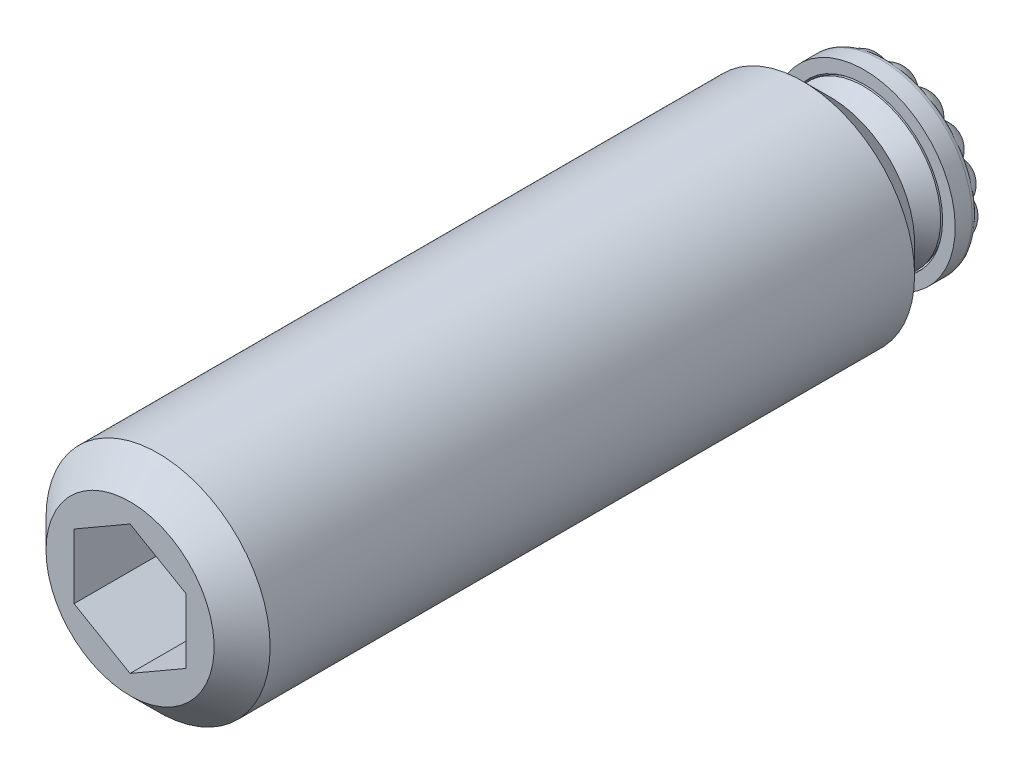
ISO-10303-21;
HEADER;
FILE_DESCRIPTION(('STEP AP214'),'2;1');
FILE_NAME('part.step','',(''),(''),'','','');
FILE_SCHEMA(('AUTOMOTIVE_DESIGN { 1 0 10303 214 1 1 1 1 }'));
ENDSEC;
DATA;
#1=APPLICATION_CONTEXT('core data for automotive mechanical design processes');
#2=APPLICATION_PROTOCOL_DEFINITION('international standard','automotive_design',2000,#1);
#3=PRODUCT_CONTEXT('',#1,'mechanical');
#4=PRODUCT('Part','Part','',(#3));
#5=PRODUCT_RELATED_PRODUCT_CATEGORY('part','',(#4));
#6=PRODUCT_DEFINITION_FORMATION('','',#4);
#7=PRODUCT_DEFINITION_CONTEXT('part definition',#1,'design');
#8=PRODUCT_DEFINITION('design','',#6,#7);
#9=PRODUCT_DEFINITION_SHAPE('','',#8);
#10=(LENGTH_UNIT() NAMED_UNIT(*) SI_UNIT(.MILLI.,.METRE.));
#11=(NAMED_UNIT(*) PLANE_ANGLE_UNIT() SI_UNIT($,.RADIAN.));
#12=(NAMED_UNIT(*) SI_UNIT($,.STERADIAN.) SOLID_ANGLE_UNIT());
#13=UNCERTAINTY_MEASURE_WITH_UNIT(LENGTH_MEASURE(1.E-05),#10,'distance_accuracy_value','');
#14=(GEOMETRIC_REPRESENTATION_CONTEXT(3) GLOBAL_UNCERTAINTY_ASSIGNED_CONTEXT((#13)) GLOBAL_UNIT_ASSIGNED_CONTEXT((#10,
#11,#12)) REPRESENTATION_CONTEXT('',''));
#15=CARTESIAN_POINT('',(0.,0.,0.));
#16=DIRECTION('',(0.,0.,1.));
#17=DIRECTION('',(1.,0.,0.));
#18=AXIS2_PLACEMENT_3D('',#15,#16,#17);
#19=CARTESIAN_POINT('',(0.,0.,5.));
#20=DIRECTION('',(0.,0.,-1.));
#21=DIRECTION('',(-1.,0.,0.));
#22=AXIS2_PLACEMENT_3D('',#19,#20,#21);
#23=PLANE('',#22);
#24=CARTESIAN_POINT('',(0.,0.,5.));
#25=DIRECTION('',(0.,0.,-1.));
#26=DIRECTION('',(-1.,0.,0.));
#27=AXIS2_PLACEMENT_3D('',#24,#25,#26);
#28=CIRCLE('',#27,6.);
#29=CARTESIAN_POINT('',(-6.,0.,5.));
#30=VERTEX_POINT('',#29);
#31=EDGE_CURVE('E85',#30,#30,#28,.T.);
#32=ORIENTED_EDGE('',*,*,#31,.T.);
#33=EDGE_LOOP('',(#32));
#34=FACE_BOUND('',#33,.T.);
#35=CARTESIAN_POINT('',(0.,0.,5.));
#36=DIRECTION('',(0.,0.,-1.));
#37=DIRECTION('',(-1.,0.,0.));
#38=AXIS2_PLACEMENT_3D('',#35,#36,#37);
#39=CIRCLE('',#38,4.);
#40=CARTESIAN_POINT('',(-4.,0.,5.));
#41=VERTEX_POINT('',#40);
#42=EDGE_CURVE('E9',#41,#41,#39,.T.);
#43=ORIENTED_EDGE('',*,*,#42,.F.);
#44=EDGE_LOOP('',(#43));
#45=FACE_BOUND('',#44,.T.);
#46=ADVANCED_FACE('F14',(#34,#45),#23,.T.);
#47=CARTESIAN_POINT('',(0.,0.,55.));
#48=DIRECTION('',(0.,0.,-1.));
#49=DIRECTION('',(-1.,0.,0.));
#50=AXIS2_PLACEMENT_3D('',#47,#48,#49);
#51=CYLINDRICAL_SURFACE('',#50,8.);
#52=CARTESIAN_POINT('',(0.,0.,7.));
#53=DIRECTION('',(0.,0.,-1.));
#54=DIRECTION('',(-1.,0.,0.));
#55=AXIS2_PLACEMENT_3D('',#52,#53,#54);
#56=CIRCLE('',#55,8.);
#57=CARTESIAN_POINT('',(-8.,0.,7.));
#58=VERTEX_POINT('',#57);
#59=EDGE_CURVE('E127',#58,#58,#56,.F.);
#60=ORIENTED_EDGE('',*,*,#59,.T.);
#61=EDGE_LOOP('',(#60));
#62=FACE_BOUND('',#61,.T.);
#63=CARTESIAN_POINT('',(0.,0.,53.));
#64=DIRECTION('',(0.,0.,-1.));
#65=DIRECTION('',(-1.,0.,0.));
#66=AXIS2_PLACEMENT_3D('',#63,#64,#65);
#67=CIRCLE('',#66,8.);
#68=CARTESIAN_POINT('',(-8.,0.,53.));
#69=VERTEX_POINT('',#68);
#70=EDGE_CURVE('E125',#69,#69,#67,.T.);
#71=ORIENTED_EDGE('',*,*,#70,.T.);
#72=EDGE_LOOP('',(#71));
#73=FACE_BOUND('',#72,.T.);
#74=ADVANCED_FACE('F988',(#62,#73),#51,.T.);
#75=CARTESIAN_POINT('',(0.,0.,55.));
#76=DIRECTION('',(0.,0.,-1.));
#77=DIRECTION('',(-1.,0.,0.));
#78=AXIS2_PLACEMENT_3D('',#75,#76,#77);
#79=PLANE('',#78);
#80=CARTESIAN_POINT('',(0.,0.,55.));
#81=DIRECTION('',(0.,0.,-1.));
#82=DIRECTION('',(-1.,0.,0.));
#83=AXIS2_PLACEMENT_3D('',#80,#81,#82);
#84=CIRCLE('',#83,6.);
#85=CARTESIAN_POINT('',(-6.,0.,55.));
#86=VERTEX_POINT('',#85);
#87=EDGE_CURVE('E18',#86,#86,#84,.F.);
#88=ORIENTED_EDGE('',*,*,#87,.T.);
#89=EDGE_LOOP('',(#88));
#90=FACE_BOUND('',#89,.T.);
#91=DIRECTION('',(-0.866025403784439,-0.5,0.));
#92=VECTOR('',#91,1.);
#93=CARTESIAN_POINT('',(0.,4.61880215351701,55.));
#94=LINE('',#93,#92);
#95=CARTESIAN_POINT('',(0.,4.61880215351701,55.));
#96=VERTEX_POINT('',#95);
#97=CARTESIAN_POINT('',(-4.,2.30940107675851,55.));
#98=VERTEX_POINT('',#97);
#99=EDGE_CURVE('E100',#96,#98,#94,.T.);
#100=ORIENTED_EDGE('',*,*,#99,.F.);
#101=DIRECTION('',(-0.866025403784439,0.5,0.));
#102=VECTOR('',#101,1.);
#103=CARTESIAN_POINT('',(4.,2.30940107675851,55.));
#104=LINE('',#103,#102);
#105=CARTESIAN_POINT('',(4.,2.30940107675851,55.));
#106=VERTEX_POINT('',#105);
#107=EDGE_CURVE('E78',#106,#96,#104,.T.);
#108=ORIENTED_EDGE('',*,*,#107,.F.);
#109=DIRECTION('',(0.,1.,0.));
#110=VECTOR('',#109,1.);
#111=CARTESIAN_POINT('',(4.,-2.3094010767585,55.));
#112=LINE('',#111,#110);
#113=CARTESIAN_POINT('',(4.,-2.3094010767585,55.));
#114=VERTEX_POINT('',#113);
#115=EDGE_CURVE('E89',#114,#106,#112,.T.);
#116=ORIENTED_EDGE('',*,*,#115,.F.);
#117=DIRECTION('',(0.866025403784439,0.5,0.));
#118=VECTOR('',#117,1.);
#119=CARTESIAN_POINT('',(0.,-4.61880215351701,55.));
#120=LINE('',#119,#118);
#121=CARTESIAN_POINT('',(0.,-4.61880215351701,55.));
#122=VERTEX_POINT('',#121);
#123=EDGE_CURVE('E94',#122,#114,#120,.T.);
#124=ORIENTED_EDGE('',*,*,#123,.F.);
#125=DIRECTION('',(0.866025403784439,-0.5,0.));
#126=VECTOR('',#125,1.);
#127=CARTESIAN_POINT('',(-4.,-2.30940107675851,55.));
#128=LINE('',#127,#126);
#129=CARTESIAN_POINT('',(-4.,-2.30940107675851,55.));
#130=VERTEX_POINT('',#129);
#131=EDGE_CURVE('E110',#130,#122,#128,.T.);
#132=ORIENTED_EDGE('',*,*,#131,.F.);
#133=DIRECTION('',(0.,-1.,0.));
#134=VECTOR('',#133,1.);
#135=CARTESIAN_POINT('',(-4.,2.30940107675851,55.));
#136=LINE('',#135,#134);
#137=EDGE_CURVE('E102',#98,#130,#136,.T.);
#138=ORIENTED_EDGE('',*,*,#137,.F.);
#139=EDGE_LOOP('',(#100,#108,#116,#124,#132,#138));
#140=FACE_BOUND('',#139,.T.);
#141=ADVANCED_FACE('F97',(#90,#140),#79,.F.);
#142=CARTESIAN_POINT('',(4.,2.30940107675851,45.4));
#143=DIRECTION('',(0.5,0.866025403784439,0.));
#144=DIRECTION('',(0.866025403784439,-0.5,0.));
#145=AXIS2_PLACEMENT_3D('',#142,#143,#144);
#146=PLANE('',#145);
#147=ORIENTED_EDGE('',*,*,#107,.T.);
#148=DIRECTION('',(0.,0.,1.));
#149=VECTOR('',#148,1.);
#150=CARTESIAN_POINT('',(0.,4.61880215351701,45.4));
#151=LINE('',#150,#149);
#152=CARTESIAN_POINT('',(0.,4.61880215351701,45.4));
#153=VERTEX_POINT('',#152);
#154=EDGE_CURVE('E121',#153,#96,#151,.T.);
#155=ORIENTED_EDGE('',*,*,#154,.F.);
#156=DIRECTION('',(-0.866025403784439,0.5,0.));
#157=VECTOR('',#156,1.);
#158=CARTESIAN_POINT('',(4.,2.30940107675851,45.4));
#159=LINE('',#158,#157);
#160=CARTESIAN_POINT('',(4.,2.30940107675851,45.4));
#161=VERTEX_POINT('',#160);
#162=EDGE_CURVE('E81',#161,#153,#159,.T.);
#163=ORIENTED_EDGE('',*,*,#162,.F.);
#164=DIRECTION('',(0.,0.,1.));
#165=VECTOR('',#164,1.);
#166=CARTESIAN_POINT('',(4.,2.30940107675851,45.4));
#167=LINE('',#166,#165);
#168=EDGE_CURVE('E74',#161,#106,#167,.T.);
#169=ORIENTED_EDGE('',*,*,#168,.T.);
#170=EDGE_LOOP('',(#147,#155,#163,#169));
#171=FACE_BOUND('',#170,.T.);
#172=ADVANCED_FACE('F76',(#171),#146,.F.);
#173=CARTESIAN_POINT('',(4.,-2.3094010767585,45.4));
#174=DIRECTION('',(1.,0.,0.));
#175=DIRECTION('',(0.,0.,-1.));
#176=AXIS2_PLACEMENT_3D('',#173,#174,#175);
#177=PLANE('',#176);
#178=ORIENTED_EDGE('',*,*,#115,.T.);
#179=ORIENTED_EDGE('',*,*,#168,.F.);
#180=DIRECTION('',(0.,1.,0.));
#181=VECTOR('',#180,1.);
#182=CARTESIAN_POINT('',(4.,-2.3094010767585,45.4));
#183=LINE('',#182,#181);
#184=CARTESIAN_POINT('',(4.,-2.3094010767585,45.4));
#185=VERTEX_POINT('',#184);
#186=EDGE_CURVE('E105',#185,#161,#183,.T.);
#187=ORIENTED_EDGE('',*,*,#186,.F.);
#188=DIRECTION('',(0.,0.,1.));
#189=VECTOR('',#188,1.);
#190=CARTESIAN_POINT('',(4.,-2.3094010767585,45.4));
#191=LINE('',#190,#189);
#192=EDGE_CURVE('E86',#185,#114,#191,.T.);
#193=ORIENTED_EDGE('',*,*,#192,.T.);
#194=EDGE_LOOP('',(#178,#179,#187,#193));
#195=FACE_BOUND('',#194,.T.);
#196=ADVANCED_FACE('F90',(#195),#177,.F.);
#197=CARTESIAN_POINT('',(0.,-4.61880215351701,45.4));
#198=DIRECTION('',(0.5,-0.866025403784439,0.));
#199=DIRECTION('',(-0.866025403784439,-0.5,0.));
#200=AXIS2_PLACEMENT_3D('',#197,#198,#199);
#201=PLANE('',#200);
#202=ORIENTED_EDGE('',*,*,#123,.T.);
#203=ORIENTED_EDGE('',*,*,#192,.F.);
#204=DIRECTION('',(0.866025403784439,0.5,0.));
#205=VECTOR('',#204,1.);
#206=CARTESIAN_POINT('',(0.,-4.61880215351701,45.4));
#207=LINE('',#206,#205);
#208=CARTESIAN_POINT('',(0.,-4.61880215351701,45.4));
#209=VERTEX_POINT('',#208);
#210=EDGE_CURVE('E954',#209,#185,#207,.T.);
#211=ORIENTED_EDGE('',*,*,#210,.F.);
#212=DIRECTION('',(0.,0.,1.));
#213=VECTOR('',#212,1.);
#214=CARTESIAN_POINT('',(0.,-4.61880215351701,45.4));
#215=LINE('',#214,#213);
#216=EDGE_CURVE('E115',#209,#122,#215,.T.);
#217=ORIENTED_EDGE('',*,*,#216,.T.);
#218=EDGE_LOOP('',(#202,#203,#211,#217));
#219=FACE_BOUND('',#218,.T.);
#220=ADVANCED_FACE('F970',(#219),#201,.F.);
#221=CARTESIAN_POINT('',(-4.,-2.30940107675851,45.4));
#222=DIRECTION('',(-0.5,-0.866025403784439,0.));
#223=DIRECTION('',(-0.866025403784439,0.5,0.));
#224=AXIS2_PLACEMENT_3D('',#221,#222,#223);
#225=PLANE('',#224);
#226=ORIENTED_EDGE('',*,*,#131,.T.);
#227=ORIENTED_EDGE('',*,*,#216,.F.);
#228=DIRECTION('',(0.866025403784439,-0.5,0.));
#229=VECTOR('',#228,1.);
#230=CARTESIAN_POINT('',(-4.,-2.30940107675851,45.4));
#231=LINE('',#230,#229);
#232=CARTESIAN_POINT('',(-4.,-2.30940107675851,45.4));
#233=VERTEX_POINT('',#232);
#234=EDGE_CURVE('E952',#233,#209,#231,.T.);
#235=ORIENTED_EDGE('',*,*,#234,.F.);
#236=DIRECTION('',(0.,0.,1.));
#237=VECTOR('',#236,1.);
#238=CARTESIAN_POINT('',(-4.,-2.30940107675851,45.4));
#239=LINE('',#238,#237);
#240=EDGE_CURVE('E117',#233,#130,#239,.T.);
#241=ORIENTED_EDGE('',*,*,#240,.T.);
#242=EDGE_LOOP('',(#226,#227,#235,#241));
#243=FACE_BOUND('',#242,.T.);
#244=ADVANCED_FACE('F968',(#243),#225,.F.);
#245=CARTESIAN_POINT('',(-4.,2.30940107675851,45.4));
#246=DIRECTION('',(-1.,0.,0.));
#247=DIRECTION('',(0.,1.,0.));
#248=AXIS2_PLACEMENT_3D('',#245,#246,#247);
#249=PLANE('',#248);
#250=ORIENTED_EDGE('',*,*,#137,.T.);
#251=ORIENTED_EDGE('',*,*,#240,.F.);
#252=DIRECTION('',(0.,-1.,0.));
#253=VECTOR('',#252,1.);
#254=CARTESIAN_POINT('',(-4.,2.30940107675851,45.4));
#255=LINE('',#254,#253);
#256=CARTESIAN_POINT('',(-4.,2.30940107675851,45.4));
#257=VERTEX_POINT('',#256);
#258=EDGE_CURVE('E949',#257,#233,#255,.T.);
#259=ORIENTED_EDGE('',*,*,#258,.F.);
#260=DIRECTION('',(0.,0.,1.));
#261=VECTOR('',#260,1.);
#262=CARTESIAN_POINT('',(-4.,2.30940107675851,45.4));
#263=LINE('',#262,#261);
#264=EDGE_CURVE('E119',#257,#98,#263,.T.);
#265=ORIENTED_EDGE('',*,*,#264,.T.);
#266=EDGE_LOOP('',(#250,#251,#259,#265));
#267=FACE_BOUND('',#266,.T.);
#268=ADVANCED_FACE('F964',(#267),#249,.F.);
#269=CARTESIAN_POINT('',(0.,4.61880215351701,45.4));
#270=DIRECTION('',(-0.5,0.866025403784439,0.));
#271=DIRECTION('',(0.866025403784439,0.5,0.));
#272=AXIS2_PLACEMENT_3D('',#269,#270,#271);
#273=PLANE('',#272);
#274=ORIENTED_EDGE('',*,*,#99,.T.);
#275=ORIENTED_EDGE('',*,*,#264,.F.);
#276=DIRECTION('',(-0.866025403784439,-0.5,0.));
#277=VECTOR('',#276,1.);
#278=CARTESIAN_POINT('',(0.,4.61880215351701,45.4));
#279=LINE('',#278,#277);
#280=EDGE_CURVE('E946',#153,#257,#279,.T.);
#281=ORIENTED_EDGE('',*,*,#280,.F.);
#282=ORIENTED_EDGE('',*,*,#154,.T.);
#283=EDGE_LOOP('',(#274,#275,#281,#282));
#284=FACE_BOUND('',#283,.T.);
#285=ADVANCED_FACE('F962',(#284),#273,.F.);
#286=CARTESIAN_POINT('',(0.,4.61880215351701,45.4));
#287=DIRECTION('',(0.,0.,1.));
#288=DIRECTION('',(1.,0.,0.));
#289=AXIS2_PLACEMENT_3D('',#286,#287,#288);
#290=PLANE('',#289);
#291=ORIENTED_EDGE('',*,*,#162,.T.);
#292=ORIENTED_EDGE('',*,*,#280,.T.);
#293=ORIENTED_EDGE('',*,*,#258,.T.);
#294=ORIENTED_EDGE('',*,*,#234,.T.);
#295=ORIENTED_EDGE('',*,*,#210,.T.);
#296=ORIENTED_EDGE('',*,*,#186,.T.);
#297=EDGE_LOOP('',(#291,#292,#293,#294,#295,#296));
#298=FACE_BOUND('',#297,.T.);
#299=ADVANCED_FACE('F958',(#298),#290,.T.);
#300=CARTESIAN_POINT('',(0.,0.,5.));
#301=DIRECTION('',(0.,0.,1.));
#302=DIRECTION('',(1.,0.,0.));
#303=AXIS2_PLACEMENT_3D('',#300,#301,#302);
#304=CONICAL_SURFACE('',#303,6.,0.785398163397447);
#305=ORIENTED_EDGE('',*,*,#59,.F.);
#306=EDGE_LOOP('',(#305));
#307=FACE_BOUND('',#306,.T.);
#308=ORIENTED_EDGE('',*,*,#31,.F.);
#309=EDGE_LOOP('',(#308));
#310=FACE_BOUND('',#309,.T.);
#311=ADVANCED_FACE('F994',(#307,#310),#304,.T.);
#312=CARTESIAN_POINT('',(0.,0.,53.));
#313=DIRECTION('',(0.,0.,-1.));
#314=DIRECTION('',(-1.,0.,0.));
#315=AXIS2_PLACEMENT_3D('',#312,#313,#314);
#316=CONICAL_SURFACE('',#315,8.,0.785398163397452);
#317=ORIENTED_EDGE('',*,*,#87,.F.);
#318=EDGE_LOOP('',(#317));
#319=FACE_BOUND('',#318,.T.);
#320=ORIENTED_EDGE('',*,*,#70,.F.);
#321=EDGE_LOOP('',(#320));
#322=FACE_BOUND('',#321,.T.);
#323=ADVANCED_FACE('F16',(#319,#322),#316,.T.);
#324=CARTESIAN_POINT('',(0.,0.,4.2414702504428));
#325=DIRECTION('',(0.,0.,-1.));
#326=DIRECTION('',(-0.965048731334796,-0.262070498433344,0.));
#327=AXIS2_PLACEMENT_3D('',#324,#325,#326);
#328=TOROIDAL_SURFACE('',#327,4.254,0.254);
#329=CARTESIAN_POINT('',(0.,0.,4.2414702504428));
#330=DIRECTION('',(0.,0.,-1.));
#331=DIRECTION('',(-0.965048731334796,-0.262070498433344,0.));
#332=AXIS2_PLACEMENT_3D('',#329,#330,#331);
#333=CIRCLE('',#332,4.);
#334=CARTESIAN_POINT('',(-3.86019492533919,-1.04828199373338,4.2414702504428));
#335=VERTEX_POINT('',#334);
#336=EDGE_CURVE('E1015',#335,#335,#333,.F.);
#337=ORIENTED_EDGE('',*,*,#336,.F.);
#338=EDGE_LOOP('',(#337));
#339=FACE_BOUND('',#338,.T.);
#340=CARTESIAN_POINT('',(0.,0.,4.06186512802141));
#341=DIRECTION('',(0.,0.,-1.));
#342=DIRECTION('',(-0.965048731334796,-0.262070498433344,0.));
#343=AXIS2_PLACEMENT_3D('',#340,#341,#342);
#344=CIRCLE('',#343,4.07439487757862);
#345=CARTESIAN_POINT('',(-3.93198960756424,-1.06777869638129,4.06186512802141));
#346=VERTEX_POINT('',#345);
#347=EDGE_CURVE('E24',#346,#346,#344,.T.);
#348=ORIENTED_EDGE('',*,*,#347,.F.);
#349=EDGE_LOOP('',(#348));
#350=FACE_BOUND('',#349,.T.);
#351=ADVANCED_FACE('F1001',(#339,#350),#328,.F.);
#352=CARTESIAN_POINT('',(0.,0.,2.0012600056));
#353=DIRECTION('',(0.,0.,-1.));
#354=DIRECTION('',(-0.965048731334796,-0.262070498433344,0.));
#355=AXIS2_PLACEMENT_3D('',#352,#353,#354);
#356=CYLINDRICAL_SURFACE('',#355,4.);
#357=ORIENTED_EDGE('',*,*,#42,.T.);
#358=EDGE_LOOP('',(#357));
#359=FACE_BOUND('',#358,.T.);
#360=ORIENTED_EDGE('',*,*,#336,.T.);
#361=EDGE_LOOP('',(#360));
#362=FACE_BOUND('',#361,.T.);
#363=ADVANCED_FACE('F1008',(#359,#362),#356,.T.);
#364=CARTESIAN_POINT('',(0.,0.,4.1362600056));
#365=DIRECTION('',(0.,0.,-1.));
#366=DIRECTION('',(-0.965048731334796,-0.262070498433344,0.));
#367=AXIS2_PLACEMENT_3D('',#364,#365,#366);
#368=CONICAL_SURFACE('',#367,4.,0.78539816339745);
#369=ORIENTED_EDGE('',*,*,#347,.T.);
#370=EDGE_LOOP('',(#369));
#371=FACE_BOUND('',#370,.T.);
#372=CARTESIAN_POINT('',(0.,0.,2.6362600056));
#373=DIRECTION('',(0.,0.,-1.));
#374=DIRECTION('',(-0.965048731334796,-0.262070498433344,0.));
#375=AXIS2_PLACEMENT_3D('',#372,#373,#374);
#376=CIRCLE('',#375,5.5);
#377=CARTESIAN_POINT('',(-5.30776802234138,-1.44138774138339,2.6362600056));
#378=VERTEX_POINT('',#377);
#379=EDGE_CURVE('E944',#378,#378,#376,.T.);
#380=ORIENTED_EDGE('',*,*,#379,.F.);
#381=EDGE_LOOP('',(#380));
#382=FACE_BOUND('',#381,.T.);
#383=ADVANCED_FACE('F1011',(#371,#382),#368,.T.);
#384=CARTESIAN_POINT('',(0.,0.,2.6362600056));
#385=DIRECTION('',(0.,0.,1.));
#386=DIRECTION('',(0.965048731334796,0.262070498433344,0.));
#387=AXIS2_PLACEMENT_3D('',#384,#385,#386);
#388=TOROIDAL_SURFACE('',#387,4.865,0.635);
#389=ORIENTED_EDGE('',*,*,#379,.T.);
#390=EDGE_LOOP('',(#389));
#391=FACE_BOUND('',#390,.T.);
#392=CARTESIAN_POINT('',(0.,0.,2.0012600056));
#393=DIRECTION('',(0.,0.,1.));
#394=DIRECTION('',(0.965048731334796,0.262070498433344,0.));
#395=AXIS2_PLACEMENT_3D('',#392,#393,#394);
#396=CIRCLE('',#395,4.865);
#397=CARTESIAN_POINT('',(4.69496207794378,1.27497297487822,2.0012600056));
#398=VERTEX_POINT('',#397);
#399=EDGE_CURVE('E1017',#398,#398,#396,.F.);
#400=ORIENTED_EDGE('',*,*,#399,.F.);
#401=EDGE_LOOP('',(#400));
#402=FACE_BOUND('',#401,.T.);
#403=ADVANCED_FACE('F992',(#391,#402),#388,.T.);
#404=CARTESIAN_POINT('',(0.,0.,3.1762600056));
#405=DIRECTION('',(0.,0.,1.));
#406=DIRECTION('',(0.965048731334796,0.262070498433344,0.));
#407=AXIS2_PLACEMENT_3D('',#404,#405,#406);
#408=SPHERICAL_SURFACE('',#407,3.175);
#409=CARTESIAN_POINT('',(-0.665659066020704,2.45122377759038,1.9062600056));
#410=DIRECTION('',(0.234402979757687,-0.863165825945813,0.447213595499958));
#411=DIRECTION('',(0.117201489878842,-0.431582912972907,-0.894427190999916));
#412=AXIS2_PLACEMENT_3D('',#409,#410,#411);
#413=CIRCLE('',#412,1.41990316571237);
#414=CARTESIAN_POINT('',(-1.34217961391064,1.73701894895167,0.882367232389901));
#415=VERTEX_POINT('',#414);
#416=CARTESIAN_POINT('',(0.279193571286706,2.17732218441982,0.882367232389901));
#417=VERTEX_POINT('',#416);
#418=EDGE_CURVE('E154',#415,#417,#413,.T.);
#419=ORIENTED_EDGE('',*,*,#418,.T.);
#420=CARTESIAN_POINT('',(1.26258491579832,2.20396899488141,1.9062600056));
#421=DIRECTION('',(-0.44460247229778,-0.776098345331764,0.447213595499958));
#422=DIRECTION('',(0.867704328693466,-0.497080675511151,0.));
#423=AXIS2_PLACEMENT_3D('',#420,#421,#422);
#424=CIRCLE('',#423,1.41990316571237);
#425=CARTESIAN_POINT('',(1.73701894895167,1.34217961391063,0.882367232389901));
#426=VERTEX_POINT('',#425);
#427=EDGE_CURVE('E158',#417,#426,#424,.T.);
#428=ORIENTED_EDGE('',*,*,#427,.T.);
#429=CARTESIAN_POINT('',(2.45122377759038,0.665659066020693,1.9062600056));
#430=DIRECTION('',(-0.863165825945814,-0.234402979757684,0.447213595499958));
#431=DIRECTION('',(0.431582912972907,0.117201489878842,0.894427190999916));
#432=AXIS2_PLACEMENT_3D('',#429,#430,#431);
#433=CIRCLE('',#432,1.41990316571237);
#434=CARTESIAN_POINT('',(2.1773221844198,-0.279193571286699,0.882367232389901));
#435=VERTEX_POINT('',#434);
#436=EDGE_CURVE('E33',#426,#435,#433,.T.);
#437=ORIENTED_EDGE('',*,*,#436,.T.);
#438=CARTESIAN_POINT('',(2.20396899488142,-1.2625849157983,1.9062600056));
#439=DIRECTION('',(-0.776098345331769,0.444602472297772,0.447213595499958));
#440=DIRECTION('',(-0.497080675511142,-0.867704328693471,0.));
#441=AXIS2_PLACEMENT_3D('',#438,#439,#440);
#442=CIRCLE('',#441,1.41990316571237);
#443=CARTESIAN_POINT('',(1.34217961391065,-1.73701894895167,0.882367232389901));
#444=VERTEX_POINT('',#443);
#445=EDGE_CURVE('E132',#435,#444,#442,.T.);
#446=ORIENTED_EDGE('',*,*,#445,.T.);
#447=CARTESIAN_POINT('',(0.665659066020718,-2.45122377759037,1.9062600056));
#448=DIRECTION('',(-0.234402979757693,0.863165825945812,0.447213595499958));
#449=DIRECTION('',(0.117201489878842,-0.431582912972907,0.894427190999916));
#450=AXIS2_PLACEMENT_3D('',#447,#448,#449);
#451=CIRCLE('',#450,1.41990316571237);
#452=CARTESIAN_POINT('',(-0.279193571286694,-2.17732218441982,0.882367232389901));
#453=VERTEX_POINT('',#452);
#454=EDGE_CURVE('E136',#444,#453,#451,.T.);
#455=ORIENTED_EDGE('',*,*,#454,.T.);
#456=CARTESIAN_POINT('',(-1.26258491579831,-2.20396899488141,1.9062600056));
#457=DIRECTION('',(0.444602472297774,0.776098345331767,0.447213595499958));
#458=DIRECTION('',(-0.867704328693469,0.497080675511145,0.));
#459=AXIS2_PLACEMENT_3D('',#456,#457,#458);
#460=CIRCLE('',#459,1.41990316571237);
#461=CARTESIAN_POINT('',(-1.73701894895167,-1.34217961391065,0.882367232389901));
#462=VERTEX_POINT('',#461);
#463=EDGE_CURVE('E142',#453,#462,#460,.T.);
#464=ORIENTED_EDGE('',*,*,#463,.T.);
#465=CARTESIAN_POINT('',(-2.45122377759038,-0.665659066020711,1.9062600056));
#466=DIRECTION('',(0.863165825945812,0.23440297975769,0.447213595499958));
#467=DIRECTION('',(0.431582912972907,0.117201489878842,-0.894427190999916));
#468=AXIS2_PLACEMENT_3D('',#465,#466,#467);
#469=CIRCLE('',#468,1.41990316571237);
#470=CARTESIAN_POINT('',(-2.17732218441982,0.279193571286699,0.882367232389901));
#471=VERTEX_POINT('',#470);
#472=EDGE_CURVE('E148',#462,#471,#469,.T.);
#473=ORIENTED_EDGE('',*,*,#472,.T.);
#474=CARTESIAN_POINT('',(-2.20396899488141,1.26258491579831,1.9062600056));
#475=DIRECTION('',(0.776098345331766,-0.444602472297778,0.447213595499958));
#476=DIRECTION('',(0.497080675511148,0.867704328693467,0.));
#477=AXIS2_PLACEMENT_3D('',#474,#475,#476);
#478=CIRCLE('',#477,1.41990316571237);
#479=EDGE_CURVE('E151',#471,#415,#478,.T.);
#480=ORIENTED_EDGE('',*,*,#479,.T.);
#481=EDGE_LOOP('',(#419,#428,#437,#446,#455,#464,#473,#480));
#482=FACE_BOUND('',#481,.T.);
#483=ADVANCED_FACE('F193',(#482),#408,.T.);
#484=CARTESIAN_POINT('',(2.75496124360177,-1.57823114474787,1.5887600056));
#485=DIRECTION('',(0.,0.,-1.));
#486=DIRECTION('',(-0.867704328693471,0.497080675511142,0.));
#487=AXIS2_PLACEMENT_3D('',#484,#485,#486);
#488=SPHERICAL_SURFACE('',#487,1.5875);
#489=ORIENTED_EDGE('',*,*,#445,.F.);
#490=CARTESIAN_POINT('',(2.90949548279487,-0.373078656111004,1.5887600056));
#491=DIRECTION('',(-0.127186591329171,-0.991878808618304,0.));
#492=DIRECTION('',(0.991878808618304,-0.127186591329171,0.));
#493=AXIS2_PLACEMENT_3D('',#490,#491,#492);
#494=CIRCLE('',#493,1.02170587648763);
#495=CARTESIAN_POINT('',(3.52112857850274,-0.451507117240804,0.774120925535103));
#496=VERTEX_POINT('',#495);
#497=EDGE_CURVE('E487',#435,#496,#494,.T.);
#498=ORIENTED_EDGE('',*,*,#497,.T.);
#499=CARTESIAN_POINT('',(3.81378294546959,-1.10151763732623,1.5887600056));
#500=DIRECTION('',(0.911842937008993,0.410539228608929,0.));
#501=DIRECTION('',(-0.410539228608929,0.911842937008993,0.));
#502=AXIS2_PLACEMENT_3D('',#499,#500,#501);
#503=CIRCLE('',#502,1.08249576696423);
#504=CARTESIAN_POINT('',(3.9086071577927,-1.31213036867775,0.531193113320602));
#505=VERTEX_POINT('',#504);
#506=EDGE_CURVE('E465',#496,#505,#503,.F.);
#507=ORIENTED_EDGE('',*,*,#506,.T.);
#508=CARTESIAN_POINT('',(3.50877937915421,-2.01006998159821,1.5887600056));
#509=DIRECTION('',(0.867704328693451,-0.497080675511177,0.));
#510=DIRECTION('',(0.497080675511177,0.867704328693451,0.));
#511=AXIS2_PLACEMENT_3D('',#508,#509,#510);
#512=CIRCLE('',#511,1.32869473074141);
#513=CARTESIAN_POINT('',(3.10895160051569,-2.70800959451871,0.531193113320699));
#514=VERTEX_POINT('',#513);
#515=EDGE_CURVE('E430',#505,#514,#512,.F.);
#516=ORIENTED_EDGE('',*,*,#515,.T.);
#517=CARTESIAN_POINT('',(2.87930489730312,-2.73274308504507,1.5887600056));
#518=DIRECTION('',(0.107083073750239,-0.994250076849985,0.));
#519=DIRECTION('',(0.994250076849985,0.107083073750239,0.));
#520=AXIS2_PLACEMENT_3D('',#517,#518,#519);
#521=CIRCLE('',#520,1.08249576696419);
#522=CARTESIAN_POINT('',(2.17055015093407,-2.80907763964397,0.774120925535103));
#523=VERTEX_POINT('',#522);
#524=EDGE_CURVE('E413',#514,#523,#521,.F.);
#525=ORIENTED_EDGE('',*,*,#524,.T.);
#526=CARTESIAN_POINT('',(1.79351753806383,-2.32113043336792,1.5887600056));
#527=DIRECTION('',(0.791298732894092,0.611429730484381,0.));
#528=DIRECTION('',(-0.611429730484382,0.791298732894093,0.));
#529=AXIS2_PLACEMENT_3D('',#526,#527,#528);
#530=CIRCLE('',#529,1.02170587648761);
#531=EDGE_CURVE('E894',#523,#444,#530,.T.);
#532=ORIENTED_EDGE('',*,*,#531,.T.);
#533=EDGE_LOOP('',(#489,#498,#507,#516,#525,#532));
#534=FACE_BOUND('',#533,.T.);
#535=ADVANCED_FACE('F445',(#534),#488,.T.);
#536=CARTESIAN_POINT('',(0.832073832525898,-3.06402972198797,1.5887600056));
#537=DIRECTION('',(0.,0.,-1.));
#538=DIRECTION('',(-0.262070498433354,0.965048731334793,0.));
#539=AXIS2_PLACEMENT_3D('',#536,#537,#538);
#540=SPHERICAL_SURFACE('',#539,1.5875);
#541=ORIENTED_EDGE('',*,*,#454,.F.);
#542=ORIENTED_EDGE('',*,*,#531,.F.);
#543=CARTESIAN_POINT('',(1.91786119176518,-3.47564237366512,1.5887600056));
#544=DIRECTION('',(0.935065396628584,-0.35447525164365,0.));
#545=DIRECTION('',(0.35447525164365,0.935065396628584,0.));
#546=AXIS2_PLACEMENT_3D('',#543,#544,#545);
#547=CIRCLE('',#546,1.08249576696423);
#548=CARTESIAN_POINT('',(1.83598634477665,-3.69161890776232,0.531193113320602));
#549=VERTEX_POINT('',#548);
#550=EDGE_CURVE('E419',#523,#549,#547,.F.);
#551=ORIENTED_EDGE('',*,*,#550,.T.);
#552=CARTESIAN_POINT('',(1.05974757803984,-3.90241580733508,1.5887600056));
#553=DIRECTION('',(0.262070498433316,-0.965048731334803,0.));
#554=DIRECTION('',(0.965048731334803,0.262070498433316,0.));
#555=AXIS2_PLACEMENT_3D('',#552,#553,#554);
#556=CIRCLE('',#555,1.32869473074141);
#557=CARTESIAN_POINT('',(0.283508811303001,-4.11321270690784,0.531193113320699));
#558=VERTEX_POINT('',#557);
#559=EDGE_CURVE('E399',#549,#558,#556,.F.);
#560=ORIENTED_EDGE('',*,*,#559,.T.);
#561=CARTESIAN_POINT('',(0.103634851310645,-3.96831718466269,1.5887600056));
#562=DIRECTION('',(-0.627321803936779,-0.778760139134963,0.));
#563=DIRECTION('',(0.778760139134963,-0.627321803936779,0.));
#564=AXIS2_PLACEMENT_3D('',#561,#562,#563);
#565=CIRCLE('',#564,1.08249576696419);
#566=CARTESIAN_POINT('',(-0.451507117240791,-3.52112857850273,0.774120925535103));
#567=VERTEX_POINT('',#566);
#568=EDGE_CURVE('E369',#558,#567,#565,.F.);
#569=ORIENTED_EDGE('',*,*,#568,.T.);
#570=CARTESIAN_POINT('',(-0.373078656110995,-2.90949548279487,1.5887600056));
#571=DIRECTION('',(0.991878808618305,-0.127186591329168,0.));
#572=DIRECTION('',(0.127186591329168,0.991878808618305,0.));
#573=AXIS2_PLACEMENT_3D('',#570,#571,#572);
#574=CIRCLE('',#573,1.02170587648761);
#575=EDGE_CURVE('E892',#567,#453,#574,.T.);
#576=ORIENTED_EDGE('',*,*,#575,.T.);
#577=EDGE_LOOP('',(#541,#542,#551,#560,#569,#576));
#578=FACE_BOUND('',#577,.T.);
#579=ADVANCED_FACE('F498',(#578),#540,.T.);
#580=CARTESIAN_POINT('',(-1.57823114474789,-2.75496124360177,1.5887600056));
#581=DIRECTION('',(0.,0.,-1.));
#582=DIRECTION('',(0.497080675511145,0.867704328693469,0.));
#583=AXIS2_PLACEMENT_3D('',#580,#581,#582);
#584=SPHERICAL_SURFACE('',#583,1.5875);
#585=ORIENTED_EDGE('',*,*,#463,.F.);
#586=ORIENTED_EDGE('',*,*,#575,.F.);
#587=CARTESIAN_POINT('',(-1.10151763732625,-3.81378294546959,1.5887600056));
#588=DIRECTION('',(0.410539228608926,-0.911842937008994,0.));
#589=DIRECTION('',(0.911842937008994,0.410539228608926,0.));
#590=AXIS2_PLACEMENT_3D('',#587,#588,#589);
#591=CIRCLE('',#590,1.08249576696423);
#592=CARTESIAN_POINT('',(-1.31213036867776,-3.9086071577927,0.531193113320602));
#593=VERTEX_POINT('',#592);
#594=EDGE_CURVE('E398',#567,#593,#591,.F.);
#595=ORIENTED_EDGE('',*,*,#594,.T.);
#596=CARTESIAN_POINT('',(-2.01006998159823,-3.5087793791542,1.5887600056));
#597=DIRECTION('',(-0.497080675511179,-0.86770432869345,0.));
#598=DIRECTION('',(0.86770432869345,-0.497080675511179,0.));
#599=AXIS2_PLACEMENT_3D('',#596,#597,#598);
#600=CIRCLE('',#599,1.32869473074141);
#601=CARTESIAN_POINT('',(-2.70800959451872,-3.10895160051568,0.531193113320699));
#602=VERTEX_POINT('',#601);
#603=EDGE_CURVE('E355',#593,#602,#600,.F.);
#604=ORIENTED_EDGE('',*,*,#603,.T.);
#605=CARTESIAN_POINT('',(-2.73274308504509,-2.87930489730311,1.5887600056));
#606=DIRECTION('',(-0.994250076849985,-0.107083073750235,0.));
#607=DIRECTION('',(0.107083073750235,-0.994250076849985,0.));
#608=AXIS2_PLACEMENT_3D('',#605,#606,#607);
#609=CIRCLE('',#608,1.08249576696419);
#610=CARTESIAN_POINT('',(-2.80907763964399,-2.17055015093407,0.774120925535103));
#611=VERTEX_POINT('',#610);
#612=EDGE_CURVE('E336',#602,#611,#609,.F.);
#613=ORIENTED_EDGE('',*,*,#612,.T.);
#614=CARTESIAN_POINT('',(-2.32113043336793,-1.79351753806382,1.5887600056));
#615=DIRECTION('',(0.611429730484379,-0.791298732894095,0.));
#616=DIRECTION('',(0.791298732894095,0.611429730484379,0.));
#617=AXIS2_PLACEMENT_3D('',#614,#615,#616);
#618=CIRCLE('',#617,1.02170587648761);
#619=EDGE_CURVE('E887',#611,#462,#618,.T.);
#620=ORIENTED_EDGE('',*,*,#619,.T.);
#621=EDGE_LOOP('',(#585,#586,#595,#604,#613,#620));
#622=FACE_BOUND('',#621,.T.);
#623=ADVANCED_FACE('F378',(#622),#584,.T.);
#624=CARTESIAN_POINT('',(-3.06402972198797,-0.832073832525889,1.5887600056));
#625=DIRECTION('',(0.,0.,-1.));
#626=DIRECTION('',(0.965048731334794,0.262070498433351,0.));
#627=AXIS2_PLACEMENT_3D('',#624,#625,#626);
#628=SPHERICAL_SURFACE('',#627,1.5875);
#629=ORIENTED_EDGE('',*,*,#472,.F.);
#630=ORIENTED_EDGE('',*,*,#619,.F.);
#631=CARTESIAN_POINT('',(-3.47564237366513,-1.91786119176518,1.5887600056));
#632=DIRECTION('',(-0.354475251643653,-0.935065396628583,0.));
#633=DIRECTION('',(0.935065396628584,-0.354475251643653,0.));
#634=AXIS2_PLACEMENT_3D('',#631,#632,#633);
#635=CIRCLE('',#634,1.08249576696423);
#636=CARTESIAN_POINT('',(-3.69161890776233,-1.83598634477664,0.531193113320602));
#637=VERTEX_POINT('',#636);
#638=EDGE_CURVE('E344',#611,#637,#635,.F.);
#639=ORIENTED_EDGE('',*,*,#638,.T.);
#640=CARTESIAN_POINT('',(-3.90241580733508,-1.05974757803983,1.5887600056));
#641=DIRECTION('',(-0.965048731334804,-0.262070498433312,0.));
#642=DIRECTION('',(0.262070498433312,-0.965048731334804,0.));
#643=AXIS2_PLACEMENT_3D('',#640,#641,#642);
#644=CIRCLE('',#643,1.32869473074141);
#645=CARTESIAN_POINT('',(-4.11321270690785,-0.28350881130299,0.531193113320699));
#646=VERTEX_POINT('',#645);
#647=EDGE_CURVE('E309',#637,#646,#644,.F.);
#648=ORIENTED_EDGE('',*,*,#647,.T.);
#649=CARTESIAN_POINT('',(-3.96831718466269,-0.103634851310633,1.5887600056));
#650=DIRECTION('',(-0.77876013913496,0.627321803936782,0.));
#651=DIRECTION('',(-0.627321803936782,-0.77876013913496,0.));
#652=AXIS2_PLACEMENT_3D('',#649,#650,#651);
#653=CIRCLE('',#652,1.08249576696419);
#654=CARTESIAN_POINT('',(-3.52112857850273,0.451507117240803,0.774120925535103));
#655=VERTEX_POINT('',#654);
#656=EDGE_CURVE('E292',#646,#655,#653,.F.);
#657=ORIENTED_EDGE('',*,*,#656,.T.);
#658=CARTESIAN_POINT('',(-2.90949548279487,0.373078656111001,1.5887600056));
#659=DIRECTION('',(-0.127186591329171,-0.991878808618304,0.));
#660=DIRECTION('',(0.991878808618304,-0.127186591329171,0.));
#661=AXIS2_PLACEMENT_3D('',#658,#659,#660);
#662=CIRCLE('',#661,1.02170587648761);
#663=EDGE_CURVE('E883',#655,#471,#662,.T.);
#664=ORIENTED_EDGE('',*,*,#663,.T.);
#665=EDGE_LOOP('',(#629,#630,#639,#648,#657,#664));
#666=FACE_BOUND('',#665,.T.);
#667=ADVANCED_FACE('F324',(#666),#628,.T.);
#668=CARTESIAN_POINT('',(-2.75496124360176,1.57823114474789,1.5887600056));
#669=DIRECTION('',(0.,0.,-1.));
#670=DIRECTION('',(0.867704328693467,-0.497080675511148,0.));
#671=AXIS2_PLACEMENT_3D('',#668,#669,#670);
#672=SPHERICAL_SURFACE('',#671,1.5875);
#673=ORIENTED_EDGE('',*,*,#479,.F.);
#674=ORIENTED_EDGE('',*,*,#663,.F.);
#675=CARTESIAN_POINT('',(-3.81378294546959,1.10151763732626,1.5887600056));
#676=DIRECTION('',(-0.911842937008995,-0.410539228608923,0.));
#677=DIRECTION('',(0.410539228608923,-0.911842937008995,0.));
#678=AXIS2_PLACEMENT_3D('',#675,#676,#677);
#679=CIRCLE('',#678,1.08249576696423);
#680=CARTESIAN_POINT('',(-3.9086071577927,1.31213036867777,0.531193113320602));
#681=VERTEX_POINT('',#680);
#682=EDGE_CURVE('E298',#655,#681,#679,.F.);
#683=ORIENTED_EDGE('',*,*,#682,.T.);
#684=CARTESIAN_POINT('',(-3.5087793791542,2.01006998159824,1.5887600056));
#685=DIRECTION('',(-0.867704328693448,0.497080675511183,0.));
#686=DIRECTION('',(-0.497080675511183,-0.867704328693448,0.));
#687=AXIS2_PLACEMENT_3D('',#684,#685,#686);
#688=CIRCLE('',#687,1.32869473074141);
#689=CARTESIAN_POINT('',(-3.10895160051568,2.70800959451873,0.531193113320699));
#690=VERTEX_POINT('',#689);
#691=EDGE_CURVE('E278',#681,#690,#688,.F.);
#692=ORIENTED_EDGE('',*,*,#691,.T.);
#693=CARTESIAN_POINT('',(-2.87930489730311,2.73274308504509,1.5887600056));
#694=DIRECTION('',(-0.107083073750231,0.994250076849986,0.));
#695=DIRECTION('',(-0.994250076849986,-0.107083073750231,0.));
#696=AXIS2_PLACEMENT_3D('',#693,#694,#695);
#697=CIRCLE('',#696,1.08249576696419);
#698=CARTESIAN_POINT('',(-2.17055015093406,2.80907763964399,0.774120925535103));
#699=VERTEX_POINT('',#698);
#700=EDGE_CURVE('E248',#690,#699,#697,.F.);
#701=ORIENTED_EDGE('',*,*,#700,.T.);
#702=CARTESIAN_POINT('',(-1.79351753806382,2.32113043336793,1.5887600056));
#703=DIRECTION('',(-0.791298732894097,-0.611429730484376,0.));
#704=DIRECTION('',(0.611429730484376,-0.791298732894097,0.));
#705=AXIS2_PLACEMENT_3D('',#702,#703,#704);
#706=CIRCLE('',#705,1.02170587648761);
#707=EDGE_CURVE('E876',#699,#415,#706,.T.);
#708=ORIENTED_EDGE('',*,*,#707,.T.);
#709=EDGE_LOOP('',(#673,#674,#683,#692,#701,#708));
#710=FACE_BOUND('',#709,.T.);
#711=ADVANCED_FACE('F508',(#710),#672,.T.);
#712=CARTESIAN_POINT('',(-0.832073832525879,3.06402972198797,1.5887600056));
#713=DIRECTION('',(0.,0.,-1.));
#714=DIRECTION('',(0.262070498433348,-0.965048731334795,0.));
#715=AXIS2_PLACEMENT_3D('',#712,#713,#714);
#716=SPHERICAL_SURFACE('',#715,1.5875);
#717=ORIENTED_EDGE('',*,*,#418,.F.);
#718=ORIENTED_EDGE('',*,*,#707,.F.);
#719=CARTESIAN_POINT('',(-1.91786119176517,3.47564237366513,1.5887600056));
#720=DIRECTION('',(-0.935065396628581,0.354475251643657,0.));
#721=DIRECTION('',(-0.354475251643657,-0.935065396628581,0.));
#722=AXIS2_PLACEMENT_3D('',#719,#720,#721);
#723=CIRCLE('',#722,1.08249576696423);
#724=CARTESIAN_POINT('',(-1.83598634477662,3.69161890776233,0.531193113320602));
#725=VERTEX_POINT('',#724);
#726=EDGE_CURVE('E277',#699,#725,#723,.F.);
#727=ORIENTED_EDGE('',*,*,#726,.T.);
#728=CARTESIAN_POINT('',(-1.05974757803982,3.90241580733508,1.5887600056));
#729=DIRECTION('',(-0.262070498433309,0.965048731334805,0.));
#730=DIRECTION('',(-0.965048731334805,-0.262070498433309,0.));
#731=AXIS2_PLACEMENT_3D('',#728,#729,#730);
#732=CIRCLE('',#731,1.32869473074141);
#733=CARTESIAN_POINT('',(-0.283508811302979,4.11321270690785,0.531193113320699));
#734=VERTEX_POINT('',#733);
#735=EDGE_CURVE('E234',#725,#734,#732,.F.);
#736=ORIENTED_EDGE('',*,*,#735,.T.);
#737=CARTESIAN_POINT('',(-0.103634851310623,3.96831718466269,1.5887600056));
#738=DIRECTION('',(0.627321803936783,0.778760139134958,0.));
#739=DIRECTION('',(-0.778760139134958,0.627321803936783,0.));
#740=AXIS2_PLACEMENT_3D('',#737,#738,#739);
#741=CIRCLE('',#740,1.08249576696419);
#742=CARTESIAN_POINT('',(0.451507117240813,3.52112857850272,0.774120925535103));
#743=VERTEX_POINT('',#742);
#744=EDGE_CURVE('E215',#734,#743,#741,.F.);
#745=ORIENTED_EDGE('',*,*,#744,.T.);
#746=CARTESIAN_POINT('',(0.373078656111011,2.90949548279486,1.5887600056));
#747=DIRECTION('',(-0.991878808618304,0.127186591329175,0.));
#748=DIRECTION('',(-0.127186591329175,-0.991878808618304,0.));
#749=AXIS2_PLACEMENT_3D('',#746,#747,#748);
#750=CIRCLE('',#749,1.02170587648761);
#751=EDGE_CURVE('E879',#743,#417,#750,.T.);
#752=ORIENTED_EDGE('',*,*,#751,.T.);
#753=EDGE_LOOP('',(#717,#718,#727,#736,#745,#752));
#754=FACE_BOUND('',#753,.T.);
#755=ADVANCED_FACE('F257',(#754),#716,.T.);
#756=CARTESIAN_POINT('',(1.5782311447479,2.75496124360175,1.5887600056));
#757=DIRECTION('',(0.,0.,-1.));
#758=DIRECTION('',(-0.497080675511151,-0.867704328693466,0.));
#759=AXIS2_PLACEMENT_3D('',#756,#757,#758);
#760=SPHERICAL_SURFACE('',#759,1.5875);
#761=ORIENTED_EDGE('',*,*,#427,.F.);
#762=ORIENTED_EDGE('',*,*,#751,.F.);
#763=CARTESIAN_POINT('',(1.10151763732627,3.81378294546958,1.5887600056));
#764=DIRECTION('',(-0.410539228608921,0.911842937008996,0.));
#765=DIRECTION('',(-0.911842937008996,-0.410539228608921,0.));
#766=AXIS2_PLACEMENT_3D('',#763,#764,#765);
#767=CIRCLE('',#766,1.08249576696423);
#768=CARTESIAN_POINT('',(1.31213036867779,3.9086071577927,0.531193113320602));
#769=VERTEX_POINT('',#768);
#770=EDGE_CURVE('E223',#743,#769,#767,.F.);
#771=ORIENTED_EDGE('',*,*,#770,.T.);
#772=CARTESIAN_POINT('',(2.01006998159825,3.50877937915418,1.5887600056));
#773=DIRECTION('',(0.497080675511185,0.867704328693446,0.));
#774=DIRECTION('',(-0.867704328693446,0.497080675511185,0.));
#775=AXIS2_PLACEMENT_3D('',#772,#773,#774);
#776=CIRCLE('',#775,1.32869473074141);
#777=CARTESIAN_POINT('',(2.70800959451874,3.10895160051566,0.531193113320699));
#778=VERTEX_POINT('',#777);
#779=EDGE_CURVE('E1394',#769,#778,#776,.F.);
#780=ORIENTED_EDGE('',*,*,#779,.T.);
#781=CARTESIAN_POINT('',(2.7327430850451,2.87930489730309,1.5887600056));
#782=DIRECTION('',(0.994250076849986,0.107083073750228,0.));
#783=DIRECTION('',(-0.107083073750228,0.994250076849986,0.));
#784=AXIS2_PLACEMENT_3D('',#781,#782,#783);
#785=CIRCLE('',#784,1.08249576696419);
#786=CARTESIAN_POINT('',(2.80907763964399,2.17055015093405,0.774120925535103));
#787=VERTEX_POINT('',#786);
#788=EDGE_CURVE('E161',#778,#787,#785,.F.);
#789=ORIENTED_EDGE('',*,*,#788,.T.);
#790=CARTESIAN_POINT('',(2.32113043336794,1.79351753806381,1.5887600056));
#791=DIRECTION('',(-0.611429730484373,0.791298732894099,0.));
#792=DIRECTION('',(-0.791298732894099,-0.611429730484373,0.));
#793=AXIS2_PLACEMENT_3D('',#790,#791,#792);
#794=CIRCLE('',#793,1.02170587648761);
#795=EDGE_CURVE('E1397',#787,#426,#794,.T.);
#796=ORIENTED_EDGE('',*,*,#795,.T.);
#797=EDGE_LOOP('',(#761,#762,#771,#780,#789,#796));
#798=FACE_BOUND('',#797,.T.);
#799=ADVANCED_FACE('F515',(#798),#760,.T.);
#800=CARTESIAN_POINT('',(3.06402972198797,0.832073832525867,1.5887600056));
#801=DIRECTION('',(0.,0.,-1.));
#802=DIRECTION('',(-0.965048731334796,-0.262070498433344,0.));
#803=AXIS2_PLACEMENT_3D('',#800,#801,#802);
#804=SPHERICAL_SURFACE('',#803,1.5875);
#805=ORIENTED_EDGE('',*,*,#436,.F.);
#806=ORIENTED_EDGE('',*,*,#795,.F.);
#807=CARTESIAN_POINT('',(3.47564237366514,1.91786119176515,1.5887600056));
#808=DIRECTION('',(0.35447525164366,0.93506539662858,0.));
#809=DIRECTION('',(-0.93506539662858,0.35447525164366,0.));
#810=AXIS2_PLACEMENT_3D('',#807,#808,#809);
#811=CIRCLE('',#810,1.08249576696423);
#812=CARTESIAN_POINT('',(3.69161890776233,1.83598634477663,0.531193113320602));
#813=VERTEX_POINT('',#812);
#814=EDGE_CURVE('E167',#787,#813,#811,.F.);
#815=ORIENTED_EDGE('',*,*,#814,.T.);
#816=CARTESIAN_POINT('',(3.90241580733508,1.05974757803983,1.5887600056));
#817=DIRECTION('',(0.965048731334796,0.262070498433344,0.));
#818=DIRECTION('',(0.,0.,-1.));
#819=AXIS2_PLACEMENT_3D('',#816,#817,#818);
#820=CIRCLE('',#819,1.32869473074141);
#821=CARTESIAN_POINT('',(4.11321270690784,0.283508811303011,0.531193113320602));
#822=VERTEX_POINT('',#821);
#823=EDGE_CURVE('E899',#813,#822,#820,.F.);
#824=ORIENTED_EDGE('',*,*,#823,.T.);
#825=CARTESIAN_POINT('',(3.96831718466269,0.103634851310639,1.5887600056));
#826=DIRECTION('',(0.778760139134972,-0.627321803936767,0.));
#827=DIRECTION('',(0.627321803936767,0.778760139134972,0.));
#828=AXIS2_PLACEMENT_3D('',#825,#826,#827);
#829=CIRCLE('',#828,1.08249576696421);
#830=EDGE_CURVE('E457',#822,#496,#829,.F.);
#831=ORIENTED_EDGE('',*,*,#830,.T.);
#832=ORIENTED_EDGE('',*,*,#497,.F.);
#833=EDGE_LOOP('',(#805,#806,#815,#824,#831,#832));
#834=FACE_BOUND('',#833,.T.);
#835=ADVANCED_FACE('F495',(#834),#804,.T.);
#836=CARTESIAN_POINT('',(5.90513318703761,1.60360937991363,1.0012600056));
#837=DIRECTION('',(0.,0.,1.));
#838=DIRECTION('',(0.262070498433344,-0.965048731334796,0.));
#839=AXIS2_PLACEMENT_3D('',#836,#837,#838);
#840=PLANE('',#839);
#841=CARTESIAN_POINT('',(3.8872550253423,3.00364855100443,1.0012600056));
#842=DIRECTION('',(0.,0.,1.));
#843=DIRECTION('',(0.262070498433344,-0.965048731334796,0.));
#844=AXIS2_PLACEMENT_3D('',#841,#842,#843);
#845=CIRCLE('',#844,1.47478812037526);
#846=CARTESIAN_POINT('',(5.36105903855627,2.94978083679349,1.0012600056));
#847=VERTEX_POINT('',#846);
#848=CARTESIAN_POINT('',(5.31769325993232,2.64469666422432,1.0012600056));
#849=VERTEX_POINT('',#848);
#850=EDGE_CURVE('E168',#847,#849,#845,.F.);
#851=ORIENTED_EDGE('',*,*,#850,.F.);
#852=CARTESIAN_POINT('',(0.,0.,1.0012600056));
#853=DIRECTION('',(0.,0.,-1.));
#854=DIRECTION('',(-0.262070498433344,0.965048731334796,0.));
#855=AXIS2_PLACEMENT_3D('',#852,#853,#854);
#856=CIRCLE('',#855,6.119);
#857=CARTESIAN_POINT('',(5.58714531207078,2.49518902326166,1.0012600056));
#858=VERTEX_POINT('',#857);
#859=EDGE_CURVE('E640',#847,#858,#856,.T.);
#860=ORIENTED_EDGE('',*,*,#859,.T.);
#861=CARTESIAN_POINT('',(4.74080189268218,1.2874213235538,1.0012600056));
#862=DIRECTION('',(0.,0.,1.));
#863=DIRECTION('',(0.262070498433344,-0.965048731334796,0.));
#864=AXIS2_PLACEMENT_3D('',#861,#862,#863);
#865=CIRCLE('',#864,1.47478812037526);
#866=EDGE_CURVE('E479',#849,#858,#865,.F.);
#867=ORIENTED_EDGE('',*,*,#866,.F.);
#868=EDGE_LOOP('',(#851,#860,#867));
#869=FACE_BOUND('',#868,.T.);
#870=ADVANCED_FACE('F493',(#869),#840,.F.);
#871=CARTESIAN_POINT('',(4.74080189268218,1.2874213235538,1.5887600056));
#872=DIRECTION('',(0.,0.,-1.));
#873=DIRECTION('',(0.965048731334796,0.262070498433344,0.));
#874=AXIS2_PLACEMENT_3D('',#871,#872,#873);
#875=SPHERICAL_SURFACE('',#874,1.5875);
#876=CARTESIAN_POINT('',(4.31402845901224,2.14553493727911,1.5887600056));
#877=DIRECTION('',(-0.445306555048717,0.895378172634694,0.));
#878=DIRECTION('',(-0.895378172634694,-0.445306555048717,0.));
#879=AXIS2_PLACEMENT_3D('',#876,#877,#878);
#880=CIRCLE('',#879,1.26556774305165);
#881=EDGE_CURVE('E180',#849,#813,#880,.T.);
#882=ORIENTED_EDGE('',*,*,#881,.F.);
#883=ORIENTED_EDGE('',*,*,#866,.T.);
#884=CARTESIAN_POINT('',(4.98446819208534,2.84248508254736,1.3824600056));
#885=CARTESIAN_POINT('',(4.9859392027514,2.83984310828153,1.36426338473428));
#886=CARTESIAN_POINT('',(4.989286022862,2.83661994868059,1.34640413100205));
#887=CARTESIAN_POINT('',(4.99907228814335,2.82922819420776,1.3119723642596));
#888=CARTESIAN_POINT('',(5.00547646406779,2.82507066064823,1.29538762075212));
#889=CARTESIAN_POINT('',(5.02073262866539,2.81598720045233,1.26378433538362));
#890=CARTESIAN_POINT('',(5.02956955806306,2.81106607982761,1.24875691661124));
#891=CARTESIAN_POINT('',(5.04916541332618,2.80055509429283,1.22021843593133));
#892=CARTESIAN_POINT('',(5.0599304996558,2.79496310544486,1.20671246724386));
#893=CARTESIAN_POINT('',(5.09013414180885,2.77951404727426,1.17324442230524));
#894=CARTESIAN_POINT('',(5.11076483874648,2.76918914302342,1.15457439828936));
#895=CARTESIAN_POINT('',(5.15433071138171,2.74731658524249,1.12106757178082));
#896=CARTESIAN_POINT('',(5.1772703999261,2.73576653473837,1.10623848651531));
#897=CARTESIAN_POINT('',(5.23703346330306,2.70514740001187,1.07299554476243));
#898=CARTESIAN_POINT('',(5.27475158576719,2.68534662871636,1.05687029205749));
#899=CARTESIAN_POINT('',(5.35112285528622,2.64346985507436,1.03120131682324));
#900=CARTESIAN_POINT('',(5.38977782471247,2.62138909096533,1.02167170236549));
#901=CARTESIAN_POINT('',(5.4851677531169,2.56398208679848,1.00483633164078));
#902=CARTESIAN_POINT('',(5.54170593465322,2.52737251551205,1.00077512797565));
#903=CARTESIAN_POINT('',(5.6513879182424,2.44976401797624,1.00183602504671));
#904=CARTESIAN_POINT('',(5.70453240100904,2.40876597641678,1.00695627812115));
#905=CARTESIAN_POINT('',(5.82055926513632,2.31006137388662,1.02667882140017));
#906=CARTESIAN_POINT('',(5.88186156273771,2.25093558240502,1.04357988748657));
#907=CARTESIAN_POINT('',(5.96612670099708,2.15679449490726,1.07413670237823));
#908=CARTESIAN_POINT('',(5.99303545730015,2.12434953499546,1.0852507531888));
#909=CARTESIAN_POINT('',(6.04394819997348,2.05756306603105,1.10840703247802));
#910=CARTESIAN_POINT('',(6.06795362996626,2.02322251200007,1.12044879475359));
#911=CARTESIAN_POINT('',(6.10443372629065,1.96549981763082,1.13973160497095));
#912=CARTESIAN_POINT('',(6.1178848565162,1.94277256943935,1.14709804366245));
#913=CARTESIAN_POINT('',(6.14339899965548,1.89629514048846,1.16108964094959));
#914=CARTESIAN_POINT('',(6.15546104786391,1.87254426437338,1.16771428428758));
#915=CARTESIAN_POINT('',(6.17776263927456,1.82434561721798,1.17920400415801));
#916=CARTESIAN_POINT('',(6.18803287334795,1.79992015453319,1.18410058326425));
#917=CARTESIAN_POINT('',(6.20667307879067,1.74999513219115,1.19111392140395));
#918=CARTESIAN_POINT('',(6.21504810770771,1.7244986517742,1.19323815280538));
#919=CARTESIAN_POINT('',(6.22835154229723,1.67722439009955,1.19391504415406));
#920=CARTESIAN_POINT('',(6.23362376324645,1.65555068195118,1.19301313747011));
#921=CARTESIAN_POINT('',(6.24262801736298,1.61206732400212,1.18903802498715));
#922=CARTESIAN_POINT('',(6.24635770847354,1.59025751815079,1.18596153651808));
#923=CARTESIAN_POINT('',(6.25551892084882,1.52430921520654,1.17436770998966));
#924=CARTESIAN_POINT('',(6.25874787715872,1.48030497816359,1.16350993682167));
#925=CARTESIAN_POINT('',(6.26055483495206,1.39552802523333,1.14084216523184));
#926=CARTESIAN_POINT('',(6.25941115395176,1.35472536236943,1.12913422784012));
#927=CARTESIAN_POINT('',(6.25362809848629,1.27326682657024,1.10594261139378));
#928=CARTESIAN_POINT('',(6.2489866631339,1.23261105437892,1.09445906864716));
#929=CARTESIAN_POINT('',(6.23654740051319,1.15167036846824,1.07275685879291));
#930=CARTESIAN_POINT('',(6.22876550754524,1.1113846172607,1.06253214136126));
#931=CARTESIAN_POINT('',(6.2102867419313,1.03105277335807,1.04393732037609));
#932=CARTESIAN_POINT('',(6.19958953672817,0.991006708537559,1.0355674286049));
#933=CARTESIAN_POINT('',(6.16738115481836,0.884393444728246,1.01639903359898));
#934=CARTESIAN_POINT('',(6.14344003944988,0.818136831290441,1.00776390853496));
#935=CARTESIAN_POINT('',(6.08927698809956,0.687561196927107,0.999742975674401));
#936=CARTESIAN_POINT('',(6.05905666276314,0.623241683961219,1.00035479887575));
#937=CARTESIAN_POINT('',(6.0057235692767,0.520001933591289,1.01142308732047));
#938=CARTESIAN_POINT('',(5.98382539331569,0.48007143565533,1.01835879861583));
#939=CARTESIAN_POINT('',(5.93913070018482,0.402316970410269,1.03843707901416));
#940=CARTESIAN_POINT('',(5.91633587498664,0.364489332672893,1.05156842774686));
#941=CARTESIAN_POINT('',(5.87838008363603,0.303435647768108,1.08000267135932));
#942=CARTESIAN_POINT('',(5.86308065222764,0.279369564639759,1.0933117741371));
#943=CARTESIAN_POINT('',(5.8334412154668,0.233268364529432,1.12396107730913));
#944=CARTESIAN_POINT('',(5.81909983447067,0.211230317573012,1.14129533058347));
#945=CARTESIAN_POINT('',(5.79647943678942,0.176281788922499,1.17457124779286));
#946=CARTESIAN_POINT('',(5.78767479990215,0.162620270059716,1.18936225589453));
#947=CARTESIAN_POINT('',(5.77160440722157,0.137193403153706,1.22125944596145));
#948=CARTESIAN_POINT('',(5.76433701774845,0.125426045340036,1.238363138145));
#949=CARTESIAN_POINT('',(5.75342378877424,0.106809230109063,1.27064760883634));
#950=CARTESIAN_POINT('',(5.74933020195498,0.0994499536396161,1.2853810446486));
#951=CARTESIAN_POINT('',(5.74283801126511,0.0866088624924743,1.31597274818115));
#952=CARTESIAN_POINT('',(5.7404343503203,0.0811214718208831,1.33182750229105));
#953=CARTESIAN_POINT('',(5.7380436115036,0.0736736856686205,1.35936597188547));
#954=CARTESIAN_POINT('',(5.73754490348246,0.0711483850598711,1.3708574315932));
#955=CARTESIAN_POINT('',(5.73758257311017,0.0692157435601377,1.3824600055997));
#956=B_SPLINE_CURVE_WITH_KNOTS('',3,(#884,#885,#886,#887,#888,#889,#890,#891,#892,#893,#894,
#895,#896,#897,#898,#899,#900,#901,#902,#903,#904,#905,#906,#907,#908,#909,#910,#911,#912,#913,
#914,#915,#916,#917,#918,#919,#920,#921,#922,#923,#924,#925,#926,#927,#928,#929,#930,#931,#932,
#933,#934,#935,#936,#937,#938,#939,#940,#941,#942,#943,#944,#945,#946,#947,#948,#949,#950,#951,
#952,#953,#954,#955),.UNSPECIFIED.,.F.,.F.,(4,2,2,2,2,2,2,2,2,2,2,2,2,2,2,2,2,2,2,2,2,2,2,2,2,2,
2,2,2,2,2,2,2,2,2,4),(0.,0.0550902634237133,0.109559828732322,0.163699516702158,
0.218015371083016,0.306544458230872,0.395250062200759,0.531137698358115,0.667315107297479,
0.868635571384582,1.06991552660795,1.32893764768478,1.45961049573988,1.59021809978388,
1.67242614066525,1.75469093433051,1.83536744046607,1.9158260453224,1.98261638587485,
2.04950776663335,2.18528184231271,2.31256217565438,2.43991756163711,2.56663472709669,
2.69336635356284,2.90548676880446,3.11755284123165,3.25539205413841,3.39298259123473,
3.4871426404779,3.58116444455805,3.64689270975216,3.71255076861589,3.76327629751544,
3.81384937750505,3.8490944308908),.UNSPECIFIED.);
#957=CARTESIAN_POINT('',(6.08180497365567,0.673653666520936,1.0012600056));
#958=VERTEX_POINT('',#957);
#959=EDGE_CURVE('E480',#858,#958,#956,.T.);
#960=ORIENTED_EDGE('',*,*,#959,.T.);
#961=CARTESIAN_POINT('',(5.92498956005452,0.408388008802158,1.0012600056));
#962=VERTEX_POINT('',#961);
#963=EDGE_CURVE('E476',#958,#962,#865,.F.);
#964=ORIENTED_EDGE('',*,*,#963,.T.);
#965=CARTESIAN_POINT('',(4.8067032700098,0.331308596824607,1.5887600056));
#966=DIRECTION('',(0.0687632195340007,-0.997633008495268,0.));
#967=DIRECTION('',(0.997633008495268,0.0687632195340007,0.));
#968=AXIS2_PLACEMENT_3D('',#965,#966,#967);
#969=CIRCLE('',#968,1.26556774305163);
#970=EDGE_CURVE('E901',#822,#962,#969,.T.);
#971=ORIENTED_EDGE('',*,*,#970,.F.);
#972=ORIENTED_EDGE('',*,*,#823,.F.);
#973=EDGE_LOOP('',(#882,#883,#960,#964,#971,#972));
#974=FACE_BOUND('',#973,.T.);
#975=ADVANCED_FACE('F202',(#974),#875,.T.);
#976=CARTESIAN_POINT('',(4.87260464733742,-0.624804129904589,1.0012600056));
#977=DIRECTION('',(0.,0.,1.));
#978=DIRECTION('',(0.262070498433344,-0.965048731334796,0.));
#979=AXIS2_PLACEMENT_3D('',#976,#977,#978);
#980=CIRCLE('',#979,1.47478812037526);
#981=CARTESIAN_POINT('',(6.11671669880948,0.167146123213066,1.0012600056));
#982=VERTEX_POINT('',#981);
#983=EDGE_CURVE('E462',#962,#982,#980,.F.);
#984=ORIENTED_EDGE('',*,*,#983,.F.);
#985=ORIENTED_EDGE('',*,*,#963,.F.);
#986=EDGE_CURVE('E656',#958,#982,#856,.T.);
#987=ORIENTED_EDGE('',*,*,#986,.T.);
#988=EDGE_LOOP('',(#984,#985,#987));
#989=FACE_BOUND('',#988,.T.);
#990=ADVANCED_FACE('F492',(#989),#840,.F.);
#991=CARTESIAN_POINT('',(4.87260464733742,-0.624804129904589,1.5887600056));
#992=DIRECTION('',(0.,0.,-1.));
#993=DIRECTION('',(0.991878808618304,-0.127186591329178,0.));
#994=AXIS2_PLACEMENT_3D('',#991,#992,#993);
#995=SPHERICAL_SURFACE('',#994,1.5875);
#996=CARTESIAN_POINT('',(4.56760108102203,-1.53335647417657,1.5887600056));
#997=DIRECTION('',(-0.318248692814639,-0.948007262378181,0.));
#998=DIRECTION('',(0.948007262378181,-0.318248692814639,0.));
#999=AXIS2_PLACEMENT_3D('',#996,#997,#998);
#1000=CIRCLE('',#999,1.26556774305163);
#1001=CARTESIAN_POINT('',(5.63025990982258,-1.89009401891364,1.0012600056));
#1002=VERTEX_POINT('',#1001);
#1003=EDGE_CURVE('E904',#505,#1002,#1000,.T.);
#1004=ORIENTED_EDGE('',*,*,#1003,.F.);
#1005=ORIENTED_EDGE('',*,*,#506,.F.);
#1006=ORIENTED_EDGE('',*,*,#830,.F.);
#1007=ORIENTED_EDGE('',*,*,#970,.T.);
#1008=ORIENTED_EDGE('',*,*,#983,.T.);
#1009=CARTESIAN_POINT('',(5.69282009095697,0.718640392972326,1.3824600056));
#1010=CARTESIAN_POINT('',(5.69316808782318,0.71563659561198,1.36426338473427));
#1011=CARTESIAN_POINT('',(5.69502669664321,0.71137801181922,1.34640413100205));
#1012=CARTESIAN_POINT('',(5.70123932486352,0.700803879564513,1.3119723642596));
#1013=CARTESIAN_POINT('',(5.70556499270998,0.694512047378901,1.29538762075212));
#1014=CARTESIAN_POINT('',(5.71618376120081,0.680281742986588,1.26378433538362));
#1015=CARTESIAN_POINT('',(5.72246478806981,0.672353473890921,1.24875691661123));
#1016=CARTESIAN_POINT('',(5.73654661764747,0.655143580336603,1.22021843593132));
#1017=CARTESIAN_POINT('',(5.74435229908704,0.645857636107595,1.20671246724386));
#1018=CARTESIAN_POINT('',(5.766344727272,0.620026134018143,1.17324442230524));
#1019=CARTESIAN_POINT('',(5.78145383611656,0.602592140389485,1.15457439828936));
#1020=CARTESIAN_POINT('',(5.81333318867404,0.565712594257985,1.12106757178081));
#1021=CARTESIAN_POINT('',(5.83010668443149,0.5462631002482,1.10623848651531));
#1022=CARTESIAN_POINT('',(5.87360311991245,0.495104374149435,1.07299554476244));
#1023=CARTESIAN_POINT('',(5.90087269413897,0.462376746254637,1.05687029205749));
#1024=CARTESIAN_POINT('',(5.9554049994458,0.394461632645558,1.03120131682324));
#1025=CARTESIAN_POINT('',(5.98266759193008,0.359269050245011,1.02167170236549));
#1026=CARTESIAN_POINT('',(6.04882768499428,0.269727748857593,1.00483633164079));
#1027=CARTESIAN_POINT('',(6.08705227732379,0.214268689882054,1.00077512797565));
#1028=CARTESIAN_POINT('',(6.15868573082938,0.100594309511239,1.00183602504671));
#1029=CARTESIAN_POINT('',(6.19209555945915,0.0423795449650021,1.00695627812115));
#1030=CARTESIAN_POINT('',(6.26151778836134,-0.0932131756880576,1.02667882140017));
#1031=CARTESIAN_POINT('',(6.29552726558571,-0.171297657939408,1.04357988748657));
#1032=CARTESIAN_POINT('',(6.33735186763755,-0.290519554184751,1.07413670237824));
#1033=CARTESIAN_POINT('',(6.34979616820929,-0.330792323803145,1.08525075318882));
#1034=CARTESIAN_POINT('',(6.37127533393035,-0.41197843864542,1.10840703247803));
#1035=CARTESIAN_POINT('',(6.3803118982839,-0.452891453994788,1.12044879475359));
#1036=CARTESIAN_POINT('',(6.39192559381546,-0.520180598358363,1.13973160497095));
#1037=CARTESIAN_POINT('',(6.39565547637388,-0.546325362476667,1.14709804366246));
#1038=CARTESIAN_POINT('',(6.40144132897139,-0.599028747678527,1.16108964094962));
#1039=CARTESIAN_POINT('',(6.40349614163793,-0.625587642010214,1.1677142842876));
#1040=CARTESIAN_POINT('',(6.40565530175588,-0.678651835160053,1.17920400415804));
#1041=CARTESIAN_POINT('',(6.40579654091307,-0.705148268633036,1.18410058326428));
#1042=CARTESIAN_POINT('',(6.40391236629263,-0.758406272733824,1.19111392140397));
#1043=CARTESIAN_POINT('',(6.40189280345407,-0.785166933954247,1.19323815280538));
#1044=CARTESIAN_POINT('',(6.39609249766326,-0.833933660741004,1.19391504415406));
#1045=CARTESIAN_POINT('',(6.39266922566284,-0.855975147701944,1.19301313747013));
#1046=CARTESIAN_POINT('',(6.38434771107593,-0.899594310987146,1.18903802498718));
#1047=CARTESIAN_POINT('',(6.37944724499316,-0.921171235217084,1.18596153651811));
#1048=CARTESIAN_POINT('',(6.3626737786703,-0.985605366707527,1.17436770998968));
#1049=CARTESIAN_POINT('',(6.34881725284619,-1.02749564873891,1.16350993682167));
#1050=CARTESIAN_POINT('',(6.31804392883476,-1.10651083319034,1.14084216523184));
#1051=CARTESIAN_POINT('',(6.30137280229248,-1.14376991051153,1.12913422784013));
#1052=CARTESIAN_POINT('',(6.26485712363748,-1.21681470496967,1.1059426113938));
#1053=CARTESIAN_POINT('',(6.2450107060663,-1.2525995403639,1.09445906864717));
#1054=CARTESIAN_POINT('',(6.20254366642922,-1.32261868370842,1.07275685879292));
#1055=CARTESIAN_POINT('',(6.17993744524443,-1.35685986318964,1.06253214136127));
#1056=CARTESIAN_POINT('',(6.13212362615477,-1.42400529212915,1.0439373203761));
#1057=CARTESIAN_POINT('',(6.10691573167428,-1.45690938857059,1.03556742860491));
#1058=CARTESIAN_POINT('',(6.0363599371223,-1.54308158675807,1.01639903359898));
#1059=CARTESIAN_POINT('',(5.98888592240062,-1.59513284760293,1.00776390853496));
#1060=CARTESIAN_POINT('',(5.88887665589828,-1.69504170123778,0.999742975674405));
#1061=CARTESIAN_POINT('',(5.83634270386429,-1.74290036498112,1.00035479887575));
#1062=CARTESIAN_POINT('',(5.74756120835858,-1.81787176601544,1.01142308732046));
#1063=CARTESIAN_POINT('',(5.71204919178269,-1.84638266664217,1.01835879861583));
#1064=CARTESIAN_POINT('',(5.64100133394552,-1.90111450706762,1.03843707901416));
#1065=CARTESIAN_POINT('',(5.60546565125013,-1.92733948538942,1.05156842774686));
#1066=CARTESIAN_POINT('',(5.54703483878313,-1.96922068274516,1.08000267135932));
#1067=CARTESIAN_POINT('',(5.52369031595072,-1.98560000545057,1.0933117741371));
#1068=CARTESIAN_POINT('',(5.47866488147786,-2.0168494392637,1.12396107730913));
#1069=CARTESIAN_POINT('',(5.45698157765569,-2.0317217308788,1.14129533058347));
#1070=CARTESIAN_POINT('',(5.42270883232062,-2.05535350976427,1.17457124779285));
#1071=CARTESIAN_POINT('',(5.40934637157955,-2.06460571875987,1.18936225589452));
#1072=CARTESIAN_POINT('',(5.38476882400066,-2.08194720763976,1.22125944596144));
#1073=CARTESIAN_POINT('',(5.37355145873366,-2.09003771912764,1.238363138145));
#1074=CARTESIAN_POINT('',(5.35634460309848,-2.10306110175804,1.27064760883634));
#1075=CARTESIAN_POINT('',(5.34974634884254,-2.10829363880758,1.2853810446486));
#1076=CARTESIAN_POINT('',(5.33883427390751,-2.11767280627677,1.31597274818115));
#1077=CARTESIAN_POINT('',(5.33451364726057,-2.12182265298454,1.33182750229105));
#1078=CARTESIAN_POINT('',(5.32945474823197,-2.12778861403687,1.35936597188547));
#1079=CARTESIAN_POINT('',(5.32802761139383,-2.12993084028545,1.3708574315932));
#1080=CARTESIAN_POINT('',(5.32732282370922,-2.13173078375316,1.3824600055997));
#1081=B_SPLINE_CURVE_WITH_KNOTS('',3,(#1009,#1010,#1011,#1012,#1013,#1014,#1015,#1016,#1017,
#1018,#1019,#1020,#1021,#1022,#1023,#1024,#1025,#1026,#1027,#1028,#1029,#1030,#1031,#1032,#1033,
#1034,#1035,#1036,#1037,#1038,#1039,#1040,#1041,#1042,#1043,#1044,#1045,#1046,#1047,#1048,#1049,
#1050,#1051,#1052,#1053,#1054,#1055,#1056,#1057,#1058,#1059,#1060,#1061,#1062,#1063,#1064,#1065,
#1066,#1067,#1068,#1069,#1070,#1071,#1072,#1073,#1074,#1075,#1076,#1077,#1078,#1079,#1080),
.UNSPECIFIED.,.F.,.F.,(4,2,2,2,2,2,2,2,2,2,2,2,2,2,2,2,2,2,2,2,2,2,2,2,2,2,2,2,2,2,2,2,2,2,2,4),
(0.,0.0550902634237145,0.109559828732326,0.163699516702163,0.21801537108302,0.306544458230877,
0.395250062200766,0.531137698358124,0.66731510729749,0.868635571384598,1.06991552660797,
1.3289376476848,1.4596104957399,1.5902180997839,1.67242614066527,1.75469093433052,
1.83536744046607,1.91582604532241,1.98261638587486,2.04950776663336,2.18528184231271,
2.31256217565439,2.43991756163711,2.56663472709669,2.69336635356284,2.90548676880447,
3.11755284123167,3.25539205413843,3.39298259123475,3.48714264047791,3.58116444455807,
3.64689270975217,3.71255076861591,3.76327629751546,3.81384937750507,3.84909443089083),.UNSPECIFIED.);
#1082=CARTESIAN_POINT('',(5.87665123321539,-1.7050311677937,1.0012600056));
#1083=VERTEX_POINT('',#1082);
#1084=EDGE_CURVE('E469',#982,#1083,#1081,.T.);
#1085=ORIENTED_EDGE('',*,*,#1084,.T.);
#1086=EDGE_CURVE('E466',#1083,#1002,#980,.F.);
#1087=ORIENTED_EDGE('',*,*,#1086,.T.);
#1088=EDGE_LOOP('',(#1004,#1005,#1006,#1007,#1008,#1085,#1087));
#1089=FACE_BOUND('',#1088,.T.);
#1090=ADVANCED_FACE('F446',(#1089),#995,.T.);
#1091=CARTESIAN_POINT('',(4.26259751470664,-2.44190881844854,1.0012600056));
#1092=DIRECTION('',(0.,0.,1.));
#1093=DIRECTION('',(0.262070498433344,-0.965048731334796,0.));
#1094=AXIS2_PLACEMENT_3D('',#1091,#1092,#1093);
#1095=CIRCLE('',#1094,1.47478812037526);
#1096=CARTESIAN_POINT('',(5.71507341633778,-2.18634325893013,1.0012600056));
#1097=VERTEX_POINT('',#1096);
#1098=EDGE_CURVE('E458',#1002,#1097,#1095,.F.);
#1099=ORIENTED_EDGE('',*,*,#1098,.F.);
#1100=ORIENTED_EDGE('',*,*,#1086,.F.);
#1101=EDGE_CURVE('E1402',#1083,#1097,#856,.T.);
#1102=ORIENTED_EDGE('',*,*,#1101,.T.);
#1103=EDGE_LOOP('',(#1099,#1100,#1102));
#1104=FACE_BOUND('',#1103,.T.);
#1105=ADVANCED_FACE('F443',(#1104),#840,.F.);
#1106=CARTESIAN_POINT('',(4.26259751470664,-2.44190881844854,1.5887600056));
#1107=DIRECTION('',(0.,0.,-1.));
#1108=DIRECTION('',(0.867704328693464,-0.497080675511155,0.));
#1109=AXIS2_PLACEMENT_3D('',#1106,#1107,#1108);
#1110=SPHERICAL_SURFACE('',#1109,1.5875);
#1111=CARTESIAN_POINT('',(3.63312303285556,-3.16458192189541,1.5887600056));
#1112=DIRECTION('',(-0.656810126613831,-0.754056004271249,0.));
#1113=DIRECTION('',(0.75405600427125,-0.656810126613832,0.));
#1114=AXIS2_PLACEMENT_3D('',#1111,#1112,#1113);
#1115=CIRCLE('',#1114,1.26556774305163);
#1116=CARTESIAN_POINT('',(4.47837422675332,-3.90082636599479,1.0012600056));
#1117=VERTEX_POINT('',#1116);
#1118=EDGE_CURVE('E907',#514,#1117,#1115,.T.);
#1119=ORIENTED_EDGE('',*,*,#1118,.F.);
#1120=ORIENTED_EDGE('',*,*,#515,.F.);
#1121=ORIENTED_EDGE('',*,*,#1003,.T.);
#1122=ORIENTED_EDGE('',*,*,#1098,.T.);
#1123=CARTESIAN_POINT('',(5.53449173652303,-1.51461078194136,1.3824600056));
#1124=CARTESIAN_POINT('',(5.53366374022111,-1.51751910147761,1.36426338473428));
#1125=CARTESIAN_POINT('',(5.53375118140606,-1.5221647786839,1.34640413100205));
#1126=CARTESIAN_POINT('',(5.53544435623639,-1.53431147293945,1.3119723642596));
#1127=CARTESIAN_POINT('',(5.53703297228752,-1.54177972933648,1.29538762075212));
#1128=CARTESIAN_POINT('',(5.54139773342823,-1.55899044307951,1.26378433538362));
#1129=CARTESIAN_POINT('',(5.5441666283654,-1.56871885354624,1.24875691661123));
#1130=CARTESIAN_POINT('',(5.55059060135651,-1.59000760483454,1.22021843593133));
#1131=CARTESIAN_POINT('',(5.55424853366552,-1.601573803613,1.20671246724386));
#1132=CARTESIAN_POINT('',(5.5646816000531,-1.63385513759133,1.17324442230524));
#1133=CARTESIAN_POINT('',(5.57196889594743,-1.6557440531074,1.15457439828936));
#1134=CARTESIAN_POINT('',(5.58730838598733,-1.70201601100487,1.12106757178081));
#1135=CARTESIAN_POINT('',(5.59536207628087,-1.72640393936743,1.10623848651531));
#1136=CARTESIAN_POINT('',(5.61596994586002,-1.79031380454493,1.07299554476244));
#1137=CARTESIAN_POINT('',(5.62863942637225,-1.83098580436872,1.05687029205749));
#1138=CARTESIAN_POINT('',(5.6530307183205,-1.91459979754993,1.03120131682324));
#1139=CARTESIAN_POINT('',(5.66475045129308,-1.95754644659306,1.02167170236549));
#1140=CARTESIAN_POINT('',(5.69160843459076,-2.06559019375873,1.00483633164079));
#1141=CARTESIAN_POINT('',(5.7057000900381,-2.13145560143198,1.00077512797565));
#1142=CARTESIAN_POINT('',(5.72837946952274,-2.26388997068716,1.00183602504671));
#1143=CARTESIAN_POINT('',(5.73696830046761,-2.33045878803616,1.00695627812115));
#1144=CARTESIAN_POINT('',(5.74921698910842,-2.48229686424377,1.02667882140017));
#1145=CARTESIAN_POINT('',(5.75075601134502,-2.5674523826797,1.04357988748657));
#1146=CARTESIAN_POINT('',(5.7437726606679,-2.69360463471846,1.07413670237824));
#1147=CARTESIAN_POINT('',(5.73985797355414,-2.73557404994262,1.08525075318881));
#1148=CARTESIAN_POINT('',(5.72863355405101,-2.81879996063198,1.10840703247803));
#1149=CARTESIAN_POINT('',(5.72132551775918,-2.86005680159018,1.12044879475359));
#1150=CARTESIAN_POINT('',(5.70630473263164,-2.92666823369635,1.13973160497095));
#1151=CARTESIAN_POINT('',(5.69974552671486,-2.95225021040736,1.14709804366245));
#1152=CARTESIAN_POINT('',(5.68492224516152,-3.00315593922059,1.1610896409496));
#1153=CARTESIAN_POINT('',(5.67665699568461,-3.02847950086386,1.16771428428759));
#1154=CARTESIAN_POINT('',(5.65834501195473,-3.07833069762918,1.17920400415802));
#1155=CARTESIAN_POINT('',(5.64833575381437,-3.10286426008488,1.18410058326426));
#1156=CARTESIAN_POINT('',(5.62621404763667,-3.15134719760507,1.19111392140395));
#1157=CARTESIAN_POINT('',(5.61410735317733,-3.17529797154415,1.19323815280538));
#1158=CARTESIAN_POINT('',(5.59008635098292,-3.21813287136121,1.19391504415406));
#1159=CARTESIAN_POINT('',(5.57848874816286,-3.23718652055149,1.19301313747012));
#1160=CARTESIAN_POINT('',(5.55410834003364,-3.27430086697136,1.18903802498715));
#1161=CARTESIAN_POINT('',(5.54132376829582,-3.2923600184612,1.18596153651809));
#1162=CARTESIAN_POINT('',(5.50116923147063,-3.34547046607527,1.17436770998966));
#1163=CARTESIAN_POINT('',(5.47233675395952,-3.37886937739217,1.16350993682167));
#1164=CARTESIAN_POINT('',(5.41366810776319,-3.44009344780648,1.14084216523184));
#1165=CARTESIAN_POINT('',(5.38400756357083,-3.46813658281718,1.12913422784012));
#1166=CARTESIAN_POINT('',(5.32231844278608,-3.52164722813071,1.10594261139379));
#1167=CARTESIAN_POINT('',(5.29028848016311,-3.54711320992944,1.09445906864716));
#1168=CARTESIAN_POINT('',(5.22425888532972,-3.59555103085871,1.07275685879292));
#1169=CARTESIAN_POINT('',(5.19026992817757,-3.61853472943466,1.06253214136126));
#1170=CARTESIAN_POINT('',(5.12040027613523,-3.66227146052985,1.04393732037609));
#1171=CARTESIAN_POINT('',(5.08451936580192,-3.6830242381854,1.0355674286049));
#1172=CARTESIAN_POINT('',(4.98635763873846,-3.73563643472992,1.01639903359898));
#1173=CARTESIAN_POINT('',(4.92257821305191,-3.76555801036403,1.00776390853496));
#1174=CARTESIAN_POINT('',(4.79194823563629,-3.81958986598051,0.999742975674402));
#1175=CARTESIAN_POINT('',(4.72509847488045,-3.84370163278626,1.00035479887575));
#1176=CARTESIAN_POINT('',(4.61438475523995,-3.87899096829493,1.01142308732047));
#1177=CARTESIAN_POINT('',(4.57066528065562,-3.89174174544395,1.01835879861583));
#1178=CARTESIAN_POINT('',(4.48408065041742,-3.91511853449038,1.03843707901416));
#1179=CARTESIAN_POINT('',(4.44121409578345,-3.92574833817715,1.05156842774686));
#1180=CARTESIAN_POINT('',(4.37120382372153,-3.94208101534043,1.08000267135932));
#1181=CARTESIAN_POINT('',(4.34336820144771,-3.94827997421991,1.0933117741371));
#1182=CARTESIAN_POINT('',(4.28981148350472,-3.95992019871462,1.12396107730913));
#1183=CARTESIAN_POINT('',(4.26408734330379,-3.96536256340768,1.14129533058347));
#1184=CARTESIAN_POINT('',(4.22337996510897,-3.97407986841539,1.17457124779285));
#1185=CARTESIAN_POINT('',(4.20749399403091,-3.9775142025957,1.18936225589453));
#1186=CARTESIAN_POINT('',(4.17815100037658,-3.9841302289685,1.22125944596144));
#1187=CARTESIAN_POINT('',(4.16469140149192,-3.98731218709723,1.238363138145));
#1188=CARTESIAN_POINT('',(4.14381050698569,-3.99275944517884,1.27064760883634));
#1189=CARTESIAN_POINT('',(4.13571210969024,-3.99506863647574,1.2853810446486));
#1190=CARTESIAN_POINT('',(4.1220414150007,-3.99955798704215,1.31597274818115));
#1191=CARTESIAN_POINT('',(4.11646159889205,-4.00173851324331,1.33182750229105));
#1192=CARTESIAN_POINT('',(4.10950471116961,-4.00531438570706,1.35936597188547));
#1193=CARTESIAN_POINT('',(4.10736641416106,-4.00674740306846,1.3708574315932));
#1194=CARTESIAN_POINT('',(4.10602646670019,-4.00814062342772,1.3824600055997));
#1195=B_SPLINE_CURVE_WITH_KNOTS('',3,(#1123,#1124,#1125,#1126,#1127,#1128,#1129,#1130,#1131,
#1132,#1133,#1134,#1135,#1136,#1137,#1138,#1139,#1140,#1141,#1142,#1143,#1144,#1145,#1146,#1147,
#1148,#1149,#1150,#1151,#1152,#1153,#1154,#1155,#1156,#1157,#1158,#1159,#1160,#1161,#1162,#1163,
#1164,#1165,#1166,#1167,#1168,#1169,#1170,#1171,#1172,#1173,#1174,#1175,#1176,#1177,#1178,#1179,
#1180,#1181,#1182,#1183,#1184,#1185,#1186,#1187,#1188,#1189,#1190,#1191,#1192,#1193,#1194),
.UNSPECIFIED.,.F.,.F.,(4,2,2,2,2,2,2,2,2,2,2,2,2,2,2,2,2,2,2,2,2,2,2,2,2,2,2,2,2,2,2,2,2,2,2,4),
(0.,0.0550902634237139,0.109559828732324,0.163699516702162,0.218015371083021,0.306544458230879,
0.39525006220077,0.531137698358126,0.667315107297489,0.8686355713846,1.06991552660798,
1.32893764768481,1.45961049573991,1.59021809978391,1.67242614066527,1.75469093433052,
1.83536744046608,1.91582604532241,1.98261638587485,2.04950776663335,2.1852818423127,
2.31256217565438,2.4399175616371,2.56663472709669,2.69336635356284,2.90548676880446,
3.11755284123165,3.25539205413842,3.39298259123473,3.4871426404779,3.58116444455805,
3.64689270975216,3.71255076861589,3.76327629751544,3.81384937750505,3.84909443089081),.UNSPECIFIED.);
#1196=CARTESIAN_POINT('',(4.77683061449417,-3.82414046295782,1.0012600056));
#1197=VERTEX_POINT('',#1196);
#1198=EDGE_CURVE('E450',#1097,#1197,#1195,.T.);
#1199=ORIENTED_EDGE('',*,*,#1198,.T.);
#1200=EDGE_CURVE('E459',#1197,#1117,#1095,.F.);
#1201=ORIENTED_EDGE('',*,*,#1200,.T.);
#1202=EDGE_LOOP('',(#1119,#1120,#1121,#1122,#1199,#1201));
#1203=FACE_BOUND('',#1202,.T.);
#1204=ADVANCED_FACE('F439',(#1203),#1110,.T.);
#1205=CARTESIAN_POINT('',(3.00364855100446,-3.88725502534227,1.0012600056));
#1206=DIRECTION('',(0.,0.,1.));
#1207=DIRECTION('',(0.262070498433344,-0.965048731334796,0.));
#1208=AXIS2_PLACEMENT_3D('',#1205,#1206,#1207);
#1209=CIRCLE('',#1208,1.47478812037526);
#1210=CARTESIAN_POINT('',(4.44336201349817,-4.20698169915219,1.0012600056));
#1211=VERTEX_POINT('',#1210);
#1212=EDGE_CURVE('E416',#1117,#1211,#1209,.F.);
#1213=ORIENTED_EDGE('',*,*,#1212,.F.);
#1214=ORIENTED_EDGE('',*,*,#1200,.F.);
#1215=EDGE_CURVE('E1470',#1197,#1211,#856,.T.);
#1216=ORIENTED_EDGE('',*,*,#1215,.T.);
#1217=EDGE_LOOP('',(#1213,#1214,#1216));
#1218=FACE_BOUND('',#1217,.T.);
#1219=ADVANCED_FACE('F437',(#1218),#840,.F.);
#1220=CARTESIAN_POINT('',(3.00364855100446,-3.88725502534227,1.5887600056));
#1221=DIRECTION('',(0.,0.,-1.));
#1222=DIRECTION('',(0.611429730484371,-0.791298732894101,0.));
#1223=AXIS2_PLACEMENT_3D('',#1220,#1221,#1222);
#1224=SPHERICAL_SURFACE('',#1223,1.5875);
#1225=CARTESIAN_POINT('',(2.14553493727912,-4.31402845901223,1.5887600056));
#1226=DIRECTION('',(-0.895378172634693,-0.44530655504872,0.));
#1227=DIRECTION('',(0.445306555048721,-0.895378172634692,0.));
#1228=AXIS2_PLACEMENT_3D('',#1225,#1226,#1227);
#1229=CIRCLE('',#1228,1.26556774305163);
#1230=CARTESIAN_POINT('',(2.64469666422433,-5.31769325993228,1.0012600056));
#1231=VERTEX_POINT('',#1230);
#1232=EDGE_CURVE('E910',#549,#1231,#1229,.T.);
#1233=ORIENTED_EDGE('',*,*,#1232,.F.);
#1234=ORIENTED_EDGE('',*,*,#550,.F.);
#1235=ORIENTED_EDGE('',*,*,#524,.F.);
#1236=ORIENTED_EDGE('',*,*,#1118,.T.);
#1237=ORIENTED_EDGE('',*,*,#1212,.T.);
#1238=CARTESIAN_POINT('',(4.53358718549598,-3.5172761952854,1.3824600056));
#1239=CARTESIAN_POINT('',(4.53170925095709,-3.51964627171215,1.36426338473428));
#1240=CARTESIAN_POINT('',(4.5300122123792,-3.52397178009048,1.34640413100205));
#1241=CARTESIAN_POINT('',(4.5269281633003,-3.53584181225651,1.3119723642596));
#1242=CARTESIAN_POINT('',(4.52553787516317,-3.54334951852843,1.29538762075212));
#1243=CARTESIAN_POINT('',(4.52298413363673,-3.5609204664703,1.26378433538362));
#1244=CARTESIAN_POINT('',(4.52181935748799,-3.57096795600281,1.24875691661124));
#1245=CARTESIAN_POINT('',(4.51960748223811,-3.59309454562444,1.22021843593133));
#1246=CARTESIAN_POINT('',(4.51856077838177,-3.60518015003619,1.20671246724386));
#1247=CARTESIAN_POINT('',(4.51584614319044,-3.63899677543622,1.17324442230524));
#1248=CARTESIAN_POINT('',(4.51420220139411,-3.66200822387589,1.15457439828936));
#1249=CARTESIAN_POINT('',(4.51066653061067,-3.71062810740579,1.12106757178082));
#1250=CARTESIAN_POINT('',(4.5087743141,-3.73624162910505,1.10623848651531));
#1251=CARTESIAN_POINT('',(4.50335625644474,-3.80317293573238,1.07299554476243));
#1252=CARTESIAN_POINT('',(4.49949682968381,-3.84559736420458,1.05687029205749));
#1253=CARTESIAN_POINT('',(4.49003375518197,-3.93218076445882,1.03120131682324));
#1254=CARTESIAN_POINT('',(4.48442640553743,-3.97634324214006,1.02167170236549));
#1255=CARTESIAN_POINT('',(4.46789339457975,-4.086440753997,1.00483633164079));
#1256=CARTESIAN_POINT('',(4.45570678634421,-4.15268509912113,1.00077512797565));
#1257=CARTESIAN_POINT('',(4.42597936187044,-4.28371752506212,1.00183602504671));
#1258=CARTESIAN_POINT('',(4.40843962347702,-4.34850589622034,1.00695627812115));
#1259=CARTESIAN_POINT('',(4.36165002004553,-4.49347335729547,1.02667882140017));
#1260=CARTESIAN_POINT('',(4.33048428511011,-4.5727357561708,1.04357988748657));
#1261=CARTESIAN_POINT('',(4.27575613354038,-4.68661282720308,1.07413670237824));
#1262=CARTESIAN_POINT('',(4.25607843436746,-4.72388942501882,1.08525075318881));
#1263=CARTESIAN_POINT('',(4.21385924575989,-4.79648474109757,1.10840703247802));
#1264=CARTESIAN_POINT('',(4.1913191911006,-4.83180442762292,1.12044879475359));
#1265=CARTESIAN_POINT('',(4.15195070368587,-4.88759716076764,1.13973160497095));
#1266=CARTESIAN_POINT('',(4.13610098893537,-4.9087217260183,1.14709804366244));
#1267=CARTESIAN_POINT('',(4.10292528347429,-4.95007986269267,1.16108964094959));
#1268=CARTESIAN_POINT('',(4.08559828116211,-4.970312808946,1.16771428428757));
#1269=CARTESIAN_POINT('',(4.04960298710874,-5.00936161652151,1.17920400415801));
#1270=CARTESIAN_POINT('',(4.03096705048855,-5.02819729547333,1.18410058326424));
#1271=CARTESIAN_POINT('',(3.99197564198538,-5.06452407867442,1.19111392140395));
#1272=CARTESIAN_POINT('',(3.97162495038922,-5.08201867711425,1.19323815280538));
#1273=CARTESIAN_POINT('',(3.9330402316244,-5.11240052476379,1.19391504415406));
#1274=CARTESIAN_POINT('',(3.91503392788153,-5.12556559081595,1.19301313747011));
#1275=CARTESIAN_POINT('',(3.87830632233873,-5.15052479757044,1.18903802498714));
#1276=CARTESIAN_POINT('',(3.8595839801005,-5.16231683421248,1.18596153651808));
#1277=CARTESIAN_POINT('',(3.80216153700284,-5.19601801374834,1.17436770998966));
#1278=CARTESIAN_POINT('',(3.76274259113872,-5.21584087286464,1.16350993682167));
#1279=CARTESIAN_POINT('',(3.68511039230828,-5.24995301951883,1.14084216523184));
#1280=CARTESIAN_POINT('',(3.64697597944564,-5.26451089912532,1.12913422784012));
#1281=CARTESIAN_POINT('',(3.56950502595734,-5.29034088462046,1.10594261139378));
#1282=CARTESIAN_POINT('',(3.53016778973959,-5.30161104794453,1.09445906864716));
#1283=CARTESIAN_POINT('',(3.45062804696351,-5.32109332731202,1.07275685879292));
#1284=CARTESIAN_POINT('',(3.41043086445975,-5.32932048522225,1.06253214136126));
#1285=CARTESIAN_POINT('',(3.32914240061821,-5.34298999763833,1.04393732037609));
#1286=CARTESIAN_POINT('',(3.28805101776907,-5.3484320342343,1.0355674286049));
#1287=CARTESIAN_POINT('',(3.17722759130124,-5.35947449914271,1.01639903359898));
#1288=CARTESIAN_POINT('',(3.10685259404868,-5.36271110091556,1.00776390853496));
#1289=CARTESIAN_POINT('',(2.96548913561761,-5.36264009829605,0.999742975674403));
#1290=CARTESIAN_POINT('',(2.8945008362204,-5.35933417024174,1.00035479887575));
#1291=CARTESIAN_POINT('',(2.77871005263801,-5.34956895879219,1.01142308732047));
#1292=CARTESIAN_POINT('',(2.73343901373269,-5.34461842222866,1.01835879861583));
#1293=CARTESIAN_POINT('',(2.6444993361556,-5.33308125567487,1.03843707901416));
#1294=CARTESIAN_POINT('',(2.60082795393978,-5.32649759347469,1.05156842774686));
#1295=CARTESIAN_POINT('',(2.52989665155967,-5.31479524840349,1.08000267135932));
#1296=CARTESIAN_POINT('',(2.50180765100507,-5.30987010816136,1.0933117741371));
#1297=CARTESIAN_POINT('',(2.44787317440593,-5.30012900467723,1.12396107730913));
#1298=CARTESIAN_POINT('',(2.42202446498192,-5.29531289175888,1.14129533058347));
#1299=CARTESIAN_POINT('',(2.3810797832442,-5.28778859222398,1.17457124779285));
#1300=CARTESIAN_POINT('',(2.36508879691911,-5.28488220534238,1.18936225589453));
#1301=CARTESIAN_POINT('',(2.3354475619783,-5.27976553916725,1.22125944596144));
#1302=CARTESIAN_POINT('',(2.32179483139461,-5.27755451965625,1.238363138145));
#1303=CARTESIAN_POINT('',(2.30041882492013,-5.27459635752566,1.27064760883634));
#1304=CARTESIAN_POINT('',(2.29205319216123,-5.27363064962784,1.2853810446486));
#1305=CARTESIAN_POINT('',(2.2777051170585,-5.27254672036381,1.31597274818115));
#1306=CARTESIAN_POINT('',(2.27171558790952,-5.27242596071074,1.33182750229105));
#1307=CARTESIAN_POINT('',(2.26391983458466,-5.27306735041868,1.35936597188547));
#1308=CARTESIAN_POINT('',(2.26139591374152,-5.27357299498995,1.3708574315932));
#1309=CARTESIAN_POINT('',(2.25962480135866,-5.27434738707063,1.3824600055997));
#1310=B_SPLINE_CURVE_WITH_KNOTS('',3,(#1238,#1239,#1240,#1241,#1242,#1243,#1244,#1245,#1246,
#1247,#1248,#1249,#1250,#1251,#1252,#1253,#1254,#1255,#1256,#1257,#1258,#1259,#1260,#1261,#1262,
#1263,#1264,#1265,#1266,#1267,#1268,#1269,#1270,#1271,#1272,#1273,#1274,#1275,#1276,#1277,#1278,
#1279,#1280,#1281,#1282,#1283,#1284,#1285,#1286,#1287,#1288,#1289,#1290,#1291,#1292,#1293,#1294,
#1295,#1296,#1297,#1298,#1299,#1300,#1301,#1302,#1303,#1304,#1305,#1306,#1307,#1308,#1309),
.UNSPECIFIED.,.F.,.F.,(4,2,2,2,2,2,2,2,2,2,2,2,2,2,2,2,2,2,2,2,2,2,2,2,2,2,2,2,2,2,2,2,2,2,2,4),
(0.,0.0550902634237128,0.109559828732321,0.163699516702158,0.218015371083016,0.306544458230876,
0.395250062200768,0.531137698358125,0.66731510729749,0.868635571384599,1.06991552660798,
1.3289376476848,1.45961049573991,1.5902180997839,1.67242614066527,1.75469093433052,
1.83536744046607,1.9158260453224,1.98261638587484,2.04950776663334,2.18528184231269,
2.31256217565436,2.43991756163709,2.56663472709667,2.69336635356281,2.90548676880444,
3.11755284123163,3.2553920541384,3.39298259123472,3.48714264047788,3.58116444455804,
3.64689270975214,3.71255076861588,3.76327629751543,3.81384937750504,3.84909443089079),.UNSPECIFIED.);
#1311=CARTESIAN_POINT('',(2.94978083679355,-5.36105903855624,1.0012600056));
#1312=VERTEX_POINT('',#1311);
#1313=EDGE_CURVE('E423',#1211,#1312,#1310,.T.);
#1314=ORIENTED_EDGE('',*,*,#1313,.T.);
#1315=EDGE_CURVE('E420',#1312,#1231,#1209,.F.);
#1316=ORIENTED_EDGE('',*,*,#1315,.T.);
#1317=EDGE_LOOP('',(#1233,#1234,#1235,#1236,#1237,#1314,#1316));
#1318=FACE_BOUND('',#1317,.T.);
#1319=ADVANCED_FACE('F432',(#1318),#1224,.T.);
#1320=CARTESIAN_POINT('',(1.28742132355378,-4.74080189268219,1.0012600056));
#1321=DIRECTION('',(0.,0.,1.));
#1322=DIRECTION('',(0.262070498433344,-0.965048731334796,0.));
#1323=AXIS2_PLACEMENT_3D('',#1320,#1321,#1322);
#1324=CIRCLE('',#1323,1.47478812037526);
#1325=CARTESIAN_POINT('',(2.49518902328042,-5.5871453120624,1.0012600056));
#1326=VERTEX_POINT('',#1325);
#1327=EDGE_CURVE('E402',#1231,#1326,#1324,.F.);
#1328=ORIENTED_EDGE('',*,*,#1327,.F.);
#1329=ORIENTED_EDGE('',*,*,#1315,.F.);
#1330=EDGE_CURVE('E1428',#1312,#1326,#856,.T.);
#1331=ORIENTED_EDGE('',*,*,#1330,.T.);
#1332=EDGE_LOOP('',(#1328,#1329,#1331));
#1333=FACE_BOUND('',#1332,.T.);
#1334=ADVANCED_FACE('F436',(#1333),#840,.F.);
#1335=CARTESIAN_POINT('',(1.28742132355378,-4.74080189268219,1.5887600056));
#1336=DIRECTION('',(0.,0.,-1.));
#1337=DIRECTION('',(0.26207049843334,-0.965048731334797,0.));
#1338=AXIS2_PLACEMENT_3D('',#1335,#1336,#1337);
#1339=SPHERICAL_SURFACE('',#1338,1.5875);
#1340=CARTESIAN_POINT('',(0.331308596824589,-4.80670327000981,1.5887600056));
#1341=DIRECTION('',(-0.997633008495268,-0.068763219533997,0.));
#1342=DIRECTION('',(0.068763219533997,-0.997633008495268,0.));
#1343=AXIS2_PLACEMENT_3D('',#1340,#1341,#1342);
#1344=CIRCLE('',#1343,1.26556774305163);
#1345=CARTESIAN_POINT('',(0.408388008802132,-5.92498956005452,1.0012600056));
#1346=VERTEX_POINT('',#1345);
#1347=EDGE_CURVE('E913',#558,#1346,#1344,.T.);
#1348=ORIENTED_EDGE('',*,*,#1347,.F.);
#1349=ORIENTED_EDGE('',*,*,#559,.F.);
#1350=ORIENTED_EDGE('',*,*,#1232,.T.);
#1351=ORIENTED_EDGE('',*,*,#1327,.T.);
#1352=CARTESIAN_POINT('',(2.84248508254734,-4.98446819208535,1.3824600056));
#1353=CARTESIAN_POINT('',(2.83984310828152,-4.9859392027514,1.36426338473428));
#1354=CARTESIAN_POINT('',(2.83661994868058,-4.98928602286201,1.34640413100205));
#1355=CARTESIAN_POINT('',(2.82922819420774,-4.99907228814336,1.3119723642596));
#1356=CARTESIAN_POINT('',(2.82507066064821,-5.00547646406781,1.29538762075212));
#1357=CARTESIAN_POINT('',(2.81598720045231,-5.02073262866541,1.26378433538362));
#1358=CARTESIAN_POINT('',(2.81106607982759,-5.02956955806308,1.24875691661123));
#1359=CARTESIAN_POINT('',(2.80055509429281,-5.04916541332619,1.22021843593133));
#1360=CARTESIAN_POINT('',(2.79496310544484,-5.05993049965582,1.20671246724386));
#1361=CARTESIAN_POINT('',(2.77951404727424,-5.09013414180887,1.17324442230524));
#1362=CARTESIAN_POINT('',(2.7691891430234,-5.11076483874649,1.15457439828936));
#1363=CARTESIAN_POINT('',(2.74731658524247,-5.15433071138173,1.12106757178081));
#1364=CARTESIAN_POINT('',(2.73576653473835,-5.17727039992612,1.10623848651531));
#1365=CARTESIAN_POINT('',(2.70514740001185,-5.23703346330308,1.07299554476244));
#1366=CARTESIAN_POINT('',(2.68534662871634,-5.27475158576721,1.05687029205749));
#1367=CARTESIAN_POINT('',(2.64346985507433,-5.35112285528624,1.03120131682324));
#1368=CARTESIAN_POINT('',(2.6213890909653,-5.38977782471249,1.02167170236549));
#1369=CARTESIAN_POINT('',(2.56398208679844,-5.48516775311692,1.00483633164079));
#1370=CARTESIAN_POINT('',(2.52737251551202,-5.54170593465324,1.00077512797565));
#1371=CARTESIAN_POINT('',(2.44976401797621,-5.65138791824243,1.00183602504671));
#1372=CARTESIAN_POINT('',(2.40876597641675,-5.70453240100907,1.00695627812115));
#1373=CARTESIAN_POINT('',(2.31006137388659,-5.82055926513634,1.02667882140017));
#1374=CARTESIAN_POINT('',(2.25093558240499,-5.88186156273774,1.04357988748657));
#1375=CARTESIAN_POINT('',(2.15679449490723,-5.96612670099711,1.07413670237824));
#1376=CARTESIAN_POINT('',(2.12434953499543,-5.99303545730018,1.08525075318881));
#1377=CARTESIAN_POINT('',(2.05756306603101,-6.04394819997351,1.10840703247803));
#1378=CARTESIAN_POINT('',(2.02322251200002,-6.06795362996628,1.12044879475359));
#1379=CARTESIAN_POINT('',(1.96549981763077,-6.10443372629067,1.13973160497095));
#1380=CARTESIAN_POINT('',(1.94277256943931,-6.11788485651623,1.14709804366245));
#1381=CARTESIAN_POINT('',(1.89629514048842,-6.1433989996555,1.1610896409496));
#1382=CARTESIAN_POINT('',(1.87254426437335,-6.15546104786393,1.16771428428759));
#1383=CARTESIAN_POINT('',(1.82434561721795,-6.17776263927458,1.17920400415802));
#1384=CARTESIAN_POINT('',(1.79992015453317,-6.18803287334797,1.18410058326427));
#1385=CARTESIAN_POINT('',(1.74999513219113,-6.20667307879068,1.19111392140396));
#1386=CARTESIAN_POINT('',(1.72449865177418,-6.21504810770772,1.19323815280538));
#1387=CARTESIAN_POINT('',(1.67722439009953,-6.22835154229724,1.19391504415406));
#1388=CARTESIAN_POINT('',(1.65555068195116,-6.23362376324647,1.19301313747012));
#1389=CARTESIAN_POINT('',(1.6120673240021,-6.242628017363,1.18903802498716));
#1390=CARTESIAN_POINT('',(1.59025751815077,-6.24635770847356,1.18596153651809));
#1391=CARTESIAN_POINT('',(1.52430921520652,-6.25551892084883,1.17436770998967));
#1392=CARTESIAN_POINT('',(1.48030497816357,-6.25874787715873,1.16350993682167));
#1393=CARTESIAN_POINT('',(1.39552802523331,-6.26055483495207,1.14084216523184));
#1394=CARTESIAN_POINT('',(1.35472536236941,-6.25941115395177,1.12913422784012));
#1395=CARTESIAN_POINT('',(1.27326682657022,-6.2536280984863,1.10594261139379));
#1396=CARTESIAN_POINT('',(1.23261105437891,-6.24898666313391,1.09445906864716));
#1397=CARTESIAN_POINT('',(1.15167036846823,-6.2365474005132,1.07275685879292));
#1398=CARTESIAN_POINT('',(1.11138461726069,-6.22876550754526,1.06253214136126));
#1399=CARTESIAN_POINT('',(1.03105277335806,-6.21028674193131,1.04393732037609));
#1400=CARTESIAN_POINT('',(0.991006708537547,-6.19958953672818,1.0355674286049));
#1401=CARTESIAN_POINT('',(0.884393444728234,-6.16738115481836,1.01639903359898));
#1402=CARTESIAN_POINT('',(0.818136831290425,-6.14344003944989,1.00776390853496));
#1403=CARTESIAN_POINT('',(0.687561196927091,-6.08927698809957,0.999742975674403));
#1404=CARTESIAN_POINT('',(0.623241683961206,-6.05905666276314,1.00035479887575));
#1405=CARTESIAN_POINT('',(0.520001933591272,-6.00572356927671,1.01142308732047));
#1406=CARTESIAN_POINT('',(0.480071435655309,-5.98382539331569,1.01835879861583));
#1407=CARTESIAN_POINT('',(0.40231697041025,-5.93913070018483,1.03843707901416));
#1408=CARTESIAN_POINT('',(0.364489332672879,-5.91633587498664,1.05156842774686));
#1409=CARTESIAN_POINT('',(0.303435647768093,-5.87838008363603,1.08000267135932));
#1410=CARTESIAN_POINT('',(0.27936956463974,-5.86308065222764,1.0933117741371));
#1411=CARTESIAN_POINT('',(0.233268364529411,-5.83344121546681,1.12396107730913));
#1412=CARTESIAN_POINT('',(0.211230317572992,-5.81909983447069,1.14129533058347));
#1413=CARTESIAN_POINT('',(0.176281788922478,-5.79647943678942,1.17457124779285));
#1414=CARTESIAN_POINT('',(0.162620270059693,-5.78767479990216,1.18936225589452));
#1415=CARTESIAN_POINT('',(0.137193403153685,-5.77160440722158,1.22125944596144));
#1416=CARTESIAN_POINT('',(0.125426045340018,-5.76433701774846,1.238363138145));
#1417=CARTESIAN_POINT('',(0.106809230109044,-5.75342378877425,1.27064760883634));
#1418=CARTESIAN_POINT('',(0.099449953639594,-5.74933020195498,1.2853810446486));
#1419=CARTESIAN_POINT('',(0.08660886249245,-5.74283801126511,1.31597274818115));
#1420=CARTESIAN_POINT('',(0.0811214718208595,-5.7404343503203,1.33182750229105));
#1421=CARTESIAN_POINT('',(0.0736736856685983,-5.73804361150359,1.35936597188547));
#1422=CARTESIAN_POINT('',(0.0711483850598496,-5.73754490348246,1.3708574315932));
#1423=CARTESIAN_POINT('',(0.0692157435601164,-5.73758257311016,1.3824600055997));
#1424=B_SPLINE_CURVE_WITH_KNOTS('',3,(#1352,#1353,#1354,#1355,#1356,#1357,#1358,#1359,#1360,
#1361,#1362,#1363,#1364,#1365,#1366,#1367,#1368,#1369,#1370,#1371,#1372,#1373,#1374,#1375,#1376,
#1377,#1378,#1379,#1380,#1381,#1382,#1383,#1384,#1385,#1386,#1387,#1388,#1389,#1390,#1391,#1392,
#1393,#1394,#1395,#1396,#1397,#1398,#1399,#1400,#1401,#1402,#1403,#1404,#1405,#1406,#1407,#1408,
#1409,#1410,#1411,#1412,#1413,#1414,#1415,#1416,#1417,#1418,#1419,#1420,#1421,#1422,#1423),
.UNSPECIFIED.,.F.,.F.,(4,2,2,2,2,2,2,2,2,2,2,2,2,2,2,2,2,2,2,2,2,2,2,2,2,2,2,2,2,2,2,2,2,2,2,4),
(0.,0.0550902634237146,0.109559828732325,0.163699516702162,0.21801537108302,0.306544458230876,
0.395250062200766,0.531137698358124,0.667315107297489,0.868635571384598,1.06991552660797,
1.3289376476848,1.4596104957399,1.5902180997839,1.67242614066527,1.75469093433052,
1.83536744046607,1.91582604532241,1.98261638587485,2.04950776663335,2.1852818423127,
2.31256217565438,2.43991756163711,2.56663472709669,2.69336635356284,2.90548676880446,
3.11755284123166,3.25539205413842,3.39298259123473,3.4871426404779,3.58116444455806,
3.64689270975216,3.71255076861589,3.76327629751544,3.81384937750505,3.84909443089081),.UNSPECIFIED.);
#1425=CARTESIAN_POINT('',(0.673653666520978,-6.08180497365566,1.0012600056));
#1426=VERTEX_POINT('',#1425);
#1427=EDGE_CURVE('E406',#1326,#1426,#1424,.T.);
#1428=ORIENTED_EDGE('',*,*,#1427,.T.);
#1429=EDGE_CURVE('E405',#1426,#1346,#1324,.F.);
#1430=ORIENTED_EDGE('',*,*,#1429,.T.);
#1431=EDGE_LOOP('',(#1348,#1349,#1350,#1351,#1428,#1430));
#1432=FACE_BOUND('',#1431,.T.);
#1433=ADVANCED_FACE('F385',(#1432),#1339,.T.);
#1434=CARTESIAN_POINT('',(-0.624804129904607,-4.87260464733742,1.0012600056));
#1435=DIRECTION('',(0.,0.,1.));
#1436=DIRECTION('',(0.262070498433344,-0.965048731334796,0.));
#1437=AXIS2_PLACEMENT_3D('',#1434,#1435,#1436);
#1438=CIRCLE('',#1437,1.47478812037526);
#1439=CARTESIAN_POINT('',(0.167146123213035,-6.11671669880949,1.0012600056));
#1440=VERTEX_POINT('',#1439);
#1441=EDGE_CURVE('E1436',#1346,#1440,#1438,.F.);
#1442=ORIENTED_EDGE('',*,*,#1441,.F.);
#1443=ORIENTED_EDGE('',*,*,#1429,.F.);
#1444=EDGE_CURVE('E1472',#1426,#1440,#856,.T.);
#1445=ORIENTED_EDGE('',*,*,#1444,.T.);
#1446=EDGE_LOOP('',(#1442,#1443,#1445));
#1447=FACE_BOUND('',#1446,.T.);
#1448=ADVANCED_FACE('F383',(#1447),#840,.F.);
#1449=CARTESIAN_POINT('',(-0.624804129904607,-4.87260464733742,1.5887600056));
#1450=DIRECTION('',(0.,0.,-1.));
#1451=DIRECTION('',(-0.127186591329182,-0.991878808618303,0.));
#1452=AXIS2_PLACEMENT_3D('',#1449,#1450,#1451);
#1453=SPHERICAL_SURFACE('',#1452,1.5875);
#1454=CARTESIAN_POINT('',(-1.53335647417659,-4.56760108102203,1.5887600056));
#1455=DIRECTION('',(-0.94800726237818,0.318248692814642,0.));
#1456=DIRECTION('',(-0.318248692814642,-0.94800726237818,0.));
#1457=AXIS2_PLACEMENT_3D('',#1454,#1455,#1456);
#1458=CIRCLE('',#1457,1.26556774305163);
#1459=CARTESIAN_POINT('',(-1.89009401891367,-5.63025990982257,1.0012600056));
#1460=VERTEX_POINT('',#1459);
#1461=EDGE_CURVE('E916',#593,#1460,#1458,.T.);
#1462=ORIENTED_EDGE('',*,*,#1461,.F.);
#1463=ORIENTED_EDGE('',*,*,#594,.F.);
#1464=ORIENTED_EDGE('',*,*,#568,.F.);
#1465=ORIENTED_EDGE('',*,*,#1347,.T.);
#1466=ORIENTED_EDGE('',*,*,#1441,.T.);
#1467=CARTESIAN_POINT('',(0.718640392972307,-5.69282009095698,1.3824600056));
#1468=CARTESIAN_POINT('',(0.71563659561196,-5.69316808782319,1.36426338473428));
#1469=CARTESIAN_POINT('',(0.711378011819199,-5.69502669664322,1.34640413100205));
#1470=CARTESIAN_POINT('',(0.700803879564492,-5.70123932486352,1.3119723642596));
#1471=CARTESIAN_POINT('',(0.694512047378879,-5.70556499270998,1.29538762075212));
#1472=CARTESIAN_POINT('',(0.680281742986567,-5.71618376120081,1.26378433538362));
#1473=CARTESIAN_POINT('',(0.672353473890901,-5.72246478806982,1.24875691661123));
#1474=CARTESIAN_POINT('',(0.655143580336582,-5.73654661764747,1.22021843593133));
#1475=CARTESIAN_POINT('',(0.645857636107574,-5.74435229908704,1.20671246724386));
#1476=CARTESIAN_POINT('',(0.620026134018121,-5.766344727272,1.17324442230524));
#1477=CARTESIAN_POINT('',(0.602592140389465,-5.78145383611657,1.15457439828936));
#1478=CARTESIAN_POINT('',(0.565712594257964,-5.81333318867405,1.12106757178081));
#1479=CARTESIAN_POINT('',(0.546263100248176,-5.83010668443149,1.10623848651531));
#1480=CARTESIAN_POINT('',(0.495104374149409,-5.87360311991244,1.07299554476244));
#1481=CARTESIAN_POINT('',(0.462376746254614,-5.90087269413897,1.05687029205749));
#1482=CARTESIAN_POINT('',(0.394461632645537,-5.95540499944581,1.03120131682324));
#1483=CARTESIAN_POINT('',(0.359269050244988,-5.98266759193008,1.02167170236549));
#1484=CARTESIAN_POINT('',(0.269727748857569,-6.04882768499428,1.00483633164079));
#1485=CARTESIAN_POINT('',(0.214268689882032,-6.0870522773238,1.00077512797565));
#1486=CARTESIAN_POINT('',(0.100594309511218,-6.15868573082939,1.00183602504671));
#1487=CARTESIAN_POINT('',(0.0423795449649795,-6.19209555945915,1.00695627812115));
#1488=CARTESIAN_POINT('',(-0.0932131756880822,-6.26151778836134,1.02667882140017));
#1489=CARTESIAN_POINT('',(-0.171297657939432,-6.29552726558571,1.04357988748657));
#1490=CARTESIAN_POINT('',(-0.290519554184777,-6.33735186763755,1.07413670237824));
#1491=CARTESIAN_POINT('',(-0.330792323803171,-6.3497961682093,1.08525075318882));
#1492=CARTESIAN_POINT('',(-0.411978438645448,-6.37127533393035,1.10840703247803));
#1493=CARTESIAN_POINT('',(-0.452891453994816,-6.3803118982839,1.12044879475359));
#1494=CARTESIAN_POINT('',(-0.520180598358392,-6.39192559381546,1.13973160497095));
#1495=CARTESIAN_POINT('',(-0.546325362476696,-6.39565547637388,1.14709804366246));
#1496=CARTESIAN_POINT('',(-0.599028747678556,-6.40144132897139,1.16108964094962));
#1497=CARTESIAN_POINT('',(-0.625587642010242,-6.40349614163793,1.1677142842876));
#1498=CARTESIAN_POINT('',(-0.678651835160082,-6.40565530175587,1.17920400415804));
#1499=CARTESIAN_POINT('',(-0.705148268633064,-6.40579654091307,1.18410058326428));
#1500=CARTESIAN_POINT('',(-0.758406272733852,-6.40391236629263,1.19111392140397));
#1501=CARTESIAN_POINT('',(-0.785166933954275,-6.40189280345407,1.19323815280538));
#1502=CARTESIAN_POINT('',(-0.833933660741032,-6.39609249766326,1.19391504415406));
#1503=CARTESIAN_POINT('',(-0.855975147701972,-6.39266922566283,1.19301313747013));
#1504=CARTESIAN_POINT('',(-0.899594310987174,-6.38434771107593,1.18903802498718));
#1505=CARTESIAN_POINT('',(-0.921171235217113,-6.37944724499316,1.18596153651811));
#1506=CARTESIAN_POINT('',(-0.985605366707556,-6.3626737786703,1.17436770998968));
#1507=CARTESIAN_POINT('',(-1.02749564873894,-6.34881725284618,1.16350993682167));
#1508=CARTESIAN_POINT('',(-1.10651083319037,-6.31804392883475,1.14084216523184));
#1509=CARTESIAN_POINT('',(-1.14376991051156,-6.30137280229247,1.12913422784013));
#1510=CARTESIAN_POINT('',(-1.2168147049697,-6.26485712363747,1.1059426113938));
#1511=CARTESIAN_POINT('',(-1.25259954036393,-6.2450107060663,1.09445906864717));
#1512=CARTESIAN_POINT('',(-1.32261868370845,-6.20254366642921,1.07275685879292));
#1513=CARTESIAN_POINT('',(-1.35685986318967,-6.17993744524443,1.06253214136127));
#1514=CARTESIAN_POINT('',(-1.42400529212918,-6.13212362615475,1.04393732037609));
#1515=CARTESIAN_POINT('',(-1.45690938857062,-6.10691573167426,1.03556742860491));
#1516=CARTESIAN_POINT('',(-1.54308158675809,-6.03635993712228,1.01639903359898));
#1517=CARTESIAN_POINT('',(-1.59513284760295,-5.98888592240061,1.00776390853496));
#1518=CARTESIAN_POINT('',(-1.6950417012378,-5.88887665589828,0.999742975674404));
#1519=CARTESIAN_POINT('',(-1.74290036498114,-5.83634270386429,1.00035479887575));
#1520=CARTESIAN_POINT('',(-1.81787176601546,-5.74756120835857,1.01142308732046));
#1521=CARTESIAN_POINT('',(-1.84638266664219,-5.71204919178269,1.01835879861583));
#1522=CARTESIAN_POINT('',(-1.90111450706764,-5.64100133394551,1.03843707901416));
#1523=CARTESIAN_POINT('',(-1.92733948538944,-5.60546565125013,1.05156842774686));
#1524=CARTESIAN_POINT('',(-1.96922068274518,-5.54703483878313,1.08000267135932));
#1525=CARTESIAN_POINT('',(-1.98560000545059,-5.52369031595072,1.0933117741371));
#1526=CARTESIAN_POINT('',(-2.01684943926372,-5.47866488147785,1.12396107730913));
#1527=CARTESIAN_POINT('',(-2.03172173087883,-5.45698157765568,1.14129533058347));
#1528=CARTESIAN_POINT('',(-2.0553535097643,-5.42270883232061,1.17457124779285));
#1529=CARTESIAN_POINT('',(-2.06460571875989,-5.40934637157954,1.18936225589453));
#1530=CARTESIAN_POINT('',(-2.08194720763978,-5.38476882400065,1.22125944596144));
#1531=CARTESIAN_POINT('',(-2.09003771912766,-5.37355145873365,1.238363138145));
#1532=CARTESIAN_POINT('',(-2.10306110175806,-5.35634460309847,1.27064760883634));
#1533=CARTESIAN_POINT('',(-2.1082936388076,-5.34974634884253,1.2853810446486));
#1534=CARTESIAN_POINT('',(-2.11767280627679,-5.33883427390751,1.31597274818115));
#1535=CARTESIAN_POINT('',(-2.12182265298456,-5.33451364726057,1.33182750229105));
#1536=CARTESIAN_POINT('',(-2.12778861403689,-5.32945474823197,1.35936597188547));
#1537=CARTESIAN_POINT('',(-2.12993084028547,-5.32802761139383,1.3708574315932));
#1538=CARTESIAN_POINT('',(-2.13173078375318,-5.32732282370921,1.3824600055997));
#1539=B_SPLINE_CURVE_WITH_KNOTS('',3,(#1467,#1468,#1469,#1470,#1471,#1472,#1473,#1474,#1475,
#1476,#1477,#1478,#1479,#1480,#1481,#1482,#1483,#1484,#1485,#1486,#1487,#1488,#1489,#1490,#1491,
#1492,#1493,#1494,#1495,#1496,#1497,#1498,#1499,#1500,#1501,#1502,#1503,#1504,#1505,#1506,#1507,
#1508,#1509,#1510,#1511,#1512,#1513,#1514,#1515,#1516,#1517,#1518,#1519,#1520,#1521,#1522,#1523,
#1524,#1525,#1526,#1527,#1528,#1529,#1530,#1531,#1532,#1533,#1534,#1535,#1536,#1537,#1538),
.UNSPECIFIED.,.F.,.F.,(4,2,2,2,2,2,2,2,2,2,2,2,2,2,2,2,2,2,2,2,2,2,2,2,2,2,2,2,2,2,2,2,2,2,2,4),
(0.,0.0550902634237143,0.109559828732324,0.163699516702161,0.218015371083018,0.306544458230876,
0.395250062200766,0.531137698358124,0.667315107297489,0.868635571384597,1.06991552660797,
1.3289376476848,1.45961049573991,1.59021809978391,1.67242614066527,1.75469093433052,
1.83536744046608,1.91582604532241,1.98261638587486,2.04950776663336,2.18528184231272,
2.3125621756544,2.43991756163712,2.5666347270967,2.69336635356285,2.90548676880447,
3.11755284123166,3.25539205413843,3.39298259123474,3.48714264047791,3.58116444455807,
3.64689270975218,3.71255076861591,3.76327629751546,3.81384937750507,3.84909443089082),.UNSPECIFIED.);
#1540=CARTESIAN_POINT('',(-1.70503116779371,-5.87665123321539,1.0012600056));
#1541=VERTEX_POINT('',#1540);
#1542=EDGE_CURVE('E389',#1440,#1541,#1539,.T.);
#1543=ORIENTED_EDGE('',*,*,#1542,.T.);
#1544=EDGE_CURVE('E397',#1541,#1460,#1438,.F.);
#1545=ORIENTED_EDGE('',*,*,#1544,.T.);
#1546=EDGE_LOOP('',(#1462,#1463,#1464,#1465,#1466,#1543,#1545));
#1547=FACE_BOUND('',#1546,.T.);
#1548=ADVANCED_FACE('F379',(#1547),#1453,.T.);
#1549=CARTESIAN_POINT('',(-2.44190881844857,-4.26259751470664,1.0012600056));
#1550=DIRECTION('',(0.,0.,1.));
#1551=DIRECTION('',(0.262070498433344,-0.965048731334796,0.));
#1552=AXIS2_PLACEMENT_3D('',#1549,#1550,#1551);
#1553=CIRCLE('',#1552,1.47478812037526);
#1554=CARTESIAN_POINT('',(-2.18634325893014,-5.71507341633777,1.0012600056));
#1555=VERTEX_POINT('',#1554);
#1556=EDGE_CURVE('E358',#1460,#1555,#1553,.F.);
#1557=ORIENTED_EDGE('',*,*,#1556,.F.);
#1558=ORIENTED_EDGE('',*,*,#1544,.F.);
#1559=EDGE_CURVE('E1439',#1541,#1555,#856,.T.);
#1560=ORIENTED_EDGE('',*,*,#1559,.T.);
#1561=EDGE_LOOP('',(#1557,#1558,#1560));
#1562=FACE_BOUND('',#1561,.T.);
#1563=ADVANCED_FACE('F376',(#1562),#840,.F.);
#1564=CARTESIAN_POINT('',(-2.44190881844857,-4.26259751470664,1.5887600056));
#1565=DIRECTION('',(0.,0.,-1.));
#1566=DIRECTION('',(-0.497080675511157,-0.867704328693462,0.));
#1567=AXIS2_PLACEMENT_3D('',#1564,#1565,#1566);
#1568=SPHERICAL_SURFACE('',#1567,1.5875);
#1569=CARTESIAN_POINT('',(-3.16458192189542,-3.63312303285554,1.5887600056));
#1570=DIRECTION('',(-0.754056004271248,0.656810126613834,0.));
#1571=DIRECTION('',(-0.656810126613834,-0.754056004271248,0.));
#1572=AXIS2_PLACEMENT_3D('',#1569,#1570,#1571);
#1573=CIRCLE('',#1572,1.26556774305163);
#1574=CARTESIAN_POINT('',(-3.9008263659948,-4.47837422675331,1.0012600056));
#1575=VERTEX_POINT('',#1574);
#1576=EDGE_CURVE('E919',#602,#1575,#1573,.T.);
#1577=ORIENTED_EDGE('',*,*,#1576,.F.);
#1578=ORIENTED_EDGE('',*,*,#603,.F.);
#1579=ORIENTED_EDGE('',*,*,#1461,.T.);
#1580=ORIENTED_EDGE('',*,*,#1556,.T.);
#1581=CARTESIAN_POINT('',(-1.51461078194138,-5.53449173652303,1.3824600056));
#1582=CARTESIAN_POINT('',(-1.51751910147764,-5.53366374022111,1.36426338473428));
#1583=CARTESIAN_POINT('',(-1.52216477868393,-5.53375118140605,1.34640413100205));
#1584=CARTESIAN_POINT('',(-1.53431147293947,-5.53544435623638,1.3119723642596));
#1585=CARTESIAN_POINT('',(-1.5417797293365,-5.53703297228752,1.29538762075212));
#1586=CARTESIAN_POINT('',(-1.55899044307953,-5.54139773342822,1.26378433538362));
#1587=CARTESIAN_POINT('',(-1.56871885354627,-5.5441666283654,1.24875691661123));
#1588=CARTESIAN_POINT('',(-1.59000760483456,-5.5505906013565,1.22021843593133));
#1589=CARTESIAN_POINT('',(-1.60157380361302,-5.55424853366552,1.20671246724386));
#1590=CARTESIAN_POINT('',(-1.63385513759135,-5.5646816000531,1.17324442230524));
#1591=CARTESIAN_POINT('',(-1.65574405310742,-5.57196889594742,1.15457439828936));
#1592=CARTESIAN_POINT('',(-1.70201601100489,-5.58730838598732,1.12106757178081));
#1593=CARTESIAN_POINT('',(-1.72640393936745,-5.59536207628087,1.10623848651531));
#1594=CARTESIAN_POINT('',(-1.79031380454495,-5.61596994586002,1.07299554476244));
#1595=CARTESIAN_POINT('',(-1.83098580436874,-5.62863942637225,1.05687029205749));
#1596=CARTESIAN_POINT('',(-1.91459979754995,-5.6530307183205,1.03120131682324));
#1597=CARTESIAN_POINT('',(-1.95754644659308,-5.66475045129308,1.02167170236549));
#1598=CARTESIAN_POINT('',(-2.06559019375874,-5.69160843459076,1.00483633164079));
#1599=CARTESIAN_POINT('',(-2.131455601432,-5.70570009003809,1.00077512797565));
#1600=CARTESIAN_POINT('',(-2.26388997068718,-5.72837946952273,1.00183602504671));
#1601=CARTESIAN_POINT('',(-2.33045878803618,-5.73696830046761,1.00695627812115));
#1602=CARTESIAN_POINT('',(-2.48229686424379,-5.74921698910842,1.02667882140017));
#1603=CARTESIAN_POINT('',(-2.56745238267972,-5.75075601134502,1.04357988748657));
#1604=CARTESIAN_POINT('',(-2.69360463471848,-5.74377266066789,1.07413670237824));
#1605=CARTESIAN_POINT('',(-2.73557404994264,-5.73985797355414,1.08525075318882));
#1606=CARTESIAN_POINT('',(-2.818799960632,-5.728633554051,1.10840703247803));
#1607=CARTESIAN_POINT('',(-2.8600568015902,-5.72132551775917,1.12044879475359));
#1608=CARTESIAN_POINT('',(-2.92666823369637,-5.70630473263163,1.13973160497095));
#1609=CARTESIAN_POINT('',(-2.95225021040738,-5.69974552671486,1.14709804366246));
#1610=CARTESIAN_POINT('',(-3.00315593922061,-5.68492224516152,1.16108964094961));
#1611=CARTESIAN_POINT('',(-3.02847950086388,-5.6766569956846,1.16771428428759));
#1612=CARTESIAN_POINT('',(-3.0783306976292,-5.65834501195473,1.17920400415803));
#1613=CARTESIAN_POINT('',(-3.1028642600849,-5.64833575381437,1.18410058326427));
#1614=CARTESIAN_POINT('',(-3.15134719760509,-5.62621404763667,1.19111392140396));
#1615=CARTESIAN_POINT('',(-3.17529797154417,-5.61410735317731,1.19323815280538));
#1616=CARTESIAN_POINT('',(-3.21813287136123,-5.59008635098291,1.19391504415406));
#1617=CARTESIAN_POINT('',(-3.23718652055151,-5.57848874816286,1.19301313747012));
#1618=CARTESIAN_POINT('',(-3.27430086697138,-5.55410834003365,1.18903802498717));
#1619=CARTESIAN_POINT('',(-3.29236001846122,-5.54132376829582,1.1859615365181));
#1620=CARTESIAN_POINT('',(-3.34547046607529,-5.50116923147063,1.17436770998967));
#1621=CARTESIAN_POINT('',(-3.37886937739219,-5.47233675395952,1.16350993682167));
#1622=CARTESIAN_POINT('',(-3.4400934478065,-5.41366810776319,1.14084216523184));
#1623=CARTESIAN_POINT('',(-3.4681365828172,-5.38400756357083,1.12913422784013));
#1624=CARTESIAN_POINT('',(-3.52164722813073,-5.32231844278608,1.1059426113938));
#1625=CARTESIAN_POINT('',(-3.54711320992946,-5.29028848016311,1.09445906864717));
#1626=CARTESIAN_POINT('',(-3.59555103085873,-5.22425888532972,1.07275685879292));
#1627=CARTESIAN_POINT('',(-3.61853472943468,-5.19026992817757,1.06253214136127));
#1628=CARTESIAN_POINT('',(-3.66227146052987,-5.12040027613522,1.04393732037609));
#1629=CARTESIAN_POINT('',(-3.68302423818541,-5.08451936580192,1.03556742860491));
#1630=CARTESIAN_POINT('',(-3.73563643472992,-4.98635763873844,1.01639903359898));
#1631=CARTESIAN_POINT('',(-3.76555801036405,-4.9225782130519,1.00776390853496));
#1632=CARTESIAN_POINT('',(-3.81958986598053,-4.79194823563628,0.999742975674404));
#1633=CARTESIAN_POINT('',(-3.84370163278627,-4.72509847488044,1.00035479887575));
#1634=CARTESIAN_POINT('',(-3.87899096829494,-4.61438475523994,1.01142308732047));
#1635=CARTESIAN_POINT('',(-3.89174174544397,-4.57066528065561,1.01835879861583));
#1636=CARTESIAN_POINT('',(-3.9151185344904,-4.48408065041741,1.03843707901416));
#1637=CARTESIAN_POINT('',(-3.92574833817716,-4.44121409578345,1.05156842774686));
#1638=CARTESIAN_POINT('',(-3.94208101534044,-4.37120382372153,1.08000267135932));
#1639=CARTESIAN_POINT('',(-3.94827997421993,-4.3433682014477,1.0933117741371));
#1640=CARTESIAN_POINT('',(-3.95992019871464,-4.28981148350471,1.12396107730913));
#1641=CARTESIAN_POINT('',(-3.96536256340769,-4.26408734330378,1.14129533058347));
#1642=CARTESIAN_POINT('',(-3.97407986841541,-4.22337996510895,1.17457124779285));
#1643=CARTESIAN_POINT('',(-3.97751420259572,-4.2074939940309,1.18936225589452));
#1644=CARTESIAN_POINT('',(-3.98413022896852,-4.17815100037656,1.22125944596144));
#1645=CARTESIAN_POINT('',(-3.98731218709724,-4.1646914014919,1.238363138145));
#1646=CARTESIAN_POINT('',(-3.99275944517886,-4.14381050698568,1.27064760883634));
#1647=CARTESIAN_POINT('',(-3.99506863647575,-4.13571210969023,1.2853810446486));
#1648=CARTESIAN_POINT('',(-3.99955798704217,-4.12204141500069,1.31597274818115));
#1649=CARTESIAN_POINT('',(-4.00173851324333,-4.11646159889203,1.33182750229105));
#1650=CARTESIAN_POINT('',(-4.00531438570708,-4.10950471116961,1.35936597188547));
#1651=CARTESIAN_POINT('',(-4.00674740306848,-4.10736641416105,1.3708574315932));
#1652=CARTESIAN_POINT('',(-4.00814062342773,-4.10602646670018,1.3824600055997));
#1653=B_SPLINE_CURVE_WITH_KNOTS('',3,(#1581,#1582,#1583,#1584,#1585,#1586,#1587,#1588,#1589,
#1590,#1591,#1592,#1593,#1594,#1595,#1596,#1597,#1598,#1599,#1600,#1601,#1602,#1603,#1604,#1605,
#1606,#1607,#1608,#1609,#1610,#1611,#1612,#1613,#1614,#1615,#1616,#1617,#1618,#1619,#1620,#1621,
#1622,#1623,#1624,#1625,#1626,#1627,#1628,#1629,#1630,#1631,#1632,#1633,#1634,#1635,#1636,#1637,
#1638,#1639,#1640,#1641,#1642,#1643,#1644,#1645,#1646,#1647,#1648,#1649,#1650,#1651,#1652),
.UNSPECIFIED.,.F.,.F.,(4,2,2,2,2,2,2,2,2,2,2,2,2,2,2,2,2,2,2,2,2,2,2,2,2,2,2,2,2,2,2,2,2,2,2,4),
(0.,0.0550902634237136,0.109559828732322,0.16369951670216,0.218015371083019,0.306544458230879,
0.395250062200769,0.531137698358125,0.667315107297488,0.868635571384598,1.06991552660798,
1.32893764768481,1.45961049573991,1.59021809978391,1.67242614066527,1.75469093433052,
1.83536744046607,1.91582604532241,1.98261638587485,2.04950776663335,2.1852818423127,
2.31256217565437,2.4399175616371,2.56663472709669,2.69336635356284,2.90548676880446,
3.11755284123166,3.25539205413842,3.39298259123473,3.4871426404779,3.58116444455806,
3.64689270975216,3.7125507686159,3.76327629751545,3.81384937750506,3.84909443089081),.UNSPECIFIED.);
#1654=CARTESIAN_POINT('',(-3.82414046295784,-4.77683061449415,1.0012600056));
#1655=VERTEX_POINT('',#1654);
#1656=EDGE_CURVE('E362',#1555,#1655,#1653,.T.);
#1657=ORIENTED_EDGE('',*,*,#1656,.T.);
#1658=EDGE_CURVE('E361',#1655,#1575,#1553,.F.);
#1659=ORIENTED_EDGE('',*,*,#1658,.T.);
#1660=EDGE_LOOP('',(#1577,#1578,#1579,#1580,#1657,#1659));
#1661=FACE_BOUND('',#1660,.T.);
#1662=ADVANCED_FACE('F371',(#1661),#1568,.T.);
#1663=CARTESIAN_POINT('',(-3.88725502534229,-3.00364855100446,1.0012600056));
#1664=DIRECTION('',(0.,0.,1.));
#1665=DIRECTION('',(0.262070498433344,-0.965048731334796,0.));
#1666=AXIS2_PLACEMENT_3D('',#1663,#1664,#1665);
#1667=CIRCLE('',#1666,1.47478812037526);
#1668=CARTESIAN_POINT('',(-4.20698169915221,-4.44336201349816,1.0012600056));
#1669=VERTEX_POINT('',#1668);
#1670=EDGE_CURVE('E341',#1575,#1669,#1667,.F.);
#1671=ORIENTED_EDGE('',*,*,#1670,.F.);
#1672=ORIENTED_EDGE('',*,*,#1658,.F.);
#1673=EDGE_CURVE('E1475',#1655,#1669,#856,.T.);
#1674=ORIENTED_EDGE('',*,*,#1673,.T.);
#1675=EDGE_LOOP('',(#1671,#1672,#1674));
#1676=FACE_BOUND('',#1675,.T.);
#1677=ADVANCED_FACE('F375',(#1676),#840,.F.);
#1678=CARTESIAN_POINT('',(-3.88725502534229,-3.00364855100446,1.5887600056));
#1679=DIRECTION('',(0.,0.,-1.));
#1680=DIRECTION('',(-0.791298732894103,-0.611429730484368,0.));
#1681=AXIS2_PLACEMENT_3D('',#1678,#1679,#1680);
#1682=SPHERICAL_SURFACE('',#1681,1.5875);
#1683=CARTESIAN_POINT('',(-4.31402845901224,-2.14553493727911,1.5887600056));
#1684=DIRECTION('',(-0.445306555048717,0.895378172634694,0.));
#1685=DIRECTION('',(-0.895378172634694,-0.445306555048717,0.));
#1686=AXIS2_PLACEMENT_3D('',#1683,#1684,#1685);
#1687=CIRCLE('',#1686,1.26556774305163);
#1688=CARTESIAN_POINT('',(-5.31769325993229,-2.64469666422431,1.0012600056));
#1689=VERTEX_POINT('',#1688);
#1690=EDGE_CURVE('E922',#637,#1689,#1687,.T.);
#1691=ORIENTED_EDGE('',*,*,#1690,.F.);
#1692=ORIENTED_EDGE('',*,*,#638,.F.);
#1693=ORIENTED_EDGE('',*,*,#612,.F.);
#1694=ORIENTED_EDGE('',*,*,#1576,.T.);
#1695=ORIENTED_EDGE('',*,*,#1670,.T.);
#1696=CARTESIAN_POINT('',(-3.51727619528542,-4.53358718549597,1.3824600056));
#1697=CARTESIAN_POINT('',(-3.51964627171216,-4.53170925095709,1.36426338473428));
#1698=CARTESIAN_POINT('',(-3.52397178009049,-4.5300122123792,1.34640413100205));
#1699=CARTESIAN_POINT('',(-3.53584181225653,-4.5269281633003,1.3119723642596));
#1700=CARTESIAN_POINT('',(-3.54334951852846,-4.52553787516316,1.29538762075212));
#1701=CARTESIAN_POINT('',(-3.56092046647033,-4.52298413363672,1.26378433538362));
#1702=CARTESIAN_POINT('',(-3.57096795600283,-4.52181935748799,1.24875691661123));
#1703=CARTESIAN_POINT('',(-3.59309454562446,-4.51960748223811,1.22021843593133));
#1704=CARTESIAN_POINT('',(-3.60518015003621,-4.51856077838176,1.20671246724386));
#1705=CARTESIAN_POINT('',(-3.63899677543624,-4.51584614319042,1.17324442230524));
#1706=CARTESIAN_POINT('',(-3.6620082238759,-4.5142022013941,1.15457439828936));
#1707=CARTESIAN_POINT('',(-3.7106281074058,-4.51066653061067,1.12106757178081));
#1708=CARTESIAN_POINT('',(-3.73624162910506,-4.5087743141,1.10623848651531));
#1709=CARTESIAN_POINT('',(-3.80317293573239,-4.50335625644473,1.07299554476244));
#1710=CARTESIAN_POINT('',(-3.8455973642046,-4.4994968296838,1.05687029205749));
#1711=CARTESIAN_POINT('',(-3.93218076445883,-4.49003375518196,1.03120131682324));
#1712=CARTESIAN_POINT('',(-3.97634324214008,-4.48442640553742,1.02167170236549));
#1713=CARTESIAN_POINT('',(-4.08644075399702,-4.46789339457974,1.00483633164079));
#1714=CARTESIAN_POINT('',(-4.15268509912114,-4.45570678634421,1.00077512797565));
#1715=CARTESIAN_POINT('',(-4.28371752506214,-4.42597936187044,1.00183602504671));
#1716=CARTESIAN_POINT('',(-4.34850589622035,-4.40843962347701,1.00695627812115));
#1717=CARTESIAN_POINT('',(-4.49347335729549,-4.36165002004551,1.02667882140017));
#1718=CARTESIAN_POINT('',(-4.57273575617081,-4.3304842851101,1.04357988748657));
#1719=CARTESIAN_POINT('',(-4.6866128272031,-4.27575613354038,1.07413670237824));
#1720=CARTESIAN_POINT('',(-4.72388942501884,-4.25607843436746,1.08525075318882));
#1721=CARTESIAN_POINT('',(-4.79648474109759,-4.21385924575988,1.10840703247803));
#1722=CARTESIAN_POINT('',(-4.83180442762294,-4.19131919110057,1.12044879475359));
#1723=CARTESIAN_POINT('',(-4.88759716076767,-4.15195070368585,1.13973160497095));
#1724=CARTESIAN_POINT('',(-4.90872172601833,-4.13610098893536,1.14709804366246));
#1725=CARTESIAN_POINT('',(-4.9500798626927,-4.10292528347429,1.16108964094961));
#1726=CARTESIAN_POINT('',(-4.97031280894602,-4.08559828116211,1.16771428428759));
#1727=CARTESIAN_POINT('',(-5.00936161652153,-4.04960298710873,1.17920400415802));
#1728=CARTESIAN_POINT('',(-5.02819729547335,-4.03096705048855,1.18410058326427));
#1729=CARTESIAN_POINT('',(-5.06452407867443,-3.99197564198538,1.19111392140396));
#1730=CARTESIAN_POINT('',(-5.08201867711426,-3.97162495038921,1.19323815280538));
#1731=CARTESIAN_POINT('',(-5.1124005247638,-3.93304023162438,1.19391504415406));
#1732=CARTESIAN_POINT('',(-5.12556559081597,-3.91503392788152,1.19301313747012));
#1733=CARTESIAN_POINT('',(-5.15052479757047,-3.87830632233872,1.18903802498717));
#1734=CARTESIAN_POINT('',(-5.16231683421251,-3.85958398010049,1.1859615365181));
#1735=CARTESIAN_POINT('',(-5.19601801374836,-3.80216153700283,1.17436770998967));
#1736=CARTESIAN_POINT('',(-5.21584087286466,-3.76274259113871,1.16350993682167));
#1737=CARTESIAN_POINT('',(-5.24995301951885,-3.68511039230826,1.14084216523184));
#1738=CARTESIAN_POINT('',(-5.26451089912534,-3.64697597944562,1.12913422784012));
#1739=CARTESIAN_POINT('',(-5.29034088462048,-3.56950502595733,1.1059426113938));
#1740=CARTESIAN_POINT('',(-5.30161104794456,-3.53016778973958,1.09445906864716));
#1741=CARTESIAN_POINT('',(-5.32109332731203,-3.4506280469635,1.07275685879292));
#1742=CARTESIAN_POINT('',(-5.32932048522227,-3.41043086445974,1.06253214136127));
#1743=CARTESIAN_POINT('',(-5.34298999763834,-3.3291424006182,1.04393732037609));
#1744=CARTESIAN_POINT('',(-5.34843203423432,-3.28805101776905,1.03556742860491));
#1745=CARTESIAN_POINT('',(-5.35947449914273,-3.17722759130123,1.01639903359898));
#1746=CARTESIAN_POINT('',(-5.36271110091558,-3.10685259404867,1.00776390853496));
#1747=CARTESIAN_POINT('',(-5.36264009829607,-2.9654891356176,0.999742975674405));
#1748=CARTESIAN_POINT('',(-5.35933417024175,-2.89450083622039,1.00035479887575));
#1749=CARTESIAN_POINT('',(-5.3495689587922,-2.77871005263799,1.01142308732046));
#1750=CARTESIAN_POINT('',(-5.34461842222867,-2.73343901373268,1.01835879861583));
#1751=CARTESIAN_POINT('',(-5.33308125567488,-2.64449933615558,1.03843707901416));
#1752=CARTESIAN_POINT('',(-5.3264975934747,-2.60082795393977,1.05156842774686));
#1753=CARTESIAN_POINT('',(-5.31479524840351,-2.52989665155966,1.08000267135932));
#1754=CARTESIAN_POINT('',(-5.30987010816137,-2.50180765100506,1.0933117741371));
#1755=CARTESIAN_POINT('',(-5.30012900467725,-2.44787317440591,1.12396107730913));
#1756=CARTESIAN_POINT('',(-5.29531289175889,-2.42202446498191,1.14129533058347));
#1757=CARTESIAN_POINT('',(-5.28778859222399,-2.38107978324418,1.17457124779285));
#1758=CARTESIAN_POINT('',(-5.28488220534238,-2.36508879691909,1.18936225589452));
#1759=CARTESIAN_POINT('',(-5.27976553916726,-2.33544756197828,1.22125944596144));
#1760=CARTESIAN_POINT('',(-5.27755451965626,-2.32179483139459,1.238363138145));
#1761=CARTESIAN_POINT('',(-5.27459635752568,-2.30041882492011,1.27064760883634));
#1762=CARTESIAN_POINT('',(-5.27363064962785,-2.29205319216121,1.2853810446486));
#1763=CARTESIAN_POINT('',(-5.27254672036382,-2.27770511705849,1.31597274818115));
#1764=CARTESIAN_POINT('',(-5.27242596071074,-2.27171558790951,1.33182750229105));
#1765=CARTESIAN_POINT('',(-5.27306735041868,-2.26391983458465,1.35936597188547));
#1766=CARTESIAN_POINT('',(-5.27357299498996,-2.26139591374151,1.3708574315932));
#1767=CARTESIAN_POINT('',(-5.27434738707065,-2.25962480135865,1.3824600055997));
#1768=B_SPLINE_CURVE_WITH_KNOTS('',3,(#1696,#1697,#1698,#1699,#1700,#1701,#1702,#1703,#1704,
#1705,#1706,#1707,#1708,#1709,#1710,#1711,#1712,#1713,#1714,#1715,#1716,#1717,#1718,#1719,#1720,
#1721,#1722,#1723,#1724,#1725,#1726,#1727,#1728,#1729,#1730,#1731,#1732,#1733,#1734,#1735,#1736,
#1737,#1738,#1739,#1740,#1741,#1742,#1743,#1744,#1745,#1746,#1747,#1748,#1749,#1750,#1751,#1752,
#1753,#1754,#1755,#1756,#1757,#1758,#1759,#1760,#1761,#1762,#1763,#1764,#1765,#1766,#1767),
.UNSPECIFIED.,.F.,.F.,(4,2,2,2,2,2,2,2,2,2,2,2,2,2,2,2,2,2,2,2,2,2,2,2,2,2,2,2,2,2,2,2,2,2,2,4),
(0.,0.0550902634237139,0.109559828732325,0.16369951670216,0.218015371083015,0.306544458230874,
0.395250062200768,0.531137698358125,0.667315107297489,0.868635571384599,1.06991552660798,
1.32893764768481,1.45961049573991,1.59021809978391,1.67242614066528,1.75469093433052,
1.83536744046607,1.9158260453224,1.98261638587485,2.04950776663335,2.1852818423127,
2.31256217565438,2.4399175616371,2.56663472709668,2.69336635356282,2.90548676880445,
3.11755284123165,3.25539205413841,3.39298259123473,3.4871426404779,3.58116444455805,
3.64689270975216,3.7125507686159,3.76327629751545,3.81384937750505,3.84909443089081),.UNSPECIFIED.);
#1769=CARTESIAN_POINT('',(-5.36105903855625,-2.94978083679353,1.0012600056));
#1770=VERTEX_POINT('',#1769);
#1771=EDGE_CURVE('E348',#1669,#1770,#1768,.T.);
#1772=ORIENTED_EDGE('',*,*,#1771,.T.);
#1773=EDGE_CURVE('E345',#1770,#1689,#1667,.F.);
#1774=ORIENTED_EDGE('',*,*,#1773,.T.);
#1775=EDGE_LOOP('',(#1691,#1692,#1693,#1694,#1695,#1772,#1774));
#1776=FACE_BOUND('',#1775,.T.);
#1777=ADVANCED_FACE('F325',(#1776),#1682,.T.);
#1778=CARTESIAN_POINT('',(-4.7408018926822,-1.28742132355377,1.0012600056));
#1779=DIRECTION('',(0.,0.,1.));
#1780=DIRECTION('',(0.262070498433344,-0.965048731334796,0.));
#1781=AXIS2_PLACEMENT_3D('',#1778,#1779,#1780);
#1782=CIRCLE('',#1781,1.47478812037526);
#1783=CARTESIAN_POINT('',(-5.58714531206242,-2.49518902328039,1.0012600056));
#1784=VERTEX_POINT('',#1783);
#1785=EDGE_CURVE('E337',#1689,#1784,#1782,.F.);
#1786=ORIENTED_EDGE('',*,*,#1785,.F.);
#1787=ORIENTED_EDGE('',*,*,#1773,.F.);
#1788=EDGE_CURVE('E1477',#1770,#1784,#856,.T.);
#1789=ORIENTED_EDGE('',*,*,#1788,.T.);
#1790=EDGE_LOOP('',(#1786,#1787,#1789));
#1791=FACE_BOUND('',#1790,.T.);
#1792=ADVANCED_FACE('F322',(#1791),#840,.F.);
#1793=CARTESIAN_POINT('',(-4.7408018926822,-1.28742132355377,1.5887600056));
#1794=DIRECTION('',(0.,0.,-1.));
#1795=DIRECTION('',(-0.965048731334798,-0.262070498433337,0.));
#1796=AXIS2_PLACEMENT_3D('',#1793,#1794,#1795);
#1797=SPHERICAL_SURFACE('',#1796,1.5875);
#1798=CARTESIAN_POINT('',(-4.8067032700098,-0.331308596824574,1.5887600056));
#1799=DIRECTION('',(-0.0687632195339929,0.997633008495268,0.));
#1800=DIRECTION('',(-0.997633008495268,-0.0687632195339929,0.));
#1801=AXIS2_PLACEMENT_3D('',#1798,#1799,#1800);
#1802=CIRCLE('',#1801,1.26556774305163);
#1803=CARTESIAN_POINT('',(-5.92498956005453,-0.408388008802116,1.0012600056));
#1804=VERTEX_POINT('',#1803);
#1805=EDGE_CURVE('E925',#646,#1804,#1802,.T.);
#1806=ORIENTED_EDGE('',*,*,#1805,.F.);
#1807=ORIENTED_EDGE('',*,*,#647,.F.);
#1808=ORIENTED_EDGE('',*,*,#1690,.T.);
#1809=ORIENTED_EDGE('',*,*,#1785,.T.);
#1810=CARTESIAN_POINT('',(-4.98446819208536,-2.84248508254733,1.3824600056));
#1811=CARTESIAN_POINT('',(-4.98593920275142,-2.83984310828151,1.36426338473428));
#1812=CARTESIAN_POINT('',(-4.98928602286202,-2.83661994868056,1.34640413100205));
#1813=CARTESIAN_POINT('',(-4.99907228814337,-2.82922819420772,1.3119723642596));
#1814=CARTESIAN_POINT('',(-5.00547646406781,-2.82507066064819,1.29538762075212));
#1815=CARTESIAN_POINT('',(-5.02073262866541,-2.81598720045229,1.26378433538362));
#1816=CARTESIAN_POINT('',(-5.02956955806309,-2.81106607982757,1.24875691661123));
#1817=CARTESIAN_POINT('',(-5.0491654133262,-2.8005550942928,1.22021843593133));
#1818=CARTESIAN_POINT('',(-5.05993049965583,-2.79496310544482,1.20671246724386));
#1819=CARTESIAN_POINT('',(-5.09013414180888,-2.77951404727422,1.17324442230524));
#1820=CARTESIAN_POINT('',(-5.1107648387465,-2.76918914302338,1.15457439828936));
#1821=CARTESIAN_POINT('',(-5.15433071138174,-2.74731658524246,1.12106757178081));
#1822=CARTESIAN_POINT('',(-5.17727039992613,-2.73576653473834,1.10623848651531));
#1823=CARTESIAN_POINT('',(-5.23703346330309,-2.70514740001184,1.07299554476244));
#1824=CARTESIAN_POINT('',(-5.27475158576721,-2.68534662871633,1.05687029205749));
#1825=CARTESIAN_POINT('',(-5.35112285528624,-2.64346985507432,1.03120131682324));
#1826=CARTESIAN_POINT('',(-5.38977782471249,-2.62138909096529,1.02167170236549));
#1827=CARTESIAN_POINT('',(-5.48516775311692,-2.56398208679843,1.00483633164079));
#1828=CARTESIAN_POINT('',(-5.54170593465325,-2.52737251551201,1.00077512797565));
#1829=CARTESIAN_POINT('',(-5.65138791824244,-2.4497640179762,1.00183602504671));
#1830=CARTESIAN_POINT('',(-5.70453240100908,-2.40876597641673,1.00695627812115));
#1831=CARTESIAN_POINT('',(-5.82055926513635,-2.31006137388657,1.02667882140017));
#1832=CARTESIAN_POINT('',(-5.88186156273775,-2.25093558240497,1.04357988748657));
#1833=CARTESIAN_POINT('',(-5.96612670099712,-2.15679449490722,1.07413670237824));
#1834=CARTESIAN_POINT('',(-5.99303545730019,-2.12434953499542,1.08525075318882));
#1835=CARTESIAN_POINT('',(-6.04394819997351,-2.057563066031,1.10840703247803));
#1836=CARTESIAN_POINT('',(-6.06795362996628,-2.023222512,1.12044879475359));
#1837=CARTESIAN_POINT('',(-6.10443372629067,-1.96549981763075,1.13973160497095));
#1838=CARTESIAN_POINT('',(-6.11788485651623,-1.94277256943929,1.14709804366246));
#1839=CARTESIAN_POINT('',(-6.14339899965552,-1.89629514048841,1.16108964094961));
#1840=CARTESIAN_POINT('',(-6.15546104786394,-1.87254426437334,1.16771428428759));
#1841=CARTESIAN_POINT('',(-6.17776263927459,-1.82434561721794,1.17920400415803));
#1842=CARTESIAN_POINT('',(-6.18803287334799,-1.79992015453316,1.18410058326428));
#1843=CARTESIAN_POINT('',(-6.20667307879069,-1.74999513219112,1.19111392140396));
#1844=CARTESIAN_POINT('',(-6.21504810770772,-1.72449865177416,1.19323815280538));
#1845=CARTESIAN_POINT('',(-6.22835154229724,-1.67722439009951,1.19391504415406));
#1846=CARTESIAN_POINT('',(-6.23362376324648,-1.65555068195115,1.19301313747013));
#1847=CARTESIAN_POINT('',(-6.24262801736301,-1.61206732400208,1.18903802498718));
#1848=CARTESIAN_POINT('',(-6.24635770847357,-1.59025751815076,1.18596153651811));
#1849=CARTESIAN_POINT('',(-6.25551892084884,-1.5243092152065,1.17436770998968));
#1850=CARTESIAN_POINT('',(-6.25874787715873,-1.48030497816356,1.16350993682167));
#1851=CARTESIAN_POINT('',(-6.26055483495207,-1.39552802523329,1.14084216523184));
#1852=CARTESIAN_POINT('',(-6.25941115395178,-1.3547253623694,1.12913422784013));
#1853=CARTESIAN_POINT('',(-6.25362809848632,-1.2732668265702,1.1059426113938));
#1854=CARTESIAN_POINT('',(-6.24898666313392,-1.23261105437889,1.09445906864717));
#1855=CARTESIAN_POINT('',(-6.23654740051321,-1.15167036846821,1.07275685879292));
#1856=CARTESIAN_POINT('',(-6.22876550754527,-1.11138461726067,1.06253214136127));
#1857=CARTESIAN_POINT('',(-6.21028674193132,-1.03105277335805,1.04393732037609));
#1858=CARTESIAN_POINT('',(-6.19958953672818,-0.991006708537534,1.03556742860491));
#1859=CARTESIAN_POINT('',(-6.16738115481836,-0.884393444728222,1.01639903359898));
#1860=CARTESIAN_POINT('',(-6.1434400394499,-0.818136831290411,1.00776390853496));
#1861=CARTESIAN_POINT('',(-6.08927698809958,-0.687561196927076,0.999742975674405));
#1862=CARTESIAN_POINT('',(-6.05905666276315,-0.623241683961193,1.00035479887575));
#1863=CARTESIAN_POINT('',(-6.00572356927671,-0.520001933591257,1.01142308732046));
#1864=CARTESIAN_POINT('',(-5.9838253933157,-0.480071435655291,1.01835879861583));
#1865=CARTESIAN_POINT('',(-5.93913070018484,-0.402316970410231,1.03843707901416));
#1866=CARTESIAN_POINT('',(-5.91633587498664,-0.364489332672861,1.05156842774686));
#1867=CARTESIAN_POINT('',(-5.87838008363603,-0.303435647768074,1.08000267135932));
#1868=CARTESIAN_POINT('',(-5.86308065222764,-0.27936956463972,1.0933117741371));
#1869=CARTESIAN_POINT('',(-5.83344121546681,-0.233268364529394,1.12396107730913));
#1870=CARTESIAN_POINT('',(-5.8190998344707,-0.21123031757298,1.14129533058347));
#1871=CARTESIAN_POINT('',(-5.79647943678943,-0.176281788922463,1.17457124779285));
#1872=CARTESIAN_POINT('',(-5.78767479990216,-0.162620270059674,1.18936225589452));
#1873=CARTESIAN_POINT('',(-5.77160440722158,-0.137193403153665,1.22125944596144));
#1874=CARTESIAN_POINT('',(-5.76433701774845,-0.12542604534,1.238363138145));
#1875=CARTESIAN_POINT('',(-5.75342378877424,-0.106809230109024,1.27064760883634));
#1876=CARTESIAN_POINT('',(-5.74933020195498,-0.0994499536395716,1.2853810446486));
#1877=CARTESIAN_POINT('',(-5.74283801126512,-0.086608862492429,1.31597274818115));
#1878=CARTESIAN_POINT('',(-5.7404343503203,-0.0811214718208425,1.33182750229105));
#1879=CARTESIAN_POINT('',(-5.7380436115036,-0.0736736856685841,1.35936597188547));
#1880=CARTESIAN_POINT('',(-5.73754490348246,-0.0711483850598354,1.3708574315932));
#1881=CARTESIAN_POINT('',(-5.73758257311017,-0.0692157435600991,1.3824600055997));
#1882=B_SPLINE_CURVE_WITH_KNOTS('',3,(#1810,#1811,#1812,#1813,#1814,#1815,#1816,#1817,#1818,
#1819,#1820,#1821,#1822,#1823,#1824,#1825,#1826,#1827,#1828,#1829,#1830,#1831,#1832,#1833,#1834,
#1835,#1836,#1837,#1838,#1839,#1840,#1841,#1842,#1843,#1844,#1845,#1846,#1847,#1848,#1849,#1850,
#1851,#1852,#1853,#1854,#1855,#1856,#1857,#1858,#1859,#1860,#1861,#1862,#1863,#1864,#1865,#1866,
#1867,#1868,#1869,#1870,#1871,#1872,#1873,#1874,#1875,#1876,#1877,#1878,#1879,#1880,#1881),
.UNSPECIFIED.,.F.,.F.,(4,2,2,2,2,2,2,2,2,2,2,2,2,2,2,2,2,2,2,2,2,2,2,2,2,2,2,2,2,2,2,2,2,2,2,4),
(0.,0.0550902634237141,0.109559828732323,0.163699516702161,0.218015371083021,0.306544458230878,
0.395250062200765,0.531137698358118,0.667315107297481,0.868635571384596,1.06991552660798,
1.3289376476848,1.4596104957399,1.5902180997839,1.67242614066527,1.75469093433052,
1.83536744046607,1.91582604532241,1.98261638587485,2.04950776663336,2.18528184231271,
2.31256217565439,2.43991756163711,2.56663472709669,2.69336635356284,2.90548676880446,
3.11755284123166,3.25539205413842,3.39298259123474,3.48714264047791,3.58116444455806,
3.64689270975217,3.7125507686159,3.76327629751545,3.81384937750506,3.84909443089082),.UNSPECIFIED.);
#1883=CARTESIAN_POINT('',(-6.08180497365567,-0.67365366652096,1.0012600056));
#1884=VERTEX_POINT('',#1883);
#1885=EDGE_CURVE('E329',#1784,#1884,#1882,.T.);
#1886=ORIENTED_EDGE('',*,*,#1885,.T.);
#1887=EDGE_CURVE('E338',#1884,#1804,#1782,.F.);
#1888=ORIENTED_EDGE('',*,*,#1887,.T.);
#1889=EDGE_LOOP('',(#1806,#1807,#1808,#1809,#1886,#1888));
#1890=FACE_BOUND('',#1889,.T.);
#1891=ADVANCED_FACE('F318',(#1890),#1797,.T.);
#1892=CARTESIAN_POINT('',(-4.87260464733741,0.624804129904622,1.0012600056));
#1893=DIRECTION('',(0.,0.,1.));
#1894=DIRECTION('',(0.262070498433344,-0.965048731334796,0.));
#1895=AXIS2_PLACEMENT_3D('',#1892,#1893,#1894);
#1896=CIRCLE('',#1895,1.47478812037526);
#1897=CARTESIAN_POINT('',(-6.11671669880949,-0.167146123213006,1.0012600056));
#1898=VERTEX_POINT('',#1897);
#1899=EDGE_CURVE('E295',#1804,#1898,#1896,.F.);
#1900=ORIENTED_EDGE('',*,*,#1899,.F.);
#1901=ORIENTED_EDGE('',*,*,#1887,.F.);
#1902=EDGE_CURVE('E1480',#1884,#1898,#856,.T.);
#1903=ORIENTED_EDGE('',*,*,#1902,.T.);
#1904=EDGE_LOOP('',(#1900,#1901,#1903));
#1905=FACE_BOUND('',#1904,.T.);
#1906=ADVANCED_FACE('F316',(#1905),#840,.F.);
#1907=CARTESIAN_POINT('',(-4.87260464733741,0.624804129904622,1.5887600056));
#1908=DIRECTION('',(0.,0.,-1.));
#1909=DIRECTION('',(-0.991878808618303,0.127186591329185,0.));
#1910=AXIS2_PLACEMENT_3D('',#1907,#1908,#1909);
#1911=SPHERICAL_SURFACE('',#1910,1.5875);
#1912=CARTESIAN_POINT('',(-4.56760108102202,1.5333564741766,1.5887600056));
#1913=DIRECTION('',(0.318248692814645,0.94800726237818,0.));
#1914=DIRECTION('',(-0.94800726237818,0.318248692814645,0.));
#1915=AXIS2_PLACEMENT_3D('',#1912,#1913,#1914);
#1916=CIRCLE('',#1915,1.26556774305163);
#1917=CARTESIAN_POINT('',(-5.63025990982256,1.89009401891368,1.0012600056));
#1918=VERTEX_POINT('',#1917);
#1919=EDGE_CURVE('E928',#681,#1918,#1916,.T.);
#1920=ORIENTED_EDGE('',*,*,#1919,.F.);
#1921=ORIENTED_EDGE('',*,*,#682,.F.);
#1922=ORIENTED_EDGE('',*,*,#656,.F.);
#1923=ORIENTED_EDGE('',*,*,#1805,.T.);
#1924=ORIENTED_EDGE('',*,*,#1899,.T.);
#1925=CARTESIAN_POINT('',(-5.69282009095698,-0.718640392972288,1.3824600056));
#1926=CARTESIAN_POINT('',(-5.69316808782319,-0.715636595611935,1.36426338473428));
#1927=CARTESIAN_POINT('',(-5.69502669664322,-0.711378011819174,1.34640413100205));
#1928=CARTESIAN_POINT('',(-5.70123932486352,-0.70080387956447,1.3119723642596));
#1929=CARTESIAN_POINT('',(-5.70556499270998,-0.69451204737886,1.29538762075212));
#1930=CARTESIAN_POINT('',(-5.71618376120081,-0.680281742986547,1.26378433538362));
#1931=CARTESIAN_POINT('',(-5.72246478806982,-0.672353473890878,1.24875691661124));
#1932=CARTESIAN_POINT('',(-5.73654661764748,-0.65514358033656,1.22021843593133));
#1933=CARTESIAN_POINT('',(-5.74435229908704,-0.645857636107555,1.20671246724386));
#1934=CARTESIAN_POINT('',(-5.76634472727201,-0.620026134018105,1.17324442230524));
#1935=CARTESIAN_POINT('',(-5.78145383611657,-0.602592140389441,1.15457439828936));
#1936=CARTESIAN_POINT('',(-5.81333318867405,-0.565712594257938,1.12106757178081));
#1937=CARTESIAN_POINT('',(-5.8301066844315,-0.546263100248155,1.10623848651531));
#1938=CARTESIAN_POINT('',(-5.87360311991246,-0.495104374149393,1.07299554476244));
#1939=CARTESIAN_POINT('',(-5.90087269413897,-0.462376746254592,1.05687029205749));
#1940=CARTESIAN_POINT('',(-5.9554049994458,-0.394461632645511,1.03120131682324));
#1941=CARTESIAN_POINT('',(-5.98266759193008,-0.359269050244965,1.02167170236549));
#1942=CARTESIAN_POINT('',(-6.04882768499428,-0.269727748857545,1.00483633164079));
#1943=CARTESIAN_POINT('',(-6.08705227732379,-0.214268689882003,1.00077512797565));
#1944=CARTESIAN_POINT('',(-6.15868573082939,-0.100594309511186,1.00183602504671));
#1945=CARTESIAN_POINT('',(-6.19209555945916,-0.042379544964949,1.00695627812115));
#1946=CARTESIAN_POINT('',(-6.26151778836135,0.0932131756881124,1.02667882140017));
#1947=CARTESIAN_POINT('',(-6.29552726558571,0.171297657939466,1.04357988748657));
#1948=CARTESIAN_POINT('',(-6.33735186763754,0.290519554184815,1.07413670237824));
#1949=CARTESIAN_POINT('',(-6.34979616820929,0.33079232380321,1.08525075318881));
#1950=CARTESIAN_POINT('',(-6.37127533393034,0.411978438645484,1.10840703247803));
#1951=CARTESIAN_POINT('',(-6.3803118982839,0.452891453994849,1.12044879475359));
#1952=CARTESIAN_POINT('',(-6.39192559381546,0.520180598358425,1.13973160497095));
#1953=CARTESIAN_POINT('',(-6.39565547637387,0.54632536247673,1.14709804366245));
#1954=CARTESIAN_POINT('',(-6.40144132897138,0.59902874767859,1.1610896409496));
#1955=CARTESIAN_POINT('',(-6.40349614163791,0.625587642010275,1.16771428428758));
#1956=CARTESIAN_POINT('',(-6.40565530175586,0.678651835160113,1.17920400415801));
#1957=CARTESIAN_POINT('',(-6.40579654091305,0.705148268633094,1.18410058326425));
#1958=CARTESIAN_POINT('',(-6.40391236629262,0.758406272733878,1.19111392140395));
#1959=CARTESIAN_POINT('',(-6.40189280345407,0.785166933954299,1.19323815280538));
#1960=CARTESIAN_POINT('',(-6.39609249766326,0.833933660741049,1.19391504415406));
#1961=CARTESIAN_POINT('',(-6.39266922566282,0.855975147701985,1.19301313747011));
#1962=CARTESIAN_POINT('',(-6.38434771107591,0.899594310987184,1.18903802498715));
#1963=CARTESIAN_POINT('',(-6.37944724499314,0.921171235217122,1.18596153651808));
#1964=CARTESIAN_POINT('',(-6.36267377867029,0.985605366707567,1.17436770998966));
#1965=CARTESIAN_POINT('',(-6.34881725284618,1.02749564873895,1.16350993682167));
#1966=CARTESIAN_POINT('',(-6.31804392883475,1.10651083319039,1.14084216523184));
#1967=CARTESIAN_POINT('',(-6.30137280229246,1.14376991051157,1.12913422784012));
#1968=CARTESIAN_POINT('',(-6.26485712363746,1.2168147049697,1.10594261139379));
#1969=CARTESIAN_POINT('',(-6.24501070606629,1.25259954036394,1.09445906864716));
#1970=CARTESIAN_POINT('',(-6.2025436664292,1.32261868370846,1.07275685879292));
#1971=CARTESIAN_POINT('',(-6.17993744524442,1.35685986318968,1.06253214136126));
#1972=CARTESIAN_POINT('',(-6.13212362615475,1.42400529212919,1.04393732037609));
#1973=CARTESIAN_POINT('',(-6.10691573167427,1.45690938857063,1.0355674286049));
#1974=CARTESIAN_POINT('',(-6.0363599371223,1.54308158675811,1.01639903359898));
#1975=CARTESIAN_POINT('',(-5.98888592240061,1.59513284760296,1.00776390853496));
#1976=CARTESIAN_POINT('',(-5.88887665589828,1.69504170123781,0.999742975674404));
#1977=CARTESIAN_POINT('',(-5.83634270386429,1.74290036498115,1.00035479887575));
#1978=CARTESIAN_POINT('',(-5.74756120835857,1.81787176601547,1.01142308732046));
#1979=CARTESIAN_POINT('',(-5.71204919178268,1.8463826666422,1.01835879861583));
#1980=CARTESIAN_POINT('',(-5.64100133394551,1.90111450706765,1.03843707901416));
#1981=CARTESIAN_POINT('',(-5.60546565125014,1.92733948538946,1.05156842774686));
#1982=CARTESIAN_POINT('',(-5.54703483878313,1.96922068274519,1.08000267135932));
#1983=CARTESIAN_POINT('',(-5.52369031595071,1.9856000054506,1.0933117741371));
#1984=CARTESIAN_POINT('',(-5.47866488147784,2.01684943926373,1.12396107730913));
#1985=CARTESIAN_POINT('',(-5.45698157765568,2.03172173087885,1.14129533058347));
#1986=CARTESIAN_POINT('',(-5.42270883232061,2.05535350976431,1.17457124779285));
#1987=CARTESIAN_POINT('',(-5.40934637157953,2.0646057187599,1.18936225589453));
#1988=CARTESIAN_POINT('',(-5.38476882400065,2.08194720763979,1.22125944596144));
#1989=CARTESIAN_POINT('',(-5.37355145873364,2.09003771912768,1.238363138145));
#1990=CARTESIAN_POINT('',(-5.35634460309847,2.10306110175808,1.27064760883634));
#1991=CARTESIAN_POINT('',(-5.34974634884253,2.10829363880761,1.2853810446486));
#1992=CARTESIAN_POINT('',(-5.3388342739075,2.1176728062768,1.31597274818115));
#1993=CARTESIAN_POINT('',(-5.33451364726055,2.12182265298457,1.33182750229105));
#1994=CARTESIAN_POINT('',(-5.32945474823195,2.12778861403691,1.35936597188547));
#1995=CARTESIAN_POINT('',(-5.32802761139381,2.12993084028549,1.3708574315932));
#1996=CARTESIAN_POINT('',(-5.3273228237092,2.1317307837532,1.3824600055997));
#1997=B_SPLINE_CURVE_WITH_KNOTS('',3,(#1925,#1926,#1927,#1928,#1929,#1930,#1931,#1932,#1933,
#1934,#1935,#1936,#1937,#1938,#1939,#1940,#1941,#1942,#1943,#1944,#1945,#1946,#1947,#1948,#1949,
#1950,#1951,#1952,#1953,#1954,#1955,#1956,#1957,#1958,#1959,#1960,#1961,#1962,#1963,#1964,#1965,
#1966,#1967,#1968,#1969,#1970,#1971,#1972,#1973,#1974,#1975,#1976,#1977,#1978,#1979,#1980,#1981,
#1982,#1983,#1984,#1985,#1986,#1987,#1988,#1989,#1990,#1991,#1992,#1993,#1994,#1995,#1996),
.UNSPECIFIED.,.F.,.F.,(4,2,2,2,2,2,2,2,2,2,2,2,2,2,2,2,2,2,2,2,2,2,2,2,2,2,2,2,2,2,2,2,2,2,2,4),
(0.,0.0550902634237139,0.109559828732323,0.163699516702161,0.21801537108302,0.306544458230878,
0.395250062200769,0.531137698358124,0.667315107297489,0.868635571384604,1.06991552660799,
1.32893764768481,1.45961049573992,1.59021809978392,1.67242614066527,1.75469093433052,
1.83536744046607,1.9158260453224,1.98261638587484,2.04950776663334,2.18528184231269,
2.31256217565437,2.43991756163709,2.56663472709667,2.69336635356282,2.90548676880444,
3.11755284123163,3.2553920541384,3.39298259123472,3.48714264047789,3.58116444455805,
3.64689270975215,3.71255076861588,3.76327629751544,3.81384937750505,3.8490944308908),.UNSPECIFIED.);
#1998=CARTESIAN_POINT('',(-5.87665123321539,1.70503116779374,1.0012600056));
#1999=VERTEX_POINT('',#1998);
#2000=EDGE_CURVE('E302',#1898,#1999,#1997,.T.);
#2001=ORIENTED_EDGE('',*,*,#2000,.T.);
#2002=EDGE_CURVE('E299',#1999,#1918,#1896,.F.);
#2003=ORIENTED_EDGE('',*,*,#2002,.T.);
#2004=EDGE_LOOP('',(#1920,#1921,#1922,#1923,#1924,#2001,#2003));
#2005=FACE_BOUND('',#2004,.T.);
#2006=ADVANCED_FACE('F311',(#2005),#1911,.T.);
#2007=CARTESIAN_POINT('',(-4.26259751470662,2.44190881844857,1.0012600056));
#2008=DIRECTION('',(0.,0.,1.));
#2009=DIRECTION('',(0.262070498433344,-0.965048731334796,0.));
#2010=AXIS2_PLACEMENT_3D('',#2007,#2008,#2009);
#2011=CIRCLE('',#2010,1.47478812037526);
#2012=CARTESIAN_POINT('',(-5.71507341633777,2.18634325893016,1.0012600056));
#2013=VERTEX_POINT('',#2012);
#2014=EDGE_CURVE('E284',#1918,#2013,#2011,.F.);
#2015=ORIENTED_EDGE('',*,*,#2014,.F.);
#2016=ORIENTED_EDGE('',*,*,#2002,.F.);
#2017=EDGE_CURVE('E1449',#1999,#2013,#856,.T.);
#2018=ORIENTED_EDGE('',*,*,#2017,.T.);
#2019=EDGE_LOOP('',(#2015,#2016,#2018));
#2020=FACE_BOUND('',#2019,.T.);
#2021=ADVANCED_FACE('F315',(#2020),#840,.F.);
#2022=CARTESIAN_POINT('',(-4.26259751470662,2.44190881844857,1.5887600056));
#2023=DIRECTION('',(0.,0.,-1.));
#2024=DIRECTION('',(-0.86770432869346,0.497080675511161,0.));
#2025=AXIS2_PLACEMENT_3D('',#2022,#2023,#2024);
#2026=SPHERICAL_SURFACE('',#2025,1.5875);
#2027=CARTESIAN_POINT('',(-3.63312303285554,3.16458192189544,1.5887600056));
#2028=DIRECTION('',(0.656810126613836,0.754056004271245,0.));
#2029=DIRECTION('',(-0.754056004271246,0.656810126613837,0.));
#2030=AXIS2_PLACEMENT_3D('',#2027,#2028,#2029);
#2031=CIRCLE('',#2030,1.26556774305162);
#2032=CARTESIAN_POINT('',(-4.47837422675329,3.90082636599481,1.0012600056));
#2033=VERTEX_POINT('',#2032);
#2034=EDGE_CURVE('E931',#690,#2033,#2031,.T.);
#2035=ORIENTED_EDGE('',*,*,#2034,.F.);
#2036=ORIENTED_EDGE('',*,*,#691,.F.);
#2037=ORIENTED_EDGE('',*,*,#1919,.T.);
#2038=ORIENTED_EDGE('',*,*,#2014,.T.);
#2039=CARTESIAN_POINT('',(-5.53449173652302,1.5146107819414,1.3824600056));
#2040=CARTESIAN_POINT('',(-5.53366374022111,1.51751910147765,1.36426338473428));
#2041=CARTESIAN_POINT('',(-5.53375118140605,1.52216477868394,1.34640413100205));
#2042=CARTESIAN_POINT('',(-5.53544435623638,1.53431147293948,1.3119723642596));
#2043=CARTESIAN_POINT('',(-5.53703297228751,1.54177972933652,1.29538762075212));
#2044=CARTESIAN_POINT('',(-5.54139773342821,1.55899044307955,1.26378433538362));
#2045=CARTESIAN_POINT('',(-5.54416662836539,1.56871885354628,1.24875691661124));
#2046=CARTESIAN_POINT('',(-5.5505906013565,1.59000760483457,1.22021843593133));
#2047=CARTESIAN_POINT('',(-5.55424853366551,1.60157380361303,1.20671246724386));
#2048=CARTESIAN_POINT('',(-5.56468160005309,1.63385513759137,1.17324442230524));
#2049=CARTESIAN_POINT('',(-5.57196889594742,1.65574405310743,1.15457439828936));
#2050=CARTESIAN_POINT('',(-5.58730838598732,1.70201601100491,1.12106757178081));
#2051=CARTESIAN_POINT('',(-5.59536207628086,1.72640393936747,1.10623848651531));
#2052=CARTESIAN_POINT('',(-5.61596994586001,1.79031380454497,1.07299554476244));
#2053=CARTESIAN_POINT('',(-5.62863942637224,1.83098580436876,1.05687029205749));
#2054=CARTESIAN_POINT('',(-5.65303071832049,1.91459979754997,1.03120131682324));
#2055=CARTESIAN_POINT('',(-5.66475045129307,1.9575464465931,1.02167170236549));
#2056=CARTESIAN_POINT('',(-5.69160843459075,2.06559019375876,1.00483633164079));
#2057=CARTESIAN_POINT('',(-5.70570009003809,2.13145560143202,1.00077512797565));
#2058=CARTESIAN_POINT('',(-5.72837946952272,2.2638899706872,1.00183602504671));
#2059=CARTESIAN_POINT('',(-5.7369683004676,2.3304587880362,1.00695627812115));
#2060=CARTESIAN_POINT('',(-5.74921698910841,2.48229686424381,1.02667882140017));
#2061=CARTESIAN_POINT('',(-5.75075601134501,2.56745238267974,1.04357988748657));
#2062=CARTESIAN_POINT('',(-5.74377266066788,2.6936046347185,1.07413670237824));
#2063=CARTESIAN_POINT('',(-5.73985797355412,2.73557404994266,1.08525075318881));
#2064=CARTESIAN_POINT('',(-5.72863355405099,2.81879996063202,1.10840703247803));
#2065=CARTESIAN_POINT('',(-5.72132551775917,2.86005680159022,1.12044879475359));
#2066=CARTESIAN_POINT('',(-5.70630473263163,2.92666823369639,1.13973160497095));
#2067=CARTESIAN_POINT('',(-5.69974552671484,2.9522502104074,1.14709804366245));
#2068=CARTESIAN_POINT('',(-5.6849222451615,3.00315593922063,1.1610896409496));
#2069=CARTESIAN_POINT('',(-5.67665699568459,3.0284795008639,1.16771428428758));
#2070=CARTESIAN_POINT('',(-5.65834501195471,3.07833069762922,1.17920400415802));
#2071=CARTESIAN_POINT('',(-5.64833575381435,3.10286426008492,1.18410058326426));
#2072=CARTESIAN_POINT('',(-5.62621404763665,3.15134719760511,1.19111392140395));
#2073=CARTESIAN_POINT('',(-5.6141073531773,3.1752979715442,1.19323815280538));
#2074=CARTESIAN_POINT('',(-5.5900863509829,3.21813287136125,1.19391504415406));
#2075=CARTESIAN_POINT('',(-5.57848874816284,3.23718652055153,1.19301313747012));
#2076=CARTESIAN_POINT('',(-5.55410834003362,3.2743008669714,1.18903802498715));
#2077=CARTESIAN_POINT('',(-5.5413237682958,3.29236001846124,1.18596153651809));
#2078=CARTESIAN_POINT('',(-5.50116923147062,3.34547046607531,1.17436770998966));
#2079=CARTESIAN_POINT('',(-5.4723367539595,3.37886937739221,1.16350993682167));
#2080=CARTESIAN_POINT('',(-5.41366810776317,3.44009344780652,1.14084216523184));
#2081=CARTESIAN_POINT('',(-5.38400756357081,3.46813658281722,1.12913422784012));
#2082=CARTESIAN_POINT('',(-5.32231844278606,3.52164722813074,1.10594261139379));
#2083=CARTESIAN_POINT('',(-5.29028848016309,3.54711320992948,1.09445906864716));
#2084=CARTESIAN_POINT('',(-5.2242588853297,3.59555103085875,1.07275685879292));
#2085=CARTESIAN_POINT('',(-5.19026992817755,3.61853472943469,1.06253214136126));
#2086=CARTESIAN_POINT('',(-5.12040027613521,3.66227146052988,1.04393732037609));
#2087=CARTESIAN_POINT('',(-5.08451936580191,3.68302423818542,1.0355674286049));
#2088=CARTESIAN_POINT('',(-4.98635763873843,3.73563643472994,1.01639903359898));
#2089=CARTESIAN_POINT('',(-4.92257821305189,3.76555801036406,1.00776390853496));
#2090=CARTESIAN_POINT('',(-4.79194823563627,3.81958986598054,0.999742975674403));
#2091=CARTESIAN_POINT('',(-4.72509847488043,3.84370163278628,1.00035479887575));
#2092=CARTESIAN_POINT('',(-4.61438475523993,3.87899096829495,1.01142308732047));
#2093=CARTESIAN_POINT('',(-4.5706652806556,3.89174174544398,1.01835879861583));
#2094=CARTESIAN_POINT('',(-4.4840806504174,3.91511853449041,1.03843707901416));
#2095=CARTESIAN_POINT('',(-4.44121409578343,3.92574833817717,1.05156842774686));
#2096=CARTESIAN_POINT('',(-4.37120382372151,3.94208101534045,1.08000267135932));
#2097=CARTESIAN_POINT('',(-4.34336820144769,3.94827997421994,1.0933117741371));
#2098=CARTESIAN_POINT('',(-4.2898114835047,3.95992019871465,1.12396107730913));
#2099=CARTESIAN_POINT('',(-4.26408734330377,3.9653625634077,1.14129533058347));
#2100=CARTESIAN_POINT('',(-4.22337996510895,3.97407986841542,1.17457124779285));
#2101=CARTESIAN_POINT('',(-4.20749399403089,3.97751420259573,1.18936225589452));
#2102=CARTESIAN_POINT('',(-4.17815100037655,3.98413022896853,1.22125944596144));
#2103=CARTESIAN_POINT('',(-4.16469140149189,3.98731218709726,1.238363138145));
#2104=CARTESIAN_POINT('',(-4.14381050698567,3.99275944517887,1.27064760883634));
#2105=CARTESIAN_POINT('',(-4.13571210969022,3.99506863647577,1.2853810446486));
#2106=CARTESIAN_POINT('',(-4.12204141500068,3.99955798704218,1.31597274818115));
#2107=CARTESIAN_POINT('',(-4.11646159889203,4.00173851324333,1.33182750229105));
#2108=CARTESIAN_POINT('',(-4.1095047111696,4.00531438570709,1.35936597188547));
#2109=CARTESIAN_POINT('',(-4.10736641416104,4.00674740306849,1.3708574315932));
#2110=CARTESIAN_POINT('',(-4.10602646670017,4.00814062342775,1.3824600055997));
#2111=B_SPLINE_CURVE_WITH_KNOTS('',3,(#2039,#2040,#2041,#2042,#2043,#2044,#2045,#2046,#2047,
#2048,#2049,#2050,#2051,#2052,#2053,#2054,#2055,#2056,#2057,#2058,#2059,#2060,#2061,#2062,#2063,
#2064,#2065,#2066,#2067,#2068,#2069,#2070,#2071,#2072,#2073,#2074,#2075,#2076,#2077,#2078,#2079,
#2080,#2081,#2082,#2083,#2084,#2085,#2086,#2087,#2088,#2089,#2090,#2091,#2092,#2093,#2094,#2095,
#2096,#2097,#2098,#2099,#2100,#2101,#2102,#2103,#2104,#2105,#2106,#2107,#2108,#2109,#2110),
.UNSPECIFIED.,.F.,.F.,(4,2,2,2,2,2,2,2,2,2,2,2,2,2,2,2,2,2,2,2,2,2,2,2,2,2,2,2,2,2,2,2,2,2,2,4),
(0.,0.0550902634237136,0.109559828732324,0.16369951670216,0.218015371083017,0.306544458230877,
0.395250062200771,0.531137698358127,0.66731510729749,0.868635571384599,1.06991552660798,
1.32893764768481,1.45961049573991,1.59021809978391,1.67242614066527,1.75469093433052,
1.83536744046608,1.91582604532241,1.98261638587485,2.04950776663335,2.1852818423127,
2.31256217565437,2.4399175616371,2.56663472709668,2.69336635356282,2.90548676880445,
3.11755284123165,3.25539205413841,3.39298259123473,3.48714264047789,3.58116444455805,
3.64689270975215,3.71255076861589,3.76327629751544,3.81384937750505,3.8490944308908),.UNSPECIFIED.);
#2112=CARTESIAN_POINT('',(-4.77683061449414,3.82414046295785,1.0012600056));
#2113=VERTEX_POINT('',#2112);
#2114=EDGE_CURVE('E285',#2013,#2113,#2111,.T.);
#2115=ORIENTED_EDGE('',*,*,#2114,.T.);
#2116=EDGE_CURVE('E281',#2113,#2033,#2011,.F.);
#2117=ORIENTED_EDGE('',*,*,#2116,.T.);
#2118=EDGE_LOOP('',(#2035,#2036,#2037,#2038,#2115,#2117));
#2119=FACE_BOUND('',#2118,.T.);
#2120=ADVANCED_FACE('F264',(#2119),#2026,.T.);
#2121=CARTESIAN_POINT('',(-3.00364855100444,3.8872550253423,1.0012600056));
#2122=DIRECTION('',(0.,0.,1.));
#2123=DIRECTION('',(0.262070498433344,-0.965048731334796,0.));
#2124=AXIS2_PLACEMENT_3D('',#2121,#2122,#2123);
#2125=CIRCLE('',#2124,1.47478812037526);
#2126=CARTESIAN_POINT('',(-4.44336201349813,4.20698169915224,1.0012600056));
#2127=VERTEX_POINT('',#2126);
#2128=EDGE_CURVE('E1452',#2033,#2127,#2125,.F.);
#2129=ORIENTED_EDGE('',*,*,#2128,.F.);
#2130=ORIENTED_EDGE('',*,*,#2116,.F.);
#2131=EDGE_CURVE('E1462',#2113,#2127,#856,.T.);
#2132=ORIENTED_EDGE('',*,*,#2131,.T.);
#2133=EDGE_LOOP('',(#2129,#2130,#2132));
#2134=FACE_BOUND('',#2133,.T.);
#2135=ADVANCED_FACE('F262',(#2134),#840,.F.);
#2136=CARTESIAN_POINT('',(-3.00364855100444,3.8872550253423,1.5887600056));
#2137=DIRECTION('',(0.,0.,-1.));
#2138=DIRECTION('',(-0.611429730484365,0.791298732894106,0.));
#2139=AXIS2_PLACEMENT_3D('',#2136,#2137,#2138);
#2140=SPHERICAL_SURFACE('',#2139,1.5875);
#2141=CARTESIAN_POINT('',(-2.1455349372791,4.31402845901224,1.5887600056));
#2142=DIRECTION('',(0.895378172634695,0.445306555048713,0.));
#2143=DIRECTION('',(-0.445306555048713,0.895378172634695,0.));
#2144=AXIS2_PLACEMENT_3D('',#2141,#2142,#2143);
#2145=CIRCLE('',#2144,1.26556774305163);
#2146=CARTESIAN_POINT('',(-2.64469666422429,5.3176932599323,1.0012600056));
#2147=VERTEX_POINT('',#2146);
#2148=EDGE_CURVE('E934',#725,#2147,#2145,.T.);
#2149=ORIENTED_EDGE('',*,*,#2148,.F.);
#2150=ORIENTED_EDGE('',*,*,#726,.F.);
#2151=ORIENTED_EDGE('',*,*,#700,.F.);
#2152=ORIENTED_EDGE('',*,*,#2034,.T.);
#2153=ORIENTED_EDGE('',*,*,#2128,.T.);
#2154=CARTESIAN_POINT('',(-4.53358718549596,3.51727619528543,1.3824600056));
#2155=CARTESIAN_POINT('',(-4.53170925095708,3.51964627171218,1.36426338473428));
#2156=CARTESIAN_POINT('',(-4.53001221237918,3.52397178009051,1.34640413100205));
#2157=CARTESIAN_POINT('',(-4.52692816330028,3.53584181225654,1.3119723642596));
#2158=CARTESIAN_POINT('',(-4.52553787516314,3.54334951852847,1.29538762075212));
#2159=CARTESIAN_POINT('',(-4.5229841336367,3.56092046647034,1.26378433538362));
#2160=CARTESIAN_POINT('',(-4.52181935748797,3.57096795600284,1.24875691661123));
#2161=CARTESIAN_POINT('',(-4.51960748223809,3.59309454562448,1.22021843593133));
#2162=CARTESIAN_POINT('',(-4.51856077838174,3.60518015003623,1.20671246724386));
#2163=CARTESIAN_POINT('',(-4.5158461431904,3.63899677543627,1.17324442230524));
#2164=CARTESIAN_POINT('',(-4.51420220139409,3.66200822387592,1.15457439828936));
#2165=CARTESIAN_POINT('',(-4.51066653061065,3.71062810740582,1.12106757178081));
#2166=CARTESIAN_POINT('',(-4.50877431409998,3.73624162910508,1.10623848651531));
#2167=CARTESIAN_POINT('',(-4.5033562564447,3.80317293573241,1.07299554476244));
#2168=CARTESIAN_POINT('',(-4.49949682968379,3.84559736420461,1.05687029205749));
#2169=CARTESIAN_POINT('',(-4.49003375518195,3.93218076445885,1.03120131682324));
#2170=CARTESIAN_POINT('',(-4.48442640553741,3.97634324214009,1.02167170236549));
#2171=CARTESIAN_POINT('',(-4.46789339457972,4.08644075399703,1.00483633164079));
#2172=CARTESIAN_POINT('',(-4.45570678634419,4.15268509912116,1.00077512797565));
#2173=CARTESIAN_POINT('',(-4.42597936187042,4.28371752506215,1.00183602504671));
#2174=CARTESIAN_POINT('',(-4.40843962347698,4.34850589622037,1.00695627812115));
#2175=CARTESIAN_POINT('',(-4.36165002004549,4.4934733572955,1.02667882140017));
#2176=CARTESIAN_POINT('',(-4.33048428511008,4.57273575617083,1.04357988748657));
#2177=CARTESIAN_POINT('',(-4.27575613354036,4.68661282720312,1.07413670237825));
#2178=CARTESIAN_POINT('',(-4.25607843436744,4.72388942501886,1.08525075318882));
#2179=CARTESIAN_POINT('',(-4.21385924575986,4.79648474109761,1.10840703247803));
#2180=CARTESIAN_POINT('',(-4.19131919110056,4.83180442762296,1.12044879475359));
#2181=CARTESIAN_POINT('',(-4.15195070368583,4.88759716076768,1.13973160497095));
#2182=CARTESIAN_POINT('',(-4.13610098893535,4.90872172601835,1.14709804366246));
#2183=CARTESIAN_POINT('',(-4.10292528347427,4.95007986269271,1.16108964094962));
#2184=CARTESIAN_POINT('',(-4.08559828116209,4.97031280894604,1.1677142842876));
#2185=CARTESIAN_POINT('',(-4.04960298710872,5.00936161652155,1.17920400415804));
#2186=CARTESIAN_POINT('',(-4.03096705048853,5.02819729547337,1.18410058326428));
#2187=CARTESIAN_POINT('',(-3.99197564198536,5.06452407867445,1.19111392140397));
#2188=CARTESIAN_POINT('',(-3.97162495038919,5.08201867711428,1.19323815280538));
#2189=CARTESIAN_POINT('',(-3.93304023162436,5.11240052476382,1.19391504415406));
#2190=CARTESIAN_POINT('',(-3.9150339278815,5.12556559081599,1.19301313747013));
#2191=CARTESIAN_POINT('',(-3.8783063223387,5.15052479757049,1.18903802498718));
#2192=CARTESIAN_POINT('',(-3.85958398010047,5.16231683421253,1.18596153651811));
#2193=CARTESIAN_POINT('',(-3.80216153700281,5.19601801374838,1.17436770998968));
#2194=CARTESIAN_POINT('',(-3.76274259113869,5.21584087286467,1.16350993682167));
#2195=CARTESIAN_POINT('',(-3.68511039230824,5.24995301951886,1.14084216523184));
#2196=CARTESIAN_POINT('',(-3.6469759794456,5.26451089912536,1.12913422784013));
#2197=CARTESIAN_POINT('',(-3.5695050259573,5.2903408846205,1.1059426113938));
#2198=CARTESIAN_POINT('',(-3.53016778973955,5.30161104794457,1.09445906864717));
#2199=CARTESIAN_POINT('',(-3.45062804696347,5.32109332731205,1.07275685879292));
#2200=CARTESIAN_POINT('',(-3.41043086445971,5.32932048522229,1.06253214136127));
#2201=CARTESIAN_POINT('',(-3.32914240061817,5.34298999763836,1.0439373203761));
#2202=CARTESIAN_POINT('',(-3.28805101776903,5.34843203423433,1.03556742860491));
#2203=CARTESIAN_POINT('',(-3.1772275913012,5.35947449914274,1.01639903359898));
#2204=CARTESIAN_POINT('',(-3.10685259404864,5.36271110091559,1.00776390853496));
#2205=CARTESIAN_POINT('',(-2.96548913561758,5.36264009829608,0.999742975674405));
#2206=CARTESIAN_POINT('',(-2.89450083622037,5.35933417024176,1.00035479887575));
#2207=CARTESIAN_POINT('',(-2.77871005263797,5.34956895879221,1.01142308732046));
#2208=CARTESIAN_POINT('',(-2.73343901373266,5.34461842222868,1.01835879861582));
#2209=CARTESIAN_POINT('',(-2.64449933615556,5.3330812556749,1.03843707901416));
#2210=CARTESIAN_POINT('',(-2.60082795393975,5.32649759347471,1.05156842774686));
#2211=CARTESIAN_POINT('',(-2.52989665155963,5.31479524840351,1.08000267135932));
#2212=CARTESIAN_POINT('',(-2.50180765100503,5.30987010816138,1.0933117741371));
#2213=CARTESIAN_POINT('',(-2.44787317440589,5.30012900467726,1.12396107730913));
#2214=CARTESIAN_POINT('',(-2.42202446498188,5.2953128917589,1.14129533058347));
#2215=CARTESIAN_POINT('',(-2.38107978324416,5.287788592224,1.17457124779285));
#2216=CARTESIAN_POINT('',(-2.36508879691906,5.2848822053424,1.18936225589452));
#2217=CARTESIAN_POINT('',(-2.33544756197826,5.27976553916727,1.22125944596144));
#2218=CARTESIAN_POINT('',(-2.32179483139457,5.27755451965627,1.238363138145));
#2219=CARTESIAN_POINT('',(-2.30041882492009,5.27459635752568,1.27064760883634));
#2220=CARTESIAN_POINT('',(-2.29205319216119,5.27363064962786,1.2853810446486));
#2221=CARTESIAN_POINT('',(-2.27770511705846,5.27254672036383,1.31597274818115));
#2222=CARTESIAN_POINT('',(-2.27171558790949,5.27242596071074,1.33182750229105));
#2223=CARTESIAN_POINT('',(-2.26391983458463,5.27306735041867,1.35936597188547));
#2224=CARTESIAN_POINT('',(-2.26139591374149,5.27357299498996,1.3708574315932));
#2225=CARTESIAN_POINT('',(-2.25962480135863,5.27434738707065,1.3824600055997));
#2226=B_SPLINE_CURVE_WITH_KNOTS('',3,(#2154,#2155,#2156,#2157,#2158,#2159,#2160,#2161,#2162,
#2163,#2164,#2165,#2166,#2167,#2168,#2169,#2170,#2171,#2172,#2173,#2174,#2175,#2176,#2177,#2178,
#2179,#2180,#2181,#2182,#2183,#2184,#2185,#2186,#2187,#2188,#2189,#2190,#2191,#2192,#2193,#2194,
#2195,#2196,#2197,#2198,#2199,#2200,#2201,#2202,#2203,#2204,#2205,#2206,#2207,#2208,#2209,#2210,
#2211,#2212,#2213,#2214,#2215,#2216,#2217,#2218,#2219,#2220,#2221,#2222,#2223,#2224,#2225),
.UNSPECIFIED.,.F.,.F.,(4,2,2,2,2,2,2,2,2,2,2,2,2,2,2,2,2,2,2,2,2,2,2,2,2,2,2,2,2,2,2,2,2,2,2,4),
(0.,0.0550902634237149,0.109559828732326,0.163699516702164,0.218015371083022,0.306544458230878,
0.395250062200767,0.531137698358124,0.667315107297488,0.868635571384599,1.06991552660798,
1.32893764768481,1.45961049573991,1.59021809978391,1.67242614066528,1.75469093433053,
1.83536744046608,1.91582604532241,1.98261638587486,2.04950776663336,2.18528184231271,
2.31256217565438,2.43991756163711,2.56663472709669,2.69336635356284,2.90548676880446,
3.11755284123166,3.25539205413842,3.39298259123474,3.48714264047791,3.58116444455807,
3.64689270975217,3.7125507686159,3.76327629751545,3.81384937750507,3.84909443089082),.UNSPECIFIED.);
#2227=CARTESIAN_POINT('',(-2.94978083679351,5.36105903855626,1.0012600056));
#2228=VERTEX_POINT('',#2227);
#2229=EDGE_CURVE('E268',#2127,#2228,#2226,.T.);
#2230=ORIENTED_EDGE('',*,*,#2229,.T.);
#2231=EDGE_CURVE('E276',#2228,#2147,#2125,.F.);
#2232=ORIENTED_EDGE('',*,*,#2231,.T.);
#2233=EDGE_LOOP('',(#2149,#2150,#2151,#2152,#2153,#2230,#2232));
#2234=FACE_BOUND('',#2233,.T.);
#2235=ADVANCED_FACE('F258',(#2234),#2140,.T.);
#2236=CARTESIAN_POINT('',(-1.28742132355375,4.7408018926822,1.0012600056));
#2237=DIRECTION('',(0.,0.,1.));
#2238=DIRECTION('',(0.262070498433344,-0.965048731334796,0.));
#2239=AXIS2_PLACEMENT_3D('',#2236,#2237,#2238);
#2240=CIRCLE('',#2239,1.47478812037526);
#2241=CARTESIAN_POINT('',(-2.49518902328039,5.58714531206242,1.0012600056));
#2242=VERTEX_POINT('',#2241);
#2243=EDGE_CURVE('E240',#2147,#2242,#2240,.F.);
#2244=ORIENTED_EDGE('',*,*,#2243,.F.);
#2245=ORIENTED_EDGE('',*,*,#2231,.F.);
#2246=EDGE_CURVE('E1456',#2228,#2242,#856,.T.);
#2247=ORIENTED_EDGE('',*,*,#2246,.T.);
#2248=EDGE_LOOP('',(#2244,#2245,#2247));
#2249=FACE_BOUND('',#2248,.T.);
#2250=ADVANCED_FACE('F255',(#2249),#840,.F.);
#2251=CARTESIAN_POINT('',(-1.28742132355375,4.7408018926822,1.5887600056));
#2252=DIRECTION('',(0.,0.,-1.));
#2253=DIRECTION('',(-0.262070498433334,0.965048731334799,0.));
#2254=AXIS2_PLACEMENT_3D('',#2251,#2252,#2253);
#2255=SPHERICAL_SURFACE('',#2254,1.5875);
#2256=CARTESIAN_POINT('',(-0.331308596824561,4.8067032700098,1.5887600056));
#2257=DIRECTION('',(0.997633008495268,0.0687632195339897,0.));
#2258=DIRECTION('',(-0.06876321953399,0.997633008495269,0.));
#2259=AXIS2_PLACEMENT_3D('',#2256,#2257,#2258);
#2260=CIRCLE('',#2259,1.26556774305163);
#2261=CARTESIAN_POINT('',(-0.408388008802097,5.92498956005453,1.0012600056));
#2262=VERTEX_POINT('',#2261);
#2263=EDGE_CURVE('E937',#734,#2262,#2260,.T.);
#2264=ORIENTED_EDGE('',*,*,#2263,.F.);
#2265=ORIENTED_EDGE('',*,*,#735,.F.);
#2266=ORIENTED_EDGE('',*,*,#2148,.T.);
#2267=ORIENTED_EDGE('',*,*,#2243,.T.);
#2268=CARTESIAN_POINT('',(-2.84248508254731,4.98446819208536,1.3824600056));
#2269=CARTESIAN_POINT('',(-2.83984310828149,4.98593920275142,1.36426338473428));
#2270=CARTESIAN_POINT('',(-2.83661994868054,4.98928602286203,1.34640413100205));
#2271=CARTESIAN_POINT('',(-2.82922819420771,4.99907228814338,1.3119723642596));
#2272=CARTESIAN_POINT('',(-2.82507066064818,5.00547646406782,1.29538762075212));
#2273=CARTESIAN_POINT('',(-2.81598720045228,5.02073262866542,1.26378433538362));
#2274=CARTESIAN_POINT('',(-2.81106607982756,5.02956955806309,1.24875691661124));
#2275=CARTESIAN_POINT('',(-2.80055509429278,5.04916541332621,1.22021843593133));
#2276=CARTESIAN_POINT('',(-2.79496310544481,5.05993049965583,1.20671246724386));
#2277=CARTESIAN_POINT('',(-2.77951404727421,5.09013414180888,1.17324442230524));
#2278=CARTESIAN_POINT('',(-2.76918914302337,5.1107648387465,1.15457439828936));
#2279=CARTESIAN_POINT('',(-2.74731658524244,5.15433071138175,1.12106757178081));
#2280=CARTESIAN_POINT('',(-2.73576653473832,5.17727039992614,1.10623848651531));
#2281=CARTESIAN_POINT('',(-2.70514740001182,5.2370334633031,1.07299554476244));
#2282=CARTESIAN_POINT('',(-2.68534662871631,5.27475158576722,1.05687029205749));
#2283=CARTESIAN_POINT('',(-2.6434698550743,5.35112285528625,1.03120131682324));
#2284=CARTESIAN_POINT('',(-2.62138909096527,5.3897778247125,1.02167170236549));
#2285=CARTESIAN_POINT('',(-2.56398208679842,5.48516775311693,1.00483633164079));
#2286=CARTESIAN_POINT('',(-2.527372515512,5.54170593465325,1.00077512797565));
#2287=CARTESIAN_POINT('',(-2.44976401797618,5.65138791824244,1.00183602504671));
#2288=CARTESIAN_POINT('',(-2.40876597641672,5.70453240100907,1.00695627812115));
#2289=CARTESIAN_POINT('',(-2.31006137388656,5.82055926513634,1.02667882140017));
#2290=CARTESIAN_POINT('',(-2.25093558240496,5.88186156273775,1.04357988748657));
#2291=CARTESIAN_POINT('',(-2.1567944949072,5.96612670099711,1.07413670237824));
#2292=CARTESIAN_POINT('',(-2.12434953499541,5.99303545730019,1.08525075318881));
#2293=CARTESIAN_POINT('',(-2.05756306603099,6.04394819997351,1.10840703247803));
#2294=CARTESIAN_POINT('',(-2.02322251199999,6.06795362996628,1.12044879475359));
#2295=CARTESIAN_POINT('',(-1.96549981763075,6.10443372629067,1.13973160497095));
#2296=CARTESIAN_POINT('',(-1.94277256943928,6.11788485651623,1.14709804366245));
#2297=CARTESIAN_POINT('',(-1.8962951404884,6.14339899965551,1.16108964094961));
#2298=CARTESIAN_POINT('',(-1.87254426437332,6.15546104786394,1.16771428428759));
#2299=CARTESIAN_POINT('',(-1.82434561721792,6.17776263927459,1.17920400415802));
#2300=CARTESIAN_POINT('',(-1.79992015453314,6.18803287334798,1.18410058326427));
#2301=CARTESIAN_POINT('',(-1.74999513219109,6.20667307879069,1.19111392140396));
#2302=CARTESIAN_POINT('',(-1.72449865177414,6.21504810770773,1.19323815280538));
#2303=CARTESIAN_POINT('',(-1.67722439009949,6.22835154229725,1.19391504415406));
#2304=CARTESIAN_POINT('',(-1.65555068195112,6.23362376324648,1.19301313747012));
#2305=CARTESIAN_POINT('',(-1.61206732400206,6.24262801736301,1.18903802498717));
#2306=CARTESIAN_POINT('',(-1.59025751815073,6.24635770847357,1.1859615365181));
#2307=CARTESIAN_POINT('',(-1.52430921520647,6.25551892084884,1.17436770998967));
#2308=CARTESIAN_POINT('',(-1.48030497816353,6.25874787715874,1.16350993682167));
#2309=CARTESIAN_POINT('',(-1.39552802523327,6.26055483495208,1.14084216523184));
#2310=CARTESIAN_POINT('',(-1.35472536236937,6.25941115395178,1.12913422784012));
#2311=CARTESIAN_POINT('',(-1.27326682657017,6.25362809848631,1.10594261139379));
#2312=CARTESIAN_POINT('',(-1.23261105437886,6.24898666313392,1.09445906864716));
#2313=CARTESIAN_POINT('',(-1.15167036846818,6.23654740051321,1.07275685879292));
#2314=CARTESIAN_POINT('',(-1.11138461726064,6.22876550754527,1.06253214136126));
#2315=CARTESIAN_POINT('',(-1.03105277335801,6.21028674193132,1.04393732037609));
#2316=CARTESIAN_POINT('',(-0.991006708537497,6.19958953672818,1.0355674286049));
#2317=CARTESIAN_POINT('',(-0.884393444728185,6.16738115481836,1.01639903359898));
#2318=CARTESIAN_POINT('',(-0.818136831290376,6.1434400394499,1.00776390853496));
#2319=CARTESIAN_POINT('',(-0.687561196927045,6.08927698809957,0.999742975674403));
#2320=CARTESIAN_POINT('',(-0.623241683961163,6.05905666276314,1.00035479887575));
#2321=CARTESIAN_POINT('',(-0.52000193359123,6.0057235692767,1.01142308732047));
#2322=CARTESIAN_POINT('',(-0.480071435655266,5.9838253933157,1.01835879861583));
#2323=CARTESIAN_POINT('',(-0.402316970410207,5.93913070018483,1.03843707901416));
#2324=CARTESIAN_POINT('',(-0.364489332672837,5.91633587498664,1.05156842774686));
#2325=CARTESIAN_POINT('',(-0.303435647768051,5.87838008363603,1.08000267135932));
#2326=CARTESIAN_POINT('',(-0.279369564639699,5.86308065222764,1.0933117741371));
#2327=CARTESIAN_POINT('',(-0.233268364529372,5.83344121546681,1.12396107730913));
#2328=CARTESIAN_POINT('',(-0.211230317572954,5.81909983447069,1.14129533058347));
#2329=CARTESIAN_POINT('',(-0.17628178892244,5.79647943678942,1.17457124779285));
#2330=CARTESIAN_POINT('',(-0.162620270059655,5.78767479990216,1.18936225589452));
#2331=CARTESIAN_POINT('',(-0.137193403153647,5.77160440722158,1.22125944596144));
#2332=CARTESIAN_POINT('',(-0.125426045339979,5.76433701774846,1.238363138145));
#2333=CARTESIAN_POINT('',(-0.106809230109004,5.75342378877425,1.27064760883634));
#2334=CARTESIAN_POINT('',(-0.0994499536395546,5.74933020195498,1.2853810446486));
#2335=CARTESIAN_POINT('',(-0.0866088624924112,5.74283801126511,1.31597274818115));
#2336=CARTESIAN_POINT('',(-0.0811214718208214,5.7404343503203,1.33182750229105));
#2337=CARTESIAN_POINT('',(-0.0736736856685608,5.7380436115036,1.35936597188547));
#2338=CARTESIAN_POINT('',(-0.0711483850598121,5.73754490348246,1.3708574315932));
#2339=CARTESIAN_POINT('',(-0.0692157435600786,5.73758257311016,1.3824600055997));
#2340=B_SPLINE_CURVE_WITH_KNOTS('',3,(#2268,#2269,#2270,#2271,#2272,#2273,#2274,#2275,#2276,
#2277,#2278,#2279,#2280,#2281,#2282,#2283,#2284,#2285,#2286,#2287,#2288,#2289,#2290,#2291,#2292,
#2293,#2294,#2295,#2296,#2297,#2298,#2299,#2300,#2301,#2302,#2303,#2304,#2305,#2306,#2307,#2308,
#2309,#2310,#2311,#2312,#2313,#2314,#2315,#2316,#2317,#2318,#2319,#2320,#2321,#2322,#2323,#2324,
#2325,#2326,#2327,#2328,#2329,#2330,#2331,#2332,#2333,#2334,#2335,#2336,#2337,#2338,#2339),
.UNSPECIFIED.,.F.,.F.,(4,2,2,2,2,2,2,2,2,2,2,2,2,2,2,2,2,2,2,2,2,2,2,2,2,2,2,2,2,2,2,2,2,2,2,4),
(0.,0.0550902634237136,0.109559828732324,0.163699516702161,0.218015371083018,0.306544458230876,
0.395250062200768,0.531137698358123,0.667315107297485,0.868635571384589,1.06991552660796,
1.32893764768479,1.45961049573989,1.59021809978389,1.67242614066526,1.75469093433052,
1.83536744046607,1.91582604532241,1.98261638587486,2.04950776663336,2.18528184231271,
2.31256217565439,2.43991756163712,2.5666347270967,2.69336635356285,2.90548676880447,
3.11755284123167,3.25539205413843,3.39298259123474,3.48714264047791,3.58116444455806,
3.64689270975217,3.7125507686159,3.76327629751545,3.81384937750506,3.84909443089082),.UNSPECIFIED.);
#2341=CARTESIAN_POINT('',(-0.67365366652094,6.08180497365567,1.0012600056));
#2342=VERTEX_POINT('',#2341);
#2343=EDGE_CURVE('E241',#2242,#2342,#2340,.T.);
#2344=ORIENTED_EDGE('',*,*,#2343,.T.);
#2345=EDGE_CURVE('E237',#2342,#2262,#2240,.F.);
#2346=ORIENTED_EDGE('',*,*,#2345,.T.);
#2347=EDGE_LOOP('',(#2264,#2265,#2266,#2267,#2344,#2346));
#2348=FACE_BOUND('',#2347,.T.);
#2349=ADVANCED_FACE('F250',(#2348),#2255,.T.);
#2350=CARTESIAN_POINT('',(0.624804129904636,4.87260464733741,1.0012600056));
#2351=DIRECTION('',(0.,0.,1.));
#2352=DIRECTION('',(0.262070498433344,-0.965048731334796,0.));
#2353=AXIS2_PLACEMENT_3D('',#2350,#2351,#2352);
#2354=CIRCLE('',#2353,1.47478812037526);
#2355=CARTESIAN_POINT('',(-0.167146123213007,6.11671669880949,1.0012600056));
#2356=VERTEX_POINT('',#2355);
#2357=EDGE_CURVE('E220',#2262,#2356,#2354,.F.);
#2358=ORIENTED_EDGE('',*,*,#2357,.F.);
#2359=ORIENTED_EDGE('',*,*,#2345,.F.);
#2360=EDGE_CURVE('E1460',#2342,#2356,#856,.T.);
#2361=ORIENTED_EDGE('',*,*,#2360,.T.);
#2362=EDGE_LOOP('',(#2358,#2359,#2361));
#2363=FACE_BOUND('',#2362,.T.);
#2364=ADVANCED_FACE('F254',(#2363),#840,.F.);
#2365=CARTESIAN_POINT('',(0.624804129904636,4.87260464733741,1.5887600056));
#2366=DIRECTION('',(0.,0.,-1.));
#2367=DIRECTION('',(0.127186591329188,0.991878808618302,0.));
#2368=AXIS2_PLACEMENT_3D('',#2365,#2366,#2367);
#2369=SPHERICAL_SURFACE('',#2368,1.5875);
#2370=CARTESIAN_POINT('',(1.53335647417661,4.56760108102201,1.5887600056));
#2371=DIRECTION('',(0.948007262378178,-0.318248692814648,0.));
#2372=DIRECTION('',(0.318248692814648,0.948007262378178,0.));
#2373=AXIS2_PLACEMENT_3D('',#2370,#2371,#2372);
#2374=CIRCLE('',#2373,1.26556774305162);
#2375=CARTESIAN_POINT('',(1.89009401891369,5.63025990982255,1.0012600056));
#2376=VERTEX_POINT('',#2375);
#2377=EDGE_CURVE('E940',#769,#2376,#2374,.T.);
#2378=ORIENTED_EDGE('',*,*,#2377,.F.);
#2379=ORIENTED_EDGE('',*,*,#770,.F.);
#2380=ORIENTED_EDGE('',*,*,#744,.F.);
#2381=ORIENTED_EDGE('',*,*,#2263,.T.);
#2382=ORIENTED_EDGE('',*,*,#2357,.T.);
#2383=CARTESIAN_POINT('',(-0.718640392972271,5.69282009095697,1.3824600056));
#2384=CARTESIAN_POINT('',(-0.715636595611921,5.69316808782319,1.36426338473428));
#2385=CARTESIAN_POINT('',(-0.711378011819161,5.69502669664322,1.34640413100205));
#2386=CARTESIAN_POINT('',(-0.700803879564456,5.70123932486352,1.3119723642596));
#2387=CARTESIAN_POINT('',(-0.694512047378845,5.70556499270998,1.29538762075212));
#2388=CARTESIAN_POINT('',(-0.680281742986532,5.71618376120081,1.26378433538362));
#2389=CARTESIAN_POINT('',(-0.672353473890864,5.72246478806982,1.24875691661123));
#2390=CARTESIAN_POINT('',(-0.655143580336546,5.73654661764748,1.22021843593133));
#2391=CARTESIAN_POINT('',(-0.645857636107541,5.74435229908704,1.20671246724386));
#2392=CARTESIAN_POINT('',(-0.620026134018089,5.76634472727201,1.17324442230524));
#2393=CARTESIAN_POINT('',(-0.602592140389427,5.78145383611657,1.15457439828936));
#2394=CARTESIAN_POINT('',(-0.565712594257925,5.81333318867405,1.12106757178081));
#2395=CARTESIAN_POINT('',(-0.546263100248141,5.8301066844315,1.10623848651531));
#2396=CARTESIAN_POINT('',(-0.495104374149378,5.87360311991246,1.07299554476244));
#2397=CARTESIAN_POINT('',(-0.462376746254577,5.90087269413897,1.05687029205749));
#2398=CARTESIAN_POINT('',(-0.394461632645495,5.9554049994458,1.03120131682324));
#2399=CARTESIAN_POINT('',(-0.359269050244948,5.98266759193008,1.02167170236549));
#2400=CARTESIAN_POINT('',(-0.269727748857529,6.04882768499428,1.00483633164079));
#2401=CARTESIAN_POINT('',(-0.214268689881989,6.0870522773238,1.00077512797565));
#2402=CARTESIAN_POINT('',(-0.100594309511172,6.15868573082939,1.00183602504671));
#2403=CARTESIAN_POINT('',(-0.0423795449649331,6.19209555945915,1.00695627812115));
#2404=CARTESIAN_POINT('',(0.0932131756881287,6.26151778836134,1.02667882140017));
#2405=CARTESIAN_POINT('',(0.171297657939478,6.2955272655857,1.04357988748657));
#2406=CARTESIAN_POINT('',(0.290519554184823,6.33735186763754,1.07413670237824));
#2407=CARTESIAN_POINT('',(0.330792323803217,6.34979616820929,1.08525075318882));
#2408=CARTESIAN_POINT('',(0.411978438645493,6.37127533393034,1.10840703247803));
#2409=CARTESIAN_POINT('',(0.452891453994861,6.38031189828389,1.12044879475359));
#2410=CARTESIAN_POINT('',(0.520180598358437,6.39192559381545,1.13973160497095));
#2411=CARTESIAN_POINT('',(0.54632536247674,6.39565547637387,1.14709804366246));
#2412=CARTESIAN_POINT('',(0.599028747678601,6.40144132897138,1.16108964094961));
#2413=CARTESIAN_POINT('',(0.625587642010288,6.40349614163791,1.16771428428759));
#2414=CARTESIAN_POINT('',(0.678651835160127,6.40565530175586,1.17920400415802));
#2415=CARTESIAN_POINT('',(0.705148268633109,6.40579654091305,1.18410058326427));
#2416=CARTESIAN_POINT('',(0.758406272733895,6.40391236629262,1.19111392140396));
#2417=CARTESIAN_POINT('',(0.785166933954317,6.40189280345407,1.19323815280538));
#2418=CARTESIAN_POINT('',(0.833933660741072,6.39609249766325,1.19391504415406));
#2419=CARTESIAN_POINT('',(0.85597514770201,6.39266922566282,1.19301313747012));
#2420=CARTESIAN_POINT('',(0.89959431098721,6.38434771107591,1.18903802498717));
#2421=CARTESIAN_POINT('',(0.921171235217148,6.37944724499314,1.1859615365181));
#2422=CARTESIAN_POINT('',(0.985605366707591,6.36267377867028,1.17436770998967));
#2423=CARTESIAN_POINT('',(1.02749564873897,6.34881725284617,1.16350993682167));
#2424=CARTESIAN_POINT('',(1.10651083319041,6.31804392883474,1.14084216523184));
#2425=CARTESIAN_POINT('',(1.1437699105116,6.30137280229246,1.12913422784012));
#2426=CARTESIAN_POINT('',(1.21681470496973,6.26485712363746,1.10594261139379));
#2427=CARTESIAN_POINT('',(1.25259954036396,6.24501070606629,1.09445906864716));
#2428=CARTESIAN_POINT('',(1.32261868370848,6.2025436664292,1.07275685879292));
#2429=CARTESIAN_POINT('',(1.3568598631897,6.17993744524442,1.06253214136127));
#2430=CARTESIAN_POINT('',(1.42400529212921,6.13212362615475,1.04393732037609));
#2431=CARTESIAN_POINT('',(1.45690938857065,6.10691573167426,1.03556742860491));
#2432=CARTESIAN_POINT('',(1.54308158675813,6.03635993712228,1.01639903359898));
#2433=CARTESIAN_POINT('',(1.59513284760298,5.9888859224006,1.00776390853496));
#2434=CARTESIAN_POINT('',(1.69504170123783,5.88887665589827,0.999742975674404));
#2435=CARTESIAN_POINT('',(1.74290036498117,5.83634270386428,1.00035479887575));
#2436=CARTESIAN_POINT('',(1.81787176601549,5.74756120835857,1.01142308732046));
#2437=CARTESIAN_POINT('',(1.84638266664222,5.71204919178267,1.01835879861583));
#2438=CARTESIAN_POINT('',(1.90111450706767,5.6410013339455,1.03843707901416));
#2439=CARTESIAN_POINT('',(1.92733948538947,5.60546565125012,1.05156842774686));
#2440=CARTESIAN_POINT('',(1.96922068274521,5.54703483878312,1.08000267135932));
#2441=CARTESIAN_POINT('',(1.98560000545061,5.52369031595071,1.0933117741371));
#2442=CARTESIAN_POINT('',(2.01684943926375,5.47866488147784,1.12396107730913));
#2443=CARTESIAN_POINT('',(2.03172173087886,5.45698157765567,1.14129533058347));
#2444=CARTESIAN_POINT('',(2.05535350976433,5.4227088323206,1.17457124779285));
#2445=CARTESIAN_POINT('',(2.06460571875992,5.40934637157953,1.18936225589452));
#2446=CARTESIAN_POINT('',(2.08194720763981,5.38476882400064,1.22125944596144));
#2447=CARTESIAN_POINT('',(2.09003771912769,5.37355145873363,1.238363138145));
#2448=CARTESIAN_POINT('',(2.10306110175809,5.35634460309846,1.27064760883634));
#2449=CARTESIAN_POINT('',(2.10829363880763,5.34974634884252,1.2853810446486));
#2450=CARTESIAN_POINT('',(2.11767280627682,5.33883427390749,1.31597274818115));
#2451=CARTESIAN_POINT('',(2.12182265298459,5.33451364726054,1.33182750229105));
#2452=CARTESIAN_POINT('',(2.12778861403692,5.32945474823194,1.35936597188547));
#2453=CARTESIAN_POINT('',(2.12993084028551,5.3280276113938,1.3708574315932));
#2454=CARTESIAN_POINT('',(2.13173078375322,5.32732282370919,1.3824600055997));
#2455=B_SPLINE_CURVE_WITH_KNOTS('',3,(#2383,#2384,#2385,#2386,#2387,#2388,#2389,#2390,#2391,
#2392,#2393,#2394,#2395,#2396,#2397,#2398,#2399,#2400,#2401,#2402,#2403,#2404,#2405,#2406,#2407,
#2408,#2409,#2410,#2411,#2412,#2413,#2414,#2415,#2416,#2417,#2418,#2419,#2420,#2421,#2422,#2423,
#2424,#2425,#2426,#2427,#2428,#2429,#2430,#2431,#2432,#2433,#2434,#2435,#2436,#2437,#2438,#2439,
#2440,#2441,#2442,#2443,#2444,#2445,#2446,#2447,#2448,#2449,#2450,#2451,#2452,#2453,#2454),
.UNSPECIFIED.,.F.,.F.,(4,2,2,2,2,2,2,2,2,2,2,2,2,2,2,2,2,2,2,2,2,2,2,2,2,2,2,2,2,2,2,2,2,2,2,4),
(0.,0.0550902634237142,0.109559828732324,0.163699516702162,0.218015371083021,0.306544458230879,
0.395250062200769,0.531137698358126,0.667315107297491,0.868635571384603,1.06991552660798,
1.32893764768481,1.45961049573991,1.59021809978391,1.67242614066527,1.75469093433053,
1.83536744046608,1.91582604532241,1.98261638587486,2.04950776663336,2.18528184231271,
2.31256217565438,2.4399175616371,2.56663472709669,2.69336635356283,2.90548676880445,
3.11755284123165,3.25539205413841,3.39298259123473,3.4871426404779,3.58116444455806,
3.64689270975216,3.71255076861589,3.76327629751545,3.81384937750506,3.84909443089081),.UNSPECIFIED.);
#2456=CARTESIAN_POINT('',(1.70503116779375,5.87665123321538,1.0012600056));
#2457=VERTEX_POINT('',#2456);
#2458=EDGE_CURVE('E227',#2356,#2457,#2455,.T.);
#2459=ORIENTED_EDGE('',*,*,#2458,.T.);
#2460=EDGE_CURVE('E224',#2457,#2376,#2354,.F.);
#2461=ORIENTED_EDGE('',*,*,#2460,.T.);
#2462=EDGE_LOOP('',(#2378,#2379,#2380,#2381,#2382,#2459,#2461));
#2463=FACE_BOUND('',#2462,.T.);
#2464=ADVANCED_FACE('F203',(#2463),#2369,.T.);
#2465=CARTESIAN_POINT('',(2.44190881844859,4.26259751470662,1.0012600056));
#2466=DIRECTION('',(0.,0.,1.));
#2467=DIRECTION('',(0.262070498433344,-0.965048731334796,0.));
#2468=AXIS2_PLACEMENT_3D('',#2465,#2466,#2467);
#2469=CIRCLE('',#2468,1.47478812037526);
#2470=CARTESIAN_POINT('',(2.18634325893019,5.71507341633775,1.0012600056));
#2471=VERTEX_POINT('',#2470);
#2472=EDGE_CURVE('E216',#2376,#2471,#2469,.F.);
#2473=ORIENTED_EDGE('',*,*,#2472,.F.);
#2474=ORIENTED_EDGE('',*,*,#2460,.F.);
#2475=EDGE_CURVE('E1461',#2457,#2471,#856,.T.);
#2476=ORIENTED_EDGE('',*,*,#2475,.T.);
#2477=EDGE_LOOP('',(#2473,#2474,#2476));
#2478=FACE_BOUND('',#2477,.T.);
#2479=ADVANCED_FACE('F200',(#2478),#840,.F.);
#2480=CARTESIAN_POINT('',(2.44190881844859,4.26259751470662,1.5887600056));
#2481=DIRECTION('',(0.,0.,-1.));
#2482=DIRECTION('',(0.497080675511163,0.867704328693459,0.));
#2483=AXIS2_PLACEMENT_3D('',#2480,#2481,#2482);
#2484=SPHERICAL_SURFACE('',#2483,1.5875);
#2485=CARTESIAN_POINT('',(3.16458192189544,3.63312303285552,1.5887600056));
#2486=DIRECTION('',(0.754056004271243,-0.656810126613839,0.));
#2487=DIRECTION('',(0.656810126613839,0.754056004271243,0.));
#2488=AXIS2_PLACEMENT_3D('',#2485,#2486,#2487);
#2489=CIRCLE('',#2488,1.26556774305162);
#2490=CARTESIAN_POINT('',(3.90082636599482,4.47837422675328,1.0012600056));
#2491=VERTEX_POINT('',#2490);
#2492=EDGE_CURVE('E662',#778,#2491,#2489,.T.);
#2493=ORIENTED_EDGE('',*,*,#2492,.F.);
#2494=ORIENTED_EDGE('',*,*,#779,.F.);
#2495=ORIENTED_EDGE('',*,*,#2377,.T.);
#2496=ORIENTED_EDGE('',*,*,#2472,.T.);
#2497=CARTESIAN_POINT('',(1.51461078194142,5.53449173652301,1.3824600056));
#2498=CARTESIAN_POINT('',(1.51751910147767,5.5336637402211,1.36426338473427));
#2499=CARTESIAN_POINT('',(1.52216477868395,5.53375118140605,1.34640413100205));
#2500=CARTESIAN_POINT('',(1.5343114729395,5.53544435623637,1.3119723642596));
#2501=CARTESIAN_POINT('',(1.54177972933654,5.5370329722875,1.29538762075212));
#2502=CARTESIAN_POINT('',(1.55899044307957,5.54139773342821,1.26378433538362));
#2503=CARTESIAN_POINT('',(1.5687188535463,5.54416662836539,1.24875691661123));
#2504=CARTESIAN_POINT('',(1.59000760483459,5.55059060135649,1.22021843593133));
#2505=CARTESIAN_POINT('',(1.60157380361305,5.55424853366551,1.20671246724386));
#2506=CARTESIAN_POINT('',(1.63385513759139,5.56468160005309,1.17324442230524));
#2507=CARTESIAN_POINT('',(1.65574405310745,5.57196889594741,1.15457439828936));
#2508=CARTESIAN_POINT('',(1.70201601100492,5.58730838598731,1.12106757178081));
#2509=CARTESIAN_POINT('',(1.72640393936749,5.59536207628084,1.10623848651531));
#2510=CARTESIAN_POINT('',(1.79031380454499,5.61596994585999,1.07299554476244));
#2511=CARTESIAN_POINT('',(1.83098580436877,5.62863942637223,1.05687029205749));
#2512=CARTESIAN_POINT('',(1.91459979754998,5.65303071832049,1.03120131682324));
#2513=CARTESIAN_POINT('',(1.95754644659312,5.66475045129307,1.02167170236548));
#2514=CARTESIAN_POINT('',(2.06559019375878,5.69160843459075,1.00483633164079));
#2515=CARTESIAN_POINT('',(2.13145560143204,5.70570009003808,1.00077512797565));
#2516=CARTESIAN_POINT('',(2.26388997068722,5.72837946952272,1.00183602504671));
#2517=CARTESIAN_POINT('',(2.33045878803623,5.73696830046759,1.00695627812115));
#2518=CARTESIAN_POINT('',(2.48229686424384,5.7492169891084,1.02667882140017));
#2519=CARTESIAN_POINT('',(2.56745238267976,5.750756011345,1.04357988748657));
#2520=CARTESIAN_POINT('',(2.69360463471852,5.74377266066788,1.07413670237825));
#2521=CARTESIAN_POINT('',(2.73557404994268,5.73985797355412,1.08525075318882));
#2522=CARTESIAN_POINT('',(2.81879996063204,5.72863355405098,1.10840703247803));
#2523=CARTESIAN_POINT('',(2.86005680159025,5.72132551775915,1.12044879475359));
#2524=CARTESIAN_POINT('',(2.92666823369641,5.70630473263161,1.13973160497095));
#2525=CARTESIAN_POINT('',(2.95225021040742,5.69974552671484,1.14709804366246));
#2526=CARTESIAN_POINT('',(3.00315593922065,5.6849222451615,1.16108964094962));
#2527=CARTESIAN_POINT('',(3.02847950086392,5.67665699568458,1.1677142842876));
#2528=CARTESIAN_POINT('',(3.07833069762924,5.65834501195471,1.17920400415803));
#2529=CARTESIAN_POINT('',(3.10286426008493,5.64833575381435,1.18410058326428));
#2530=CARTESIAN_POINT('',(3.15134719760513,5.62621404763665,1.19111392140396));
#2531=CARTESIAN_POINT('',(3.1752979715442,5.6141073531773,1.19323815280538));
#2532=CARTESIAN_POINT('',(3.21813287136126,5.59008635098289,1.19391504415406));
#2533=CARTESIAN_POINT('',(3.23718652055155,5.57848874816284,1.19301313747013));
#2534=CARTESIAN_POINT('',(3.27430086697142,5.55410834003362,1.18903802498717));
#2535=CARTESIAN_POINT('',(3.29236001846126,5.5413237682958,1.1859615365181));
#2536=CARTESIAN_POINT('',(3.34547046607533,5.50116923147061,1.17436770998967));
#2537=CARTESIAN_POINT('',(3.37886937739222,5.47233675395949,1.16350993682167));
#2538=CARTESIAN_POINT('',(3.44009344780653,5.41366810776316,1.14084216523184));
#2539=CARTESIAN_POINT('',(3.46813658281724,5.38400756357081,1.12913422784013));
#2540=CARTESIAN_POINT('',(3.52164722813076,5.32231844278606,1.1059426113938));
#2541=CARTESIAN_POINT('',(3.54711320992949,5.29028848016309,1.09445906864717));
#2542=CARTESIAN_POINT('',(3.59555103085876,5.2242588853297,1.07275685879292));
#2543=CARTESIAN_POINT('',(3.61853472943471,5.19026992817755,1.06253214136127));
#2544=CARTESIAN_POINT('',(3.6622714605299,5.12040027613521,1.0439373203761));
#2545=CARTESIAN_POINT('',(3.68302423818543,5.08451936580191,1.03556742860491));
#2546=CARTESIAN_POINT('',(3.73563643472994,4.98635763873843,1.01639903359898));
#2547=CARTESIAN_POINT('',(3.76555801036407,4.92257821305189,1.00776390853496));
#2548=CARTESIAN_POINT('',(3.81958986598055,4.79194823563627,0.999742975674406));
#2549=CARTESIAN_POINT('',(3.84370163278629,4.72509847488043,1.00035479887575));
#2550=CARTESIAN_POINT('',(3.87899096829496,4.61438475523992,1.01142308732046));
#2551=CARTESIAN_POINT('',(3.89174174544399,4.5706652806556,1.01835879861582));
#2552=CARTESIAN_POINT('',(3.91511853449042,4.4840806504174,1.03843707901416));
#2553=CARTESIAN_POINT('',(3.92574833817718,4.44121409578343,1.05156842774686));
#2554=CARTESIAN_POINT('',(3.94208101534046,4.37120382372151,1.08000267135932));
#2555=CARTESIAN_POINT('',(3.94827997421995,4.34336820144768,1.0933117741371));
#2556=CARTESIAN_POINT('',(3.95992019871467,4.28981148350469,1.12396107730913));
#2557=CARTESIAN_POINT('',(3.96536256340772,4.26408734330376,1.14129533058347));
#2558=CARTESIAN_POINT('',(3.97407986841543,4.22337996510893,1.17457124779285));
#2559=CARTESIAN_POINT('',(3.97751420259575,4.20749399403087,1.18936225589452));
#2560=CARTESIAN_POINT('',(3.98413022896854,4.17815100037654,1.22125944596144));
#2561=CARTESIAN_POINT('',(3.98731218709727,4.16469140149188,1.238363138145));
#2562=CARTESIAN_POINT('',(3.99275944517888,4.14381050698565,1.27064760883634));
#2563=CARTESIAN_POINT('',(3.99506863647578,4.1357121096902,1.2853810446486));
#2564=CARTESIAN_POINT('',(3.9995579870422,4.12204141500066,1.31597274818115));
#2565=CARTESIAN_POINT('',(4.00173851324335,4.116461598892,1.33182750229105));
#2566=CARTESIAN_POINT('',(4.0053143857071,4.10950471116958,1.35936597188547));
#2567=CARTESIAN_POINT('',(4.0067474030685,4.10736641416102,1.3708574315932));
#2568=CARTESIAN_POINT('',(4.00814062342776,4.10602646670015,1.3824600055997));
#2569=B_SPLINE_CURVE_WITH_KNOTS('',3,(#2497,#2498,#2499,#2500,#2501,#2502,#2503,#2504,#2505,
#2506,#2507,#2508,#2509,#2510,#2511,#2512,#2513,#2514,#2515,#2516,#2517,#2518,#2519,#2520,#2521,
#2522,#2523,#2524,#2525,#2526,#2527,#2528,#2529,#2530,#2531,#2532,#2533,#2534,#2535,#2536,#2537,
#2538,#2539,#2540,#2541,#2542,#2543,#2544,#2545,#2546,#2547,#2548,#2549,#2550,#2551,#2552,#2553,
#2554,#2555,#2556,#2557,#2558,#2559,#2560,#2561,#2562,#2563,#2564,#2565,#2566,#2567,#2568),
.UNSPECIFIED.,.F.,.F.,(4,2,2,2,2,2,2,2,2,2,2,2,2,2,2,2,2,2,2,2,2,2,2,2,2,2,2,2,2,2,2,2,2,2,2,4),
(0.,0.0550902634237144,0.109559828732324,0.163699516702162,0.218015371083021,0.306544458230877,
0.395250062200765,0.531137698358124,0.66731510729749,0.868635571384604,1.06991552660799,
1.32893764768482,1.45961049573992,1.59021809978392,1.67242614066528,1.75469093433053,
1.83536744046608,1.91582604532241,1.98261638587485,2.04950776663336,2.18528184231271,
2.31256217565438,2.4399175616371,2.56663472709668,2.69336635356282,2.90548676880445,
3.11755284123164,3.25539205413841,3.39298259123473,3.4871426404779,3.58116444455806,
3.64689270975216,3.7125507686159,3.76327629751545,3.81384937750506,3.84909443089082),.UNSPECIFIED.);
#2570=CARTESIAN_POINT('',(3.82414046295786,4.77683061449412,1.0012600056));
#2571=VERTEX_POINT('',#2570);
#2572=EDGE_CURVE('E207',#2471,#2571,#2569,.T.);
#2573=ORIENTED_EDGE('',*,*,#2572,.T.);
#2574=EDGE_CURVE('E217',#2571,#2491,#2469,.F.);
#2575=ORIENTED_EDGE('',*,*,#2574,.T.);
#2576=EDGE_LOOP('',(#2493,#2494,#2495,#2496,#2573,#2575));
#2577=FACE_BOUND('',#2576,.T.);
#2578=ADVANCED_FACE('F196',(#2577),#2484,.T.);
#2579=CARTESIAN_POINT('',(4.20698169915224,4.44336201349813,1.0012600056));
#2580=VERTEX_POINT('',#2579);
#2581=EDGE_CURVE('E164',#2491,#2580,#845,.F.);
#2582=ORIENTED_EDGE('',*,*,#2581,.F.);
#2583=ORIENTED_EDGE('',*,*,#2574,.F.);
#2584=EDGE_CURVE('E653',#2571,#2580,#856,.T.);
#2585=ORIENTED_EDGE('',*,*,#2584,.T.);
#2586=EDGE_LOOP('',(#2582,#2583,#2585));
#2587=FACE_BOUND('',#2586,.T.);
#2588=ADVANCED_FACE('F191',(#2587),#840,.F.);
#2589=CARTESIAN_POINT('',(3.8872550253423,3.00364855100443,1.5887600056));
#2590=DIRECTION('',(0.,0.,-1.));
#2591=DIRECTION('',(0.791298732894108,0.611429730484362,0.));
#2592=AXIS2_PLACEMENT_3D('',#2589,#2590,#2591);
#2593=SPHERICAL_SURFACE('',#2592,1.5875);
#2594=ORIENTED_EDGE('',*,*,#850,.T.);
#2595=ORIENTED_EDGE('',*,*,#881,.T.);
#2596=ORIENTED_EDGE('',*,*,#814,.F.);
#2597=ORIENTED_EDGE('',*,*,#788,.F.);
#2598=ORIENTED_EDGE('',*,*,#2492,.T.);
#2599=ORIENTED_EDGE('',*,*,#2581,.T.);
#2600=CARTESIAN_POINT('',(3.51727619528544,4.53358718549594,1.3824600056));
#2601=CARTESIAN_POINT('',(3.51964627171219,4.53170925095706,1.36426338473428));
#2602=CARTESIAN_POINT('',(3.52397178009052,4.53001221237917,1.34640413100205));
#2603=CARTESIAN_POINT('',(3.53584181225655,4.52692816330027,1.3119723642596));
#2604=CARTESIAN_POINT('',(3.54334951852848,4.52553787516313,1.29538762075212));
#2605=CARTESIAN_POINT('',(3.56092046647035,4.52298413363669,1.26378433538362));
#2606=CARTESIAN_POINT('',(3.57096795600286,4.52181935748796,1.24875691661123));
#2607=CARTESIAN_POINT('',(3.59309454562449,4.51960748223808,1.22021843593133));
#2608=CARTESIAN_POINT('',(3.60518015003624,4.51856077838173,1.20671246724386));
#2609=CARTESIAN_POINT('',(3.63899677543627,4.51584614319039,1.17324442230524));
#2610=CARTESIAN_POINT('',(3.66200822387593,4.51420220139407,1.15457439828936));
#2611=CARTESIAN_POINT('',(3.71062810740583,4.51066653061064,1.12106757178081));
#2612=CARTESIAN_POINT('',(3.73624162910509,4.50877431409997,1.10623848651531));
#2613=CARTESIAN_POINT('',(3.80317293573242,4.50335625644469,1.07299554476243));
#2614=CARTESIAN_POINT('',(3.84559736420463,4.49949682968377,1.05687029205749));
#2615=CARTESIAN_POINT('',(3.93218076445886,4.49003375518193,1.03120131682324));
#2616=CARTESIAN_POINT('',(3.97634324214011,4.48442640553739,1.02167170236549));
#2617=CARTESIAN_POINT('',(4.08644075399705,4.46789339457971,1.00483633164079));
#2618=CARTESIAN_POINT('',(4.15268509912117,4.45570678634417,1.00077512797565));
#2619=CARTESIAN_POINT('',(4.28371752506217,4.4259793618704,1.00183602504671));
#2620=CARTESIAN_POINT('',(4.34850589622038,4.40843962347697,1.00695627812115));
#2621=CARTESIAN_POINT('',(4.49347335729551,4.36165002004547,1.02667882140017));
#2622=CARTESIAN_POINT('',(4.57273575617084,4.33048428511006,1.04357988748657));
#2623=CARTESIAN_POINT('',(4.68661282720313,4.27575613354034,1.07413670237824));
#2624=CARTESIAN_POINT('',(4.72388942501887,4.25607843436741,1.08525075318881));
#2625=CARTESIAN_POINT('',(4.79648474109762,4.21385924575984,1.10840703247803));
#2626=CARTESIAN_POINT('',(4.83180442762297,4.19131919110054,1.12044879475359));
#2627=CARTESIAN_POINT('',(4.88759716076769,4.15195070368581,1.13973160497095));
#2628=CARTESIAN_POINT('',(4.90872172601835,4.13610098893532,1.14709804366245));
#2629=CARTESIAN_POINT('',(4.95007986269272,4.10292528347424,1.1610896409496));
#2630=CARTESIAN_POINT('',(4.97031280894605,4.08559828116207,1.16771428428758));
#2631=CARTESIAN_POINT('',(5.00936161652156,4.04960298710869,1.17920400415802));
#2632=CARTESIAN_POINT('',(5.02819729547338,4.0309670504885,1.18410058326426));
#2633=CARTESIAN_POINT('',(5.06452407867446,3.99197564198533,1.19111392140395));
#2634=CARTESIAN_POINT('',(5.08201867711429,3.97162495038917,1.19323815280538));
#2635=CARTESIAN_POINT('',(5.11240052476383,3.93304023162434,1.19391504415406));
#2636=CARTESIAN_POINT('',(5.12556559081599,3.91503392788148,1.19301313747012));
#2637=CARTESIAN_POINT('',(5.15052479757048,3.87830632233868,1.18903802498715));
#2638=CARTESIAN_POINT('',(5.16231683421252,3.85958398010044,1.18596153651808));
#2639=CARTESIAN_POINT('',(5.19601801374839,3.80216153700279,1.17436770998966));
#2640=CARTESIAN_POINT('',(5.21584087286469,3.76274259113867,1.16350993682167));
#2641=CARTESIAN_POINT('',(5.24995301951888,3.68511039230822,1.14084216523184));
#2642=CARTESIAN_POINT('',(5.26451089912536,3.64697597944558,1.12913422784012));
#2643=CARTESIAN_POINT('',(5.2903408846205,3.56950502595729,1.10594261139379));
#2644=CARTESIAN_POINT('',(5.30161104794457,3.53016778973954,1.09445906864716));
#2645=CARTESIAN_POINT('',(5.32109332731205,3.45062804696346,1.07275685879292));
#2646=CARTESIAN_POINT('',(5.32932048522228,3.4104308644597,1.06253214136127));
#2647=CARTESIAN_POINT('',(5.34298999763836,3.32914240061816,1.04393732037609));
#2648=CARTESIAN_POINT('',(5.34843203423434,3.28805101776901,1.0355674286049));
#2649=CARTESIAN_POINT('',(5.35947449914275,3.17722759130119,1.01639903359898));
#2650=CARTESIAN_POINT('',(5.36271110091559,3.10685259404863,1.00776390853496));
#2651=CARTESIAN_POINT('',(5.36264009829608,2.96548913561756,0.999742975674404));
#2652=CARTESIAN_POINT('',(5.35933417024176,2.89450083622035,1.00035479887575));
#2653=CARTESIAN_POINT('',(5.34956895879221,2.77871005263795,1.01142308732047));
#2654=CARTESIAN_POINT('',(5.34461842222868,2.73343901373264,1.01835879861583));
#2655=CARTESIAN_POINT('',(5.33308125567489,2.64449933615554,1.03843707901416));
#2656=CARTESIAN_POINT('',(5.32649759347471,2.60082795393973,1.05156842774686));
#2657=CARTESIAN_POINT('',(5.31479524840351,2.52989665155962,1.08000267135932));
#2658=CARTESIAN_POINT('',(5.30987010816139,2.50180765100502,1.0933117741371));
#2659=CARTESIAN_POINT('',(5.30012900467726,2.44787317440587,1.12396107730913));
#2660=CARTESIAN_POINT('',(5.2953128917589,2.42202446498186,1.14129533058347));
#2661=CARTESIAN_POINT('',(5.287788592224,2.38107978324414,1.17457124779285));
#2662=CARTESIAN_POINT('',(5.2848822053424,2.36508879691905,1.18936225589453));
#2663=CARTESIAN_POINT('',(5.27976553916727,2.33544756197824,1.22125944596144));
#2664=CARTESIAN_POINT('',(5.27755451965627,2.32179483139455,1.238363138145));
#2665=CARTESIAN_POINT('',(5.27459635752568,2.30041882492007,1.27064760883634));
#2666=CARTESIAN_POINT('',(5.27363064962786,2.29205319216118,1.2853810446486));
#2667=CARTESIAN_POINT('',(5.27254672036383,2.27770511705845,1.31597274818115));
#2668=CARTESIAN_POINT('',(5.27242596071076,2.27171558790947,1.33182750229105));
#2669=CARTESIAN_POINT('',(5.2730673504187,2.26391983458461,1.35936597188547));
#2670=CARTESIAN_POINT('',(5.27357299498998,2.26139591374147,1.3708574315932));
#2671=CARTESIAN_POINT('',(5.27434738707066,2.25962480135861,1.3824600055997));
#2672=B_SPLINE_CURVE_WITH_KNOTS('',3,(#2600,#2601,#2602,#2603,#2604,#2605,#2606,#2607,#2608,
#2609,#2610,#2611,#2612,#2613,#2614,#2615,#2616,#2617,#2618,#2619,#2620,#2621,#2622,#2623,#2624,
#2625,#2626,#2627,#2628,#2629,#2630,#2631,#2632,#2633,#2634,#2635,#2636,#2637,#2638,#2639,#2640,
#2641,#2642,#2643,#2644,#2645,#2646,#2647,#2648,#2649,#2650,#2651,#2652,#2653,#2654,#2655,#2656,
#2657,#2658,#2659,#2660,#2661,#2662,#2663,#2664,#2665,#2666,#2667,#2668,#2669,#2670,#2671),
.UNSPECIFIED.,.F.,.F.,(4,2,2,2,2,2,2,2,2,2,2,2,2,2,2,2,2,2,2,2,2,2,2,2,2,2,2,2,2,2,2,2,2,2,2,4),
(0.,0.0550902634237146,0.109559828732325,0.163699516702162,0.218015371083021,0.306544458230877,
0.395250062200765,0.531137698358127,0.667315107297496,0.868635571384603,1.06991552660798,
1.32893764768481,1.45961049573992,1.59021809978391,1.67242614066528,1.75469093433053,
1.83536744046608,1.91582604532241,1.98261638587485,2.04950776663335,2.1852818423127,
2.31256217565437,2.43991756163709,2.56663472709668,2.69336635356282,2.90548676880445,
3.11755284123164,3.25539205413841,3.39298259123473,3.4871426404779,3.58116444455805,
3.64689270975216,3.71255076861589,3.76327629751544,3.81384937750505,3.84909443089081),.UNSPECIFIED.);
#2673=EDGE_CURVE('E171',#2580,#847,#2672,.T.);
#2674=ORIENTED_EDGE('',*,*,#2673,.T.);
#2675=EDGE_LOOP('',(#2594,#2595,#2596,#2597,#2598,#2599,#2674));
#2676=FACE_BOUND('',#2675,.T.);
#2677=ADVANCED_FACE('F186',(#2676),#2593,.T.);
#2678=CARTESIAN_POINT('',(0.,0.,1.3822600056));
#2679=DIRECTION('',(0.,0.,-1.));
#2680=DIRECTION('',(-0.262070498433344,0.965048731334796,0.));
#2681=AXIS2_PLACEMENT_3D('',#2678,#2679,#2680);
#2682=TOROIDAL_SURFACE('',#2681,6.119,0.381);
#2683=CARTESIAN_POINT('',(0.,0.,1.3822600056));
#2684=DIRECTION('',(0.,0.,-1.));
#2685=DIRECTION('',(-0.262070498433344,0.965048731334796,0.));
#2686=AXIS2_PLACEMENT_3D('',#2683,#2684,#2685);
#2687=CIRCLE('',#2686,6.5);
#2688=CARTESIAN_POINT('',(-1.70345823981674,6.27281675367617,1.3822600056));
#2689=VERTEX_POINT('',#2688);
#2690=EDGE_CURVE('E654',#2689,#2689,#2687,.T.);
#2691=ORIENTED_EDGE('',*,*,#2690,.T.);
#2692=EDGE_LOOP('',(#2691));
#2693=FACE_BOUND('',#2692,.T.);
#2694=ORIENTED_EDGE('',*,*,#2673,.F.);
#2695=ORIENTED_EDGE('',*,*,#2584,.F.);
#2696=ORIENTED_EDGE('',*,*,#2572,.F.);
#2697=ORIENTED_EDGE('',*,*,#2475,.F.);
#2698=ORIENTED_EDGE('',*,*,#2458,.F.);
#2699=ORIENTED_EDGE('',*,*,#2360,.F.);
#2700=ORIENTED_EDGE('',*,*,#2343,.F.);
#2701=ORIENTED_EDGE('',*,*,#2246,.F.);
#2702=ORIENTED_EDGE('',*,*,#2229,.F.);
#2703=ORIENTED_EDGE('',*,*,#2131,.F.);
#2704=ORIENTED_EDGE('',*,*,#2114,.F.);
#2705=ORIENTED_EDGE('',*,*,#2017,.F.);
#2706=ORIENTED_EDGE('',*,*,#2000,.F.);
#2707=ORIENTED_EDGE('',*,*,#1902,.F.);
#2708=ORIENTED_EDGE('',*,*,#1885,.F.);
#2709=ORIENTED_EDGE('',*,*,#1788,.F.);
#2710=ORIENTED_EDGE('',*,*,#1771,.F.);
#2711=ORIENTED_EDGE('',*,*,#1673,.F.);
#2712=ORIENTED_EDGE('',*,*,#1656,.F.);
#2713=ORIENTED_EDGE('',*,*,#1559,.F.);
#2714=ORIENTED_EDGE('',*,*,#1542,.F.);
#2715=ORIENTED_EDGE('',*,*,#1444,.F.);
#2716=ORIENTED_EDGE('',*,*,#1427,.F.);
#2717=ORIENTED_EDGE('',*,*,#1330,.F.);
#2718=ORIENTED_EDGE('',*,*,#1313,.F.);
#2719=ORIENTED_EDGE('',*,*,#1215,.F.);
#2720=ORIENTED_EDGE('',*,*,#1198,.F.);
#2721=ORIENTED_EDGE('',*,*,#1101,.F.);
#2722=ORIENTED_EDGE('',*,*,#1084,.F.);
#2723=ORIENTED_EDGE('',*,*,#986,.F.);
#2724=ORIENTED_EDGE('',*,*,#959,.F.);
#2725=ORIENTED_EDGE('',*,*,#859,.F.);
#2726=EDGE_LOOP('',(#2694,#2695,#2696,#2697,#2698,#2699,#2700,#2701,#2702,#2703,#2704,#2705,
#2706,#2707,#2708,#2709,#2710,#2711,#2712,#2713,#2714,#2715,#2716,#2717,#2718,#2719,#2720,#2721,
#2722,#2723,#2724,#2725));
#2727=FACE_BOUND('',#2726,.T.);
#2728=ADVANCED_FACE('F182',(#2693,#2727),#2682,.T.);
#2729=CARTESIAN_POINT('',(0.,0.,2.0012600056));
#2730=DIRECTION('',(0.,0.,-1.));
#2731=DIRECTION('',(-0.262070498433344,0.965048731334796,0.));
#2732=AXIS2_PLACEMENT_3D('',#2729,#2730,#2731);
#2733=CYLINDRICAL_SURFACE('',#2732,6.5);
#2734=ORIENTED_EDGE('',*,*,#2690,.F.);
#2735=EDGE_LOOP('',(#2734));
#2736=FACE_BOUND('',#2735,.T.);
#2737=CARTESIAN_POINT('',(0.,0.,2.6012600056));
#2738=DIRECTION('',(0.,0.,-1.));
#2739=DIRECTION('',(-0.262070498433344,0.965048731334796,0.));
#2740=AXIS2_PLACEMENT_3D('',#2737,#2738,#2739);
#2741=CIRCLE('',#2740,6.5);
#2742=CARTESIAN_POINT('',(-1.70345823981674,6.27281675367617,2.6012600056));
#2743=VERTEX_POINT('',#2742);
#2744=EDGE_CURVE('E1405',#2743,#2743,#2741,.T.);
#2745=ORIENTED_EDGE('',*,*,#2744,.T.);
#2746=EDGE_LOOP('',(#2745));
#2747=FACE_BOUND('',#2746,.T.);
#2748=ADVANCED_FACE('F535',(#2736,#2747),#2733,.T.);
#2749=CARTESIAN_POINT('',(5.40494842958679,1.46777824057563,2.6012600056));
#2750=DIRECTION('',(0.,0.,-1.));
#2751=DIRECTION('',(-0.262070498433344,0.965048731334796,0.));
#2752=AXIS2_PLACEMENT_3D('',#2749,#2750,#2751);
#2753=PLANE('',#2752);
#2754=ORIENTED_EDGE('',*,*,#2744,.F.);
#2755=EDGE_LOOP('',(#2754));
#2756=FACE_BOUND('',#2755,.T.);
#2757=CARTESIAN_POINT('',(0.,0.,2.6012600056));
#2758=DIRECTION('',(0.,0.,-1.));
#2759=DIRECTION('',(-0.262070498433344,0.965048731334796,0.));
#2760=AXIS2_PLACEMENT_3D('',#2757,#2758,#2759);
#2761=CIRCLE('',#2760,5.6007);
#2762=CARTESIAN_POINT('',(-1.46777824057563,5.40494842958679,2.6012600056));
#2763=VERTEX_POINT('',#2762);
#2764=EDGE_CURVE('E1408',#2763,#2763,#2761,.T.);
#2765=ORIENTED_EDGE('',*,*,#2764,.T.);
#2766=EDGE_LOOP('',(#2765));
#2767=FACE_BOUND('',#2766,.T.);
#2768=ADVANCED_FACE('F532',(#2756,#2767),#2753,.F.);
#2769=CARTESIAN_POINT('',(0.,0.,2.0012600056));
#2770=DIRECTION('',(0.,0.,-1.));
#2771=DIRECTION('',(-0.262070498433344,0.965048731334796,0.));
#2772=AXIS2_PLACEMENT_3D('',#2769,#2770,#2771);
#2773=CYLINDRICAL_SURFACE('',#2772,5.6007);
#2774=ORIENTED_EDGE('',*,*,#2764,.F.);
#2775=EDGE_LOOP('',(#2774));
#2776=FACE_BOUND('',#2775,.T.);
#2777=CARTESIAN_POINT('',(0.,0.,2.2552600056));
#2778=DIRECTION('',(0.,0.,-1.));
#2779=DIRECTION('',(-0.262070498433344,0.965048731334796,0.));
#2780=AXIS2_PLACEMENT_3D('',#2777,#2778,#2779);
#2781=CIRCLE('',#2780,5.6007);
#2782=CARTESIAN_POINT('',(-1.46777824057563,5.40494842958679,2.2552600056));
#2783=VERTEX_POINT('',#2782);
#2784=EDGE_CURVE('E1411',#2783,#2783,#2781,.T.);
#2785=ORIENTED_EDGE('',*,*,#2784,.T.);
#2786=EDGE_LOOP('',(#2785));
#2787=FACE_BOUND('',#2786,.T.);
#2788=ADVANCED_FACE('F528',(#2776,#2787),#2773,.F.);
#2789=CARTESIAN_POINT('',(0.,0.,2.2552600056));
#2790=DIRECTION('',(0.,0.,-1.));
#2791=DIRECTION('',(-0.262070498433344,0.965048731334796,0.));
#2792=AXIS2_PLACEMENT_3D('',#2789,#2790,#2791);
#2793=TOROIDAL_SURFACE('',#2792,5.3467,0.254);
#2794=ORIENTED_EDGE('',*,*,#2784,.F.);
#2795=EDGE_LOOP('',(#2794));
#2796=FACE_BOUND('',#2795,.T.);
#2797=CARTESIAN_POINT('',(0.,0.,2.0012600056));
#2798=DIRECTION('',(0.,0.,-1.));
#2799=DIRECTION('',(-0.262070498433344,0.965048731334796,0.));
#2800=AXIS2_PLACEMENT_3D('',#2797,#2798,#2799);
#2801=CIRCLE('',#2800,5.3467);
#2802=CARTESIAN_POINT('',(-1.40121233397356,5.15982605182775,2.0012600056));
#2803=VERTEX_POINT('',#2802);
#2804=EDGE_CURVE('E1413',#2803,#2803,#2801,.T.);
#2805=ORIENTED_EDGE('',*,*,#2804,.T.);
#2806=EDGE_LOOP('',(#2805));
#2807=FACE_BOUND('',#2806,.T.);
#2808=ADVANCED_FACE('F194',(#2796,#2807),#2793,.F.);
#2809=CARTESIAN_POINT('',(0.,0.,2.0012600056));
#2810=DIRECTION('',(0.,0.,-1.));
#2811=DIRECTION('',(-0.262070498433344,0.965048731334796,0.));
#2812=AXIS2_PLACEMENT_3D('',#2809,#2810,#2811);
#2813=PLANE('',#2812);
#2814=ORIENTED_EDGE('',*,*,#2804,.F.);
#2815=EDGE_LOOP('',(#2814));
#2816=FACE_BOUND('',#2815,.T.);
#2817=ORIENTED_EDGE('',*,*,#399,.T.);
#2818=EDGE_LOOP('',(#2817));
#2819=FACE_BOUND('',#2818,.T.);
#2820=ADVANCED_FACE('F522',(#2816,#2819),#2813,.F.);
#2821=CLOSED_SHELL('',(#46,#74,#141,#172,#196,#220,#244,#268,#285,#299,#311,#323,#351,#363,#383,
#403,#483,#535,#579,#623,#667,#711,#755,#799,#835,#870,#975,#990,#1090,#1105,#1204,#1219,#1319,
#1334,#1433,#1448,#1548,#1563,#1662,#1677,#1777,#1792,#1891,#1906,#2006,#2021,#2120,#2135,#2235,
#2250,#2349,#2364,#2464,#2479,#2578,#2588,#2677,#2728,#2748,#2768,#2788,#2808,#2820));
#2822=MANIFOLD_SOLID_BREP('B1',#2821);
#2823=ADVANCED_BREP_SHAPE_REPRESENTATION('',(#18,#2822),#14);
#2824=SHAPE_DEFINITION_REPRESENTATION(#9,#2823);
ENDSEC;
END-ISO-10303-21;
